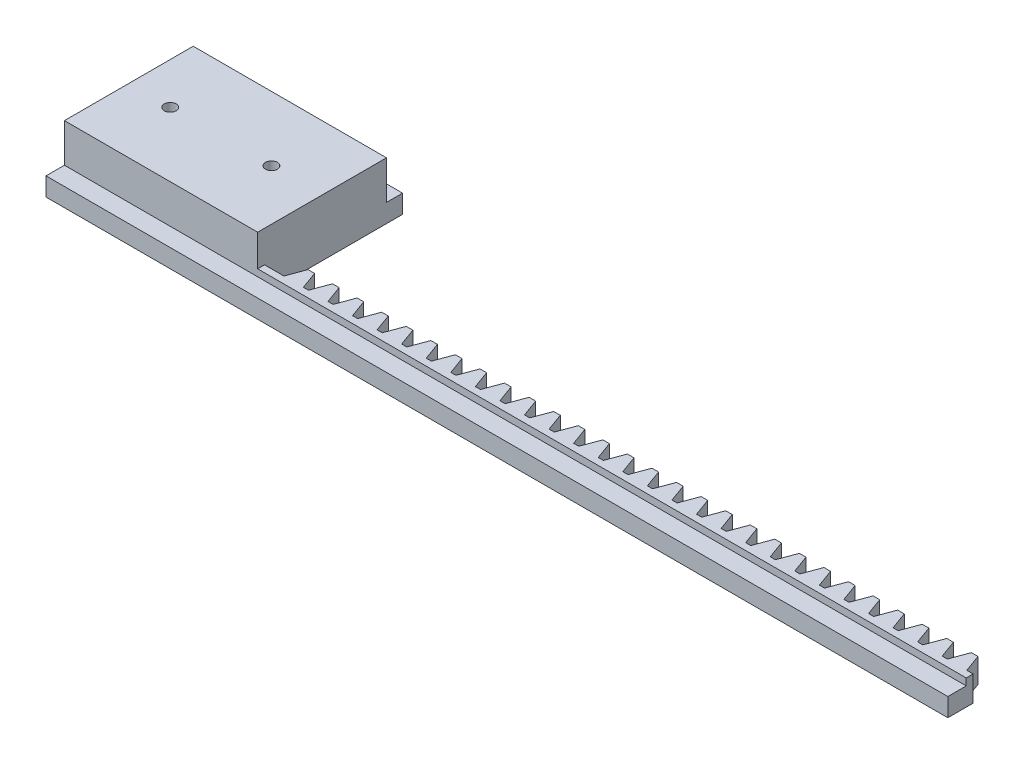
ISO-10303-21;
HEADER;
FILE_DESCRIPTION(('STEP AP214'),'2;1');
FILE_NAME('part.step','',(''),(''),'','','');
FILE_SCHEMA(('AUTOMOTIVE_DESIGN { 1 0 10303 214 1 1 1 1 }'));
ENDSEC;
DATA;
#1=APPLICATION_CONTEXT('core data for automotive mechanical design processes');
#2=APPLICATION_PROTOCOL_DEFINITION('international standard','automotive_design',2000,#1);
#3=PRODUCT_CONTEXT('',#1,'mechanical');
#4=PRODUCT('Part','Part','',(#3));
#5=PRODUCT_RELATED_PRODUCT_CATEGORY('part','',(#4));
#6=PRODUCT_DEFINITION_FORMATION('','',#4);
#7=PRODUCT_DEFINITION_CONTEXT('part definition',#1,'design');
#8=PRODUCT_DEFINITION('design','',#6,#7);
#9=PRODUCT_DEFINITION_SHAPE('','',#8);
#10=(LENGTH_UNIT() NAMED_UNIT(*) SI_UNIT(.MILLI.,.METRE.));
#11=(NAMED_UNIT(*) PLANE_ANGLE_UNIT() SI_UNIT($,.RADIAN.));
#12=(NAMED_UNIT(*) SI_UNIT($,.STERADIAN.) SOLID_ANGLE_UNIT());
#13=UNCERTAINTY_MEASURE_WITH_UNIT(LENGTH_MEASURE(1.E-05),#10,'distance_accuracy_value','');
#14=(GEOMETRIC_REPRESENTATION_CONTEXT(3) GLOBAL_UNCERTAINTY_ASSIGNED_CONTEXT((#13)) GLOBAL_UNIT_ASSIGNED_CONTEXT((#10,
#11,#12)) REPRESENTATION_CONTEXT('',''));
#15=CARTESIAN_POINT('',(0.,0.,0.));
#16=DIRECTION('',(0.,0.,1.));
#17=DIRECTION('',(1.,0.,0.));
#18=AXIS2_PLACEMENT_3D('',#15,#16,#17);
#19=CARTESIAN_POINT('',(17.9487493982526,1.14,3.625));
#20=DIRECTION('',(0.,1.,0.));
#21=DIRECTION('',(0.,0.,1.));
#22=AXIS2_PLACEMENT_3D('',#19,#20,#21);
#23=PLANE('',#22);
#24=DIRECTION('',(0.,0.,-1.));
#25=VECTOR('',#24,1.);
#26=CARTESIAN_POINT('',(-24.0512506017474,1.14,7.625));
#27=LINE('',#26,#25);
#28=CARTESIAN_POINT('',(-24.0512506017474,1.14,-24.375));
#29=VERTEX_POINT('',#28);
#30=CARTESIAN_POINT('',(-24.0512506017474,1.14,-27.875));
#31=VERTEX_POINT('',#30);
#32=EDGE_CURVE('E830',#29,#31,#27,.T.);
#33=ORIENTED_EDGE('',*,*,#32,.F.);
#34=DIRECTION('',(-1.,0.,0.));
#35=VECTOR('',#34,1.);
#36=CARTESIAN_POINT('',(17.9487493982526,1.14,-24.375));
#37=LINE('',#36,#35);
#38=CARTESIAN_POINT('',(17.9487493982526,1.14,-24.375));
#39=VERTEX_POINT('',#38);
#40=EDGE_CURVE('E814',#39,#29,#37,.T.);
#41=ORIENTED_EDGE('',*,*,#40,.F.);
#42=DIRECTION('',(0.,0.,1.));
#43=VECTOR('',#42,1.);
#44=CARTESIAN_POINT('',(17.9487493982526,1.14,7.625));
#45=LINE('',#44,#43);
#46=CARTESIAN_POINT('',(17.9487493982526,1.14,-27.875));
#47=VERTEX_POINT('',#46);
#48=EDGE_CURVE('E819',#47,#39,#45,.T.);
#49=ORIENTED_EDGE('',*,*,#48,.F.);
#50=DIRECTION('',(1.,0.,0.));
#51=VECTOR('',#50,1.);
#52=CARTESIAN_POINT('',(17.9487493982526,1.14,-27.875));
#53=LINE('',#52,#51);
#54=EDGE_CURVE('E835',#31,#47,#53,.T.);
#55=ORIENTED_EDGE('',*,*,#54,.F.);
#56=EDGE_LOOP('',(#33,#41,#49,#55));
#57=FACE_BOUND('',#56,.T.);
#58=ADVANCED_FACE('F44',(#57),#23,.T.);
#59=DIRECTION('',(1.,0.,0.));
#60=VECTOR('',#59,1.);
#61=CARTESIAN_POINT('',(17.9487493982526,1.14,3.625));
#62=LINE('',#61,#60);
#63=CARTESIAN_POINT('',(-24.0512506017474,1.14,3.625));
#64=VERTEX_POINT('',#63);
#65=CARTESIAN_POINT('',(171.948749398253,1.14,3.625));
#66=VERTEX_POINT('',#65);
#67=EDGE_CURVE('E854',#64,#66,#62,.T.);
#68=ORIENTED_EDGE('',*,*,#67,.F.);
#69=CARTESIAN_POINT('',(-24.0512506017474,1.14,7.625));
#70=VERTEX_POINT('',#69);
#71=EDGE_CURVE('E832',#70,#64,#27,.T.);
#72=ORIENTED_EDGE('',*,*,#71,.F.);
#73=DIRECTION('',(1.,0.,0.));
#74=VECTOR('',#73,1.);
#75=CARTESIAN_POINT('',(17.9487493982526,1.14,7.625));
#76=LINE('',#75,#74);
#77=CARTESIAN_POINT('',(171.948749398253,1.14,7.625));
#78=VERTEX_POINT('',#77);
#79=EDGE_CURVE('E853',#70,#78,#76,.T.);
#80=ORIENTED_EDGE('',*,*,#79,.T.);
#81=DIRECTION('',(0.,0.,1.));
#82=VECTOR('',#81,1.);
#83=CARTESIAN_POINT('',(171.948749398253,1.14,3.625));
#84=LINE('',#83,#82);
#85=EDGE_CURVE('E68',#66,#78,#84,.T.);
#86=ORIENTED_EDGE('',*,*,#85,.F.);
#87=EDGE_LOOP('',(#68,#72,#80,#86));
#88=FACE_BOUND('',#87,.T.);
#89=ADVANCED_FACE('F1747',(#88),#23,.T.);
#90=CARTESIAN_POINT('',(0.,-2.64,0.));
#91=DIRECTION('',(0.,1.,0.));
#92=DIRECTION('',(0.,0.,1.));
#93=AXIS2_PLACEMENT_3D('',#90,#91,#92);
#94=PLANE('',#93);
#95=DIRECTION('',(1.,0.,0.));
#96=VECTOR('',#95,1.);
#97=CARTESIAN_POINT('',(0.,-2.64,2.125));
#98=LINE('',#97,#96);
#99=CARTESIAN_POINT('',(22.1615565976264,-2.64,2.125));
#100=VERTEX_POINT('',#99);
#101=CARTESIAN_POINT('',(26.3921861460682,-2.64,2.125));
#102=VERTEX_POINT('',#101);
#103=EDGE_CURVE('E11',#100,#102,#98,.T.);
#104=ORIENTED_EDGE('',*,*,#103,.F.);
#105=DIRECTION('',(-0.344999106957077,0.,0.938603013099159));
#106=VECTOR('',#105,1.);
#107=CARTESIAN_POINT('',(20.2119025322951,-2.64,7.42922004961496));
#108=LINE('',#107,#106);
#109=CARTESIAN_POINT('',(23.5674987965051,-2.64,-1.7));
#110=VERTEX_POINT('',#109);
#111=EDGE_CURVE('E870',#110,#100,#108,.T.);
#112=ORIENTED_EDGE('',*,*,#111,.F.);
#113=DIRECTION('',(1.,0.,0.));
#114=VECTOR('',#113,1.);
#115=CARTESIAN_POINT('',(0.,-2.64,-1.7));
#116=LINE('',#115,#114);
#117=CARTESIAN_POINT('',(25.,-2.64,-1.7));
#118=VERTEX_POINT('',#117);
#119=EDGE_CURVE('E1376',#110,#118,#116,.T.);
#120=ORIENTED_EDGE('',*,*,#119,.T.);
#121=DIRECTION('',(0.34202014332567,0.,0.939692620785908));
#122=VECTOR('',#121,1.);
#123=CARTESIAN_POINT('',(22.6219250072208,-2.64,-8.23370734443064));
#124=LINE('',#123,#122);
#125=EDGE_CURVE('E1373',#118,#102,#124,.T.);
#126=ORIENTED_EDGE('',*,*,#125,.T.);
#127=EDGE_LOOP('',(#104,#112,#120,#126));
#128=FACE_BOUND('',#127,.T.);
#129=ADVANCED_FACE('F1730',(#128),#94,.F.);
#130=CARTESIAN_POINT('',(27.5015565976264,-2.64,2.125));
#131=VERTEX_POINT('',#130);
#132=CARTESIAN_POINT('',(31.7321861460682,-2.64,2.125));
#133=VERTEX_POINT('',#132);
#134=EDGE_CURVE('E53',#131,#133,#98,.T.);
#135=ORIENTED_EDGE('',*,*,#134,.F.);
#136=DIRECTION('',(-0.344999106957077,0.,0.938603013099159));
#137=VECTOR('',#136,1.);
#138=CARTESIAN_POINT('',(24.9163123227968,-2.64,9.1584039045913));
#139=LINE('',#138,#137);
#140=CARTESIAN_POINT('',(28.9074987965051,-2.64,-1.7));
#141=VERTEX_POINT('',#140);
#142=EDGE_CURVE('E1370',#141,#131,#139,.T.);
#143=ORIENTED_EDGE('',*,*,#142,.F.);
#144=DIRECTION('',(1.,0.,0.));
#145=VECTOR('',#144,1.);
#146=CARTESIAN_POINT('',(0.,-2.64,-1.7));
#147=LINE('',#146,#145);
#148=CARTESIAN_POINT('',(30.34,-2.64,-1.7));
#149=VERTEX_POINT('',#148);
#150=EDGE_CURVE('E1367',#141,#149,#147,.T.);
#151=ORIENTED_EDGE('',*,*,#150,.T.);
#152=DIRECTION('',(0.342020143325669,0.,0.939692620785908));
#153=VECTOR('',#152,1.);
#154=CARTESIAN_POINT('',(27.3372636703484,-2.64,-9.94995026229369));
#155=LINE('',#154,#153);
#156=EDGE_CURVE('E1364',#149,#133,#155,.T.);
#157=ORIENTED_EDGE('',*,*,#156,.T.);
#158=EDGE_LOOP('',(#135,#143,#151,#157));
#159=FACE_BOUND('',#158,.T.);
#160=ADVANCED_FACE('F1703',(#159),#94,.F.);
#161=CARTESIAN_POINT('',(32.8415565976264,-2.64,2.125));
#162=VERTEX_POINT('',#161);
#163=CARTESIAN_POINT('',(37.0721861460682,-2.64,2.125));
#164=VERTEX_POINT('',#163);
#165=EDGE_CURVE('E1691',#162,#164,#98,.T.);
#166=ORIENTED_EDGE('',*,*,#165,.F.);
#167=DIRECTION('',(-0.344999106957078,0.,0.938603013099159));
#168=VECTOR('',#167,1.);
#169=CARTESIAN_POINT('',(29.6207221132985,-2.64,10.8875877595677));
#170=LINE('',#169,#168);
#171=CARTESIAN_POINT('',(34.2474987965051,-2.64,-1.7));
#172=VERTEX_POINT('',#171);
#173=EDGE_CURVE('E1361',#172,#162,#170,.T.);
#174=ORIENTED_EDGE('',*,*,#173,.F.);
#175=DIRECTION('',(1.,0.,0.));
#176=VECTOR('',#175,1.);
#177=CARTESIAN_POINT('',(0.,-2.64,-1.7));
#178=LINE('',#177,#176);
#179=CARTESIAN_POINT('',(35.68,-2.64,-1.7));
#180=VERTEX_POINT('',#179);
#181=EDGE_CURVE('E1358',#172,#180,#178,.T.);
#182=ORIENTED_EDGE('',*,*,#181,.T.);
#183=DIRECTION('',(0.34202014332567,0.,0.939692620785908));
#184=VECTOR('',#183,1.);
#185=CARTESIAN_POINT('',(32.0526023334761,-2.64,-11.6661931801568));
#186=LINE('',#185,#184);
#187=EDGE_CURVE('E1355',#180,#164,#186,.T.);
#188=ORIENTED_EDGE('',*,*,#187,.T.);
#189=EDGE_LOOP('',(#166,#174,#182,#188));
#190=FACE_BOUND('',#189,.T.);
#191=ADVANCED_FACE('F1943',(#190),#94,.F.);
#192=CARTESIAN_POINT('',(38.1815565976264,-2.64,2.125));
#193=VERTEX_POINT('',#192);
#194=CARTESIAN_POINT('',(42.4121861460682,-2.64,2.125));
#195=VERTEX_POINT('',#194);
#196=EDGE_CURVE('E1690',#193,#195,#98,.T.);
#197=ORIENTED_EDGE('',*,*,#196,.F.);
#198=DIRECTION('',(-0.344999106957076,0.,0.938603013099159));
#199=VECTOR('',#198,1.);
#200=CARTESIAN_POINT('',(34.3251319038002,-2.64,12.616771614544));
#201=LINE('',#200,#199);
#202=CARTESIAN_POINT('',(39.5874987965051,-2.64,-1.7));
#203=VERTEX_POINT('',#202);
#204=EDGE_CURVE('E1352',#203,#193,#201,.T.);
#205=ORIENTED_EDGE('',*,*,#204,.F.);
#206=DIRECTION('',(1.,0.,0.));
#207=VECTOR('',#206,1.);
#208=CARTESIAN_POINT('',(0.,-2.64,-1.7));
#209=LINE('',#208,#207);
#210=CARTESIAN_POINT('',(41.02,-2.64,-1.7));
#211=VERTEX_POINT('',#210);
#212=EDGE_CURVE('E1349',#203,#211,#209,.T.);
#213=ORIENTED_EDGE('',*,*,#212,.T.);
#214=DIRECTION('',(0.34202014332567,0.,0.939692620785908));
#215=VECTOR('',#214,1.);
#216=CARTESIAN_POINT('',(36.7679409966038,-2.64,-13.3824360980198));
#217=LINE('',#216,#215);
#218=EDGE_CURVE('E1346',#211,#195,#217,.T.);
#219=ORIENTED_EDGE('',*,*,#218,.T.);
#220=EDGE_LOOP('',(#197,#205,#213,#219));
#221=FACE_BOUND('',#220,.T.);
#222=ADVANCED_FACE('F1954',(#221),#94,.F.);
#223=CARTESIAN_POINT('',(43.5215565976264,-2.64,2.125));
#224=VERTEX_POINT('',#223);
#225=CARTESIAN_POINT('',(47.7521861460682,-2.64,2.125));
#226=VERTEX_POINT('',#225);
#227=EDGE_CURVE('E1689',#224,#226,#98,.T.);
#228=ORIENTED_EDGE('',*,*,#227,.F.);
#229=DIRECTION('',(-0.344999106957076,0.,0.938603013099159));
#230=VECTOR('',#229,1.);
#231=CARTESIAN_POINT('',(39.0295416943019,-2.64,14.3459554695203));
#232=LINE('',#231,#230);
#233=CARTESIAN_POINT('',(44.9274987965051,-2.64,-1.7));
#234=VERTEX_POINT('',#233);
#235=EDGE_CURVE('E1343',#234,#224,#232,.T.);
#236=ORIENTED_EDGE('',*,*,#235,.F.);
#237=DIRECTION('',(1.,0.,0.));
#238=VECTOR('',#237,1.);
#239=CARTESIAN_POINT('',(0.,-2.64,-1.7));
#240=LINE('',#239,#238);
#241=CARTESIAN_POINT('',(46.36,-2.64,-1.7));
#242=VERTEX_POINT('',#241);
#243=EDGE_CURVE('E1340',#234,#242,#240,.T.);
#244=ORIENTED_EDGE('',*,*,#243,.T.);
#245=DIRECTION('',(0.34202014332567,0.,0.939692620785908));
#246=VECTOR('',#245,1.);
#247=CARTESIAN_POINT('',(41.4832796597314,-2.64,-15.0986790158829));
#248=LINE('',#247,#246);
#249=EDGE_CURVE('E1337',#242,#226,#248,.T.);
#250=ORIENTED_EDGE('',*,*,#249,.T.);
#251=EDGE_LOOP('',(#228,#236,#244,#250));
#252=FACE_BOUND('',#251,.T.);
#253=ADVANCED_FACE('F1966',(#252),#94,.F.);
#254=CARTESIAN_POINT('',(48.8615565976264,-2.64,2.125));
#255=VERTEX_POINT('',#254);
#256=CARTESIAN_POINT('',(53.0921861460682,-2.64,2.125));
#257=VERTEX_POINT('',#256);
#258=EDGE_CURVE('E1688',#255,#257,#98,.T.);
#259=ORIENTED_EDGE('',*,*,#258,.F.);
#260=DIRECTION('',(-0.344999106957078,0.,0.938603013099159));
#261=VECTOR('',#260,1.);
#262=CARTESIAN_POINT('',(43.7339514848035,-2.64,16.0751393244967));
#263=LINE('',#262,#261);
#264=CARTESIAN_POINT('',(50.2674987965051,-2.64,-1.7));
#265=VERTEX_POINT('',#264);
#266=EDGE_CURVE('E1334',#265,#255,#263,.T.);
#267=ORIENTED_EDGE('',*,*,#266,.F.);
#268=DIRECTION('',(1.,0.,0.));
#269=VECTOR('',#268,1.);
#270=CARTESIAN_POINT('',(0.,-2.64,-1.7));
#271=LINE('',#270,#269);
#272=CARTESIAN_POINT('',(51.7,-2.64,-1.7));
#273=VERTEX_POINT('',#272);
#274=EDGE_CURVE('E1331',#265,#273,#271,.T.);
#275=ORIENTED_EDGE('',*,*,#274,.T.);
#276=DIRECTION('',(0.34202014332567,0.,0.939692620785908));
#277=VECTOR('',#276,1.);
#278=CARTESIAN_POINT('',(46.1986183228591,-2.64,-16.814921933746));
#279=LINE('',#278,#277);
#280=EDGE_CURVE('E1328',#273,#257,#279,.T.);
#281=ORIENTED_EDGE('',*,*,#280,.T.);
#282=EDGE_LOOP('',(#259,#267,#275,#281));
#283=FACE_BOUND('',#282,.T.);
#284=ADVANCED_FACE('F1978',(#283),#94,.F.);
#285=CARTESIAN_POINT('',(54.2015565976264,-2.64,2.125));
#286=VERTEX_POINT('',#285);
#287=CARTESIAN_POINT('',(58.4321861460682,-2.64,2.125));
#288=VERTEX_POINT('',#287);
#289=EDGE_CURVE('E1687',#286,#288,#98,.T.);
#290=ORIENTED_EDGE('',*,*,#289,.F.);
#291=DIRECTION('',(-0.344999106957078,0.,0.938603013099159));
#292=VECTOR('',#291,1.);
#293=CARTESIAN_POINT('',(48.4383612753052,-2.64,17.804323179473));
#294=LINE('',#293,#292);
#295=CARTESIAN_POINT('',(55.6074987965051,-2.64,-1.7));
#296=VERTEX_POINT('',#295);
#297=EDGE_CURVE('E1325',#296,#286,#294,.T.);
#298=ORIENTED_EDGE('',*,*,#297,.F.);
#299=DIRECTION('',(1.,0.,0.));
#300=VECTOR('',#299,1.);
#301=CARTESIAN_POINT('',(0.,-2.64,-1.7));
#302=LINE('',#301,#300);
#303=CARTESIAN_POINT('',(57.04,-2.64,-1.7));
#304=VERTEX_POINT('',#303);
#305=EDGE_CURVE('E1322',#296,#304,#302,.T.);
#306=ORIENTED_EDGE('',*,*,#305,.T.);
#307=DIRECTION('',(0.34202014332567,0.,0.939692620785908));
#308=VECTOR('',#307,1.);
#309=CARTESIAN_POINT('',(50.9139569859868,-2.64,-18.531164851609));
#310=LINE('',#309,#308);
#311=EDGE_CURVE('E1319',#304,#288,#310,.T.);
#312=ORIENTED_EDGE('',*,*,#311,.T.);
#313=EDGE_LOOP('',(#290,#298,#306,#312));
#314=FACE_BOUND('',#313,.T.);
#315=ADVANCED_FACE('F1990',(#314),#94,.F.);
#316=CARTESIAN_POINT('',(59.5415565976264,-2.64,2.125));
#317=VERTEX_POINT('',#316);
#318=CARTESIAN_POINT('',(63.7721861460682,-2.64,2.125));
#319=VERTEX_POINT('',#318);
#320=EDGE_CURVE('E1686',#317,#319,#98,.T.);
#321=ORIENTED_EDGE('',*,*,#320,.F.);
#322=DIRECTION('',(-0.344999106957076,0.,0.938603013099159));
#323=VECTOR('',#322,1.);
#324=CARTESIAN_POINT('',(53.142771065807,-2.64,19.5335070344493));
#325=LINE('',#324,#323);
#326=CARTESIAN_POINT('',(60.9474987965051,-2.64,-1.7));
#327=VERTEX_POINT('',#326);
#328=EDGE_CURVE('E1316',#327,#317,#325,.T.);
#329=ORIENTED_EDGE('',*,*,#328,.F.);
#330=DIRECTION('',(1.,0.,0.));
#331=VECTOR('',#330,1.);
#332=CARTESIAN_POINT('',(0.,-2.64,-1.7));
#333=LINE('',#332,#331);
#334=CARTESIAN_POINT('',(62.38,-2.64,-1.7));
#335=VERTEX_POINT('',#334);
#336=EDGE_CURVE('E1313',#327,#335,#333,.T.);
#337=ORIENTED_EDGE('',*,*,#336,.T.);
#338=DIRECTION('',(0.34202014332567,0.,0.939692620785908));
#339=VECTOR('',#338,1.);
#340=CARTESIAN_POINT('',(55.6292956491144,-2.64,-20.2474077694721));
#341=LINE('',#340,#339);
#342=EDGE_CURVE('E1310',#335,#319,#341,.T.);
#343=ORIENTED_EDGE('',*,*,#342,.T.);
#344=EDGE_LOOP('',(#321,#329,#337,#343));
#345=FACE_BOUND('',#344,.T.);
#346=ADVANCED_FACE('F2002',(#345),#94,.F.);
#347=CARTESIAN_POINT('',(64.8815565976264,-2.64,2.125));
#348=VERTEX_POINT('',#347);
#349=CARTESIAN_POINT('',(69.1121861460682,-2.64,2.125));
#350=VERTEX_POINT('',#349);
#351=EDGE_CURVE('E1685',#348,#350,#98,.T.);
#352=ORIENTED_EDGE('',*,*,#351,.F.);
#353=DIRECTION('',(-0.344999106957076,0.,0.938603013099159));
#354=VECTOR('',#353,1.);
#355=CARTESIAN_POINT('',(57.8471808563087,-2.64,21.2626908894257));
#356=LINE('',#355,#354);
#357=CARTESIAN_POINT('',(66.2874987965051,-2.64,-1.7));
#358=VERTEX_POINT('',#357);
#359=EDGE_CURVE('E1307',#358,#348,#356,.T.);
#360=ORIENTED_EDGE('',*,*,#359,.F.);
#361=DIRECTION('',(1.,0.,0.));
#362=VECTOR('',#361,1.);
#363=CARTESIAN_POINT('',(0.,-2.64,-1.7));
#364=LINE('',#363,#362);
#365=CARTESIAN_POINT('',(67.72,-2.64,-1.7));
#366=VERTEX_POINT('',#365);
#367=EDGE_CURVE('E1304',#358,#366,#364,.T.);
#368=ORIENTED_EDGE('',*,*,#367,.T.);
#369=DIRECTION('',(0.34202014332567,0.,0.939692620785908));
#370=VECTOR('',#369,1.);
#371=CARTESIAN_POINT('',(60.3446343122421,-2.64,-21.9636506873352));
#372=LINE('',#371,#370);
#373=EDGE_CURVE('E1301',#366,#350,#372,.T.);
#374=ORIENTED_EDGE('',*,*,#373,.T.);
#375=EDGE_LOOP('',(#352,#360,#368,#374));
#376=FACE_BOUND('',#375,.T.);
#377=ADVANCED_FACE('F2014',(#376),#94,.F.);
#378=CARTESIAN_POINT('',(70.2215565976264,-2.64,2.125));
#379=VERTEX_POINT('',#378);
#380=CARTESIAN_POINT('',(74.4521861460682,-2.64,2.125));
#381=VERTEX_POINT('',#380);
#382=EDGE_CURVE('E1684',#379,#381,#98,.T.);
#383=ORIENTED_EDGE('',*,*,#382,.F.);
#384=DIRECTION('',(-0.344999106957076,0.,0.938603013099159));
#385=VECTOR('',#384,1.);
#386=CARTESIAN_POINT('',(62.5515906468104,-2.64,22.991874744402));
#387=LINE('',#386,#385);
#388=CARTESIAN_POINT('',(71.6274987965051,-2.64,-1.7));
#389=VERTEX_POINT('',#388);
#390=EDGE_CURVE('E1298',#389,#379,#387,.T.);
#391=ORIENTED_EDGE('',*,*,#390,.F.);
#392=DIRECTION('',(1.,0.,0.));
#393=VECTOR('',#392,1.);
#394=CARTESIAN_POINT('',(0.,-2.64,-1.7));
#395=LINE('',#394,#393);
#396=CARTESIAN_POINT('',(73.06,-2.64,-1.7));
#397=VERTEX_POINT('',#396);
#398=EDGE_CURVE('E1295',#389,#397,#395,.T.);
#399=ORIENTED_EDGE('',*,*,#398,.T.);
#400=DIRECTION('',(0.34202014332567,0.,0.939692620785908));
#401=VECTOR('',#400,1.);
#402=CARTESIAN_POINT('',(65.0599729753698,-2.64,-23.6798936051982));
#403=LINE('',#402,#401);
#404=EDGE_CURVE('E1292',#397,#381,#403,.T.);
#405=ORIENTED_EDGE('',*,*,#404,.T.);
#406=EDGE_LOOP('',(#383,#391,#399,#405));
#407=FACE_BOUND('',#406,.T.);
#408=ADVANCED_FACE('F2026',(#407),#94,.F.);
#409=CARTESIAN_POINT('',(75.5615565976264,-2.64,2.125));
#410=VERTEX_POINT('',#409);
#411=CARTESIAN_POINT('',(79.7921861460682,-2.64,2.125));
#412=VERTEX_POINT('',#411);
#413=EDGE_CURVE('E1683',#410,#412,#98,.T.);
#414=ORIENTED_EDGE('',*,*,#413,.F.);
#415=DIRECTION('',(-0.344999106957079,0.,0.938603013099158));
#416=VECTOR('',#415,1.);
#417=CARTESIAN_POINT('',(67.2560004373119,-2.64,24.7210585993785));
#418=LINE('',#417,#416);
#419=CARTESIAN_POINT('',(76.9674987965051,-2.64,-1.7));
#420=VERTEX_POINT('',#419);
#421=EDGE_CURVE('E1289',#420,#410,#418,.T.);
#422=ORIENTED_EDGE('',*,*,#421,.F.);
#423=DIRECTION('',(1.,0.,0.));
#424=VECTOR('',#423,1.);
#425=CARTESIAN_POINT('',(0.,-2.64,-1.7));
#426=LINE('',#425,#424);
#427=CARTESIAN_POINT('',(78.4,-2.64,-1.7));
#428=VERTEX_POINT('',#427);
#429=EDGE_CURVE('E1286',#420,#428,#426,.T.);
#430=ORIENTED_EDGE('',*,*,#429,.T.);
#431=DIRECTION('',(0.34202014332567,0.,0.939692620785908));
#432=VECTOR('',#431,1.);
#433=CARTESIAN_POINT('',(69.7753116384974,-2.64,-25.3961365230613));
#434=LINE('',#433,#432);
#435=EDGE_CURVE('E1283',#428,#412,#434,.T.);
#436=ORIENTED_EDGE('',*,*,#435,.T.);
#437=EDGE_LOOP('',(#414,#422,#430,#436));
#438=FACE_BOUND('',#437,.T.);
#439=ADVANCED_FACE('F2038',(#438),#94,.F.);
#440=CARTESIAN_POINT('',(80.9015565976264,-2.64,2.125));
#441=VERTEX_POINT('',#440);
#442=CARTESIAN_POINT('',(85.1321861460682,-2.64,2.125));
#443=VERTEX_POINT('',#442);
#444=EDGE_CURVE('E1682',#441,#443,#98,.T.);
#445=ORIENTED_EDGE('',*,*,#444,.F.);
#446=DIRECTION('',(-0.344999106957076,0.,0.938603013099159));
#447=VECTOR('',#446,1.);
#448=CARTESIAN_POINT('',(71.9604102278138,-2.64,26.4502424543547));
#449=LINE('',#448,#447);
#450=CARTESIAN_POINT('',(82.3074987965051,-2.64,-1.7));
#451=VERTEX_POINT('',#450);
#452=EDGE_CURVE('E1280',#451,#441,#449,.T.);
#453=ORIENTED_EDGE('',*,*,#452,.F.);
#454=DIRECTION('',(1.,0.,0.));
#455=VECTOR('',#454,1.);
#456=CARTESIAN_POINT('',(0.,-2.64,-1.7));
#457=LINE('',#456,#455);
#458=CARTESIAN_POINT('',(83.74,-2.64,-1.7));
#459=VERTEX_POINT('',#458);
#460=EDGE_CURVE('E1277',#451,#459,#457,.T.);
#461=ORIENTED_EDGE('',*,*,#460,.T.);
#462=DIRECTION('',(0.34202014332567,0.,0.939692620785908));
#463=VECTOR('',#462,1.);
#464=CARTESIAN_POINT('',(74.4906503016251,-2.64,-27.1123794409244));
#465=LINE('',#464,#463);
#466=EDGE_CURVE('E1274',#459,#443,#465,.T.);
#467=ORIENTED_EDGE('',*,*,#466,.T.);
#468=EDGE_LOOP('',(#445,#453,#461,#467));
#469=FACE_BOUND('',#468,.T.);
#470=ADVANCED_FACE('F2050',(#469),#94,.F.);
#471=CARTESIAN_POINT('',(86.2415565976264,-2.64,2.125));
#472=VERTEX_POINT('',#471);
#473=CARTESIAN_POINT('',(90.4721861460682,-2.64,2.125));
#474=VERTEX_POINT('',#473);
#475=EDGE_CURVE('E1681',#472,#474,#98,.T.);
#476=ORIENTED_EDGE('',*,*,#475,.F.);
#477=DIRECTION('',(-0.344999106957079,0.,0.938603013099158));
#478=VECTOR('',#477,1.);
#479=CARTESIAN_POINT('',(76.6648200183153,-2.64,28.1794263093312));
#480=LINE('',#479,#478);
#481=CARTESIAN_POINT('',(87.6474987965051,-2.64,-1.7));
#482=VERTEX_POINT('',#481);
#483=EDGE_CURVE('E1271',#482,#472,#480,.T.);
#484=ORIENTED_EDGE('',*,*,#483,.F.);
#485=DIRECTION('',(1.,0.,0.));
#486=VECTOR('',#485,1.);
#487=CARTESIAN_POINT('',(0.,-2.64,-1.7));
#488=LINE('',#487,#486);
#489=CARTESIAN_POINT('',(89.08,-2.64,-1.7));
#490=VERTEX_POINT('',#489);
#491=EDGE_CURVE('E1268',#482,#490,#488,.T.);
#492=ORIENTED_EDGE('',*,*,#491,.T.);
#493=DIRECTION('',(0.34202014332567,0.,0.939692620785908));
#494=VECTOR('',#493,1.);
#495=CARTESIAN_POINT('',(79.2059889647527,-2.64,-28.8286223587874));
#496=LINE('',#495,#494);
#497=EDGE_CURVE('E1265',#490,#474,#496,.T.);
#498=ORIENTED_EDGE('',*,*,#497,.T.);
#499=EDGE_LOOP('',(#476,#484,#492,#498));
#500=FACE_BOUND('',#499,.T.);
#501=ADVANCED_FACE('F2062',(#500),#94,.F.);
#502=CARTESIAN_POINT('',(91.5815565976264,-2.64,2.125));
#503=VERTEX_POINT('',#502);
#504=CARTESIAN_POINT('',(95.8121861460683,-2.64,2.125));
#505=VERTEX_POINT('',#504);
#506=EDGE_CURVE('E1680',#503,#505,#98,.T.);
#507=ORIENTED_EDGE('',*,*,#506,.F.);
#508=DIRECTION('',(-0.344999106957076,0.,0.938603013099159));
#509=VECTOR('',#508,1.);
#510=CARTESIAN_POINT('',(81.3692298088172,-2.64,29.9086101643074));
#511=LINE('',#510,#509);
#512=CARTESIAN_POINT('',(92.9874987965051,-2.64,-1.7));
#513=VERTEX_POINT('',#512);
#514=EDGE_CURVE('E1262',#513,#503,#511,.T.);
#515=ORIENTED_EDGE('',*,*,#514,.F.);
#516=DIRECTION('',(1.,0.,0.));
#517=VECTOR('',#516,1.);
#518=CARTESIAN_POINT('',(0.,-2.64,-1.7));
#519=LINE('',#518,#517);
#520=CARTESIAN_POINT('',(94.42,-2.64,-1.7));
#521=VERTEX_POINT('',#520);
#522=EDGE_CURVE('E1259',#513,#521,#519,.T.);
#523=ORIENTED_EDGE('',*,*,#522,.T.);
#524=DIRECTION('',(0.34202014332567,0.,0.939692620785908));
#525=VECTOR('',#524,1.);
#526=CARTESIAN_POINT('',(83.9213276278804,-2.64,-30.5448652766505));
#527=LINE('',#526,#525);
#528=EDGE_CURVE('E1256',#521,#505,#527,.T.);
#529=ORIENTED_EDGE('',*,*,#528,.T.);
#530=EDGE_LOOP('',(#507,#515,#523,#529));
#531=FACE_BOUND('',#530,.T.);
#532=ADVANCED_FACE('F2074',(#531),#94,.F.);
#533=CARTESIAN_POINT('',(96.9215565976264,-2.64,2.125));
#534=VERTEX_POINT('',#533);
#535=CARTESIAN_POINT('',(101.152186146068,-2.64,2.125));
#536=VERTEX_POINT('',#535);
#537=EDGE_CURVE('E1679',#534,#536,#98,.T.);
#538=ORIENTED_EDGE('',*,*,#537,.F.);
#539=DIRECTION('',(-0.344999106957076,0.,0.938603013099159));
#540=VECTOR('',#539,1.);
#541=CARTESIAN_POINT('',(86.0736395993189,-2.64,31.6377940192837));
#542=LINE('',#541,#540);
#543=CARTESIAN_POINT('',(98.3274987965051,-2.64,-1.7));
#544=VERTEX_POINT('',#543);
#545=EDGE_CURVE('E1253',#544,#534,#542,.T.);
#546=ORIENTED_EDGE('',*,*,#545,.F.);
#547=DIRECTION('',(1.,0.,0.));
#548=VECTOR('',#547,1.);
#549=CARTESIAN_POINT('',(0.,-2.64,-1.7));
#550=LINE('',#549,#548);
#551=CARTESIAN_POINT('',(99.76,-2.64,-1.7));
#552=VERTEX_POINT('',#551);
#553=EDGE_CURVE('E1250',#544,#552,#550,.T.);
#554=ORIENTED_EDGE('',*,*,#553,.T.);
#555=DIRECTION('',(0.34202014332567,0.,0.939692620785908));
#556=VECTOR('',#555,1.);
#557=CARTESIAN_POINT('',(88.6366662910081,-2.64,-32.2611081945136));
#558=LINE('',#557,#556);
#559=EDGE_CURVE('E1247',#552,#536,#558,.T.);
#560=ORIENTED_EDGE('',*,*,#559,.T.);
#561=EDGE_LOOP('',(#538,#546,#554,#560));
#562=FACE_BOUND('',#561,.T.);
#563=ADVANCED_FACE('F2086',(#562),#94,.F.);
#564=CARTESIAN_POINT('',(102.261556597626,-2.64,2.125));
#565=VERTEX_POINT('',#564);
#566=CARTESIAN_POINT('',(106.492186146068,-2.64,2.125));
#567=VERTEX_POINT('',#566);
#568=EDGE_CURVE('E1678',#565,#567,#98,.T.);
#569=ORIENTED_EDGE('',*,*,#568,.F.);
#570=DIRECTION('',(-0.344999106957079,0.,0.938603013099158));
#571=VECTOR('',#570,1.);
#572=CARTESIAN_POINT('',(90.7780493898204,-2.64,33.3669778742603));
#573=LINE('',#572,#571);
#574=CARTESIAN_POINT('',(103.667498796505,-2.64,-1.7));
#575=VERTEX_POINT('',#574);
#576=EDGE_CURVE('E1244',#575,#565,#573,.T.);
#577=ORIENTED_EDGE('',*,*,#576,.F.);
#578=DIRECTION('',(1.,0.,0.));
#579=VECTOR('',#578,1.);
#580=CARTESIAN_POINT('',(0.,-2.64,-1.7));
#581=LINE('',#580,#579);
#582=CARTESIAN_POINT('',(105.1,-2.64,-1.7));
#583=VERTEX_POINT('',#582);
#584=EDGE_CURVE('E1241',#575,#583,#581,.T.);
#585=ORIENTED_EDGE('',*,*,#584,.T.);
#586=DIRECTION('',(0.34202014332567,0.,0.939692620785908));
#587=VECTOR('',#586,1.);
#588=CARTESIAN_POINT('',(93.3520049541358,-2.64,-33.9773511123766));
#589=LINE('',#588,#587);
#590=EDGE_CURVE('E1238',#583,#567,#589,.T.);
#591=ORIENTED_EDGE('',*,*,#590,.T.);
#592=EDGE_LOOP('',(#569,#577,#585,#591));
#593=FACE_BOUND('',#592,.T.);
#594=ADVANCED_FACE('F2098',(#593),#94,.F.);
#595=CARTESIAN_POINT('',(107.601556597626,-2.64,2.125));
#596=VERTEX_POINT('',#595);
#597=CARTESIAN_POINT('',(111.832186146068,-2.64,2.125));
#598=VERTEX_POINT('',#597);
#599=EDGE_CURVE('E1677',#596,#598,#98,.T.);
#600=ORIENTED_EDGE('',*,*,#599,.F.);
#601=DIRECTION('',(-0.344999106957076,0.,0.938603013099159));
#602=VECTOR('',#601,1.);
#603=CARTESIAN_POINT('',(95.4824591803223,-2.64,35.0961617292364));
#604=LINE('',#603,#602);
#605=CARTESIAN_POINT('',(109.007498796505,-2.64,-1.7));
#606=VERTEX_POINT('',#605);
#607=EDGE_CURVE('E1235',#606,#596,#604,.T.);
#608=ORIENTED_EDGE('',*,*,#607,.F.);
#609=DIRECTION('',(1.,0.,0.));
#610=VECTOR('',#609,1.);
#611=CARTESIAN_POINT('',(0.,-2.64,-1.7));
#612=LINE('',#611,#610);
#613=CARTESIAN_POINT('',(110.44,-2.64,-1.7));
#614=VERTEX_POINT('',#613);
#615=EDGE_CURVE('E1232',#606,#614,#612,.T.);
#616=ORIENTED_EDGE('',*,*,#615,.T.);
#617=DIRECTION('',(0.34202014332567,0.,0.939692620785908));
#618=VECTOR('',#617,1.);
#619=CARTESIAN_POINT('',(98.0673436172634,-2.64,-35.6935940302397));
#620=LINE('',#619,#618);
#621=EDGE_CURVE('E1229',#614,#598,#620,.T.);
#622=ORIENTED_EDGE('',*,*,#621,.T.);
#623=EDGE_LOOP('',(#600,#608,#616,#622));
#624=FACE_BOUND('',#623,.T.);
#625=ADVANCED_FACE('F2110',(#624),#94,.F.);
#626=CARTESIAN_POINT('',(112.941556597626,-2.64,2.125));
#627=VERTEX_POINT('',#626);
#628=CARTESIAN_POINT('',(117.172186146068,-2.64,2.125));
#629=VERTEX_POINT('',#628);
#630=EDGE_CURVE('E1676',#627,#629,#98,.T.);
#631=ORIENTED_EDGE('',*,*,#630,.F.);
#632=DIRECTION('',(-0.344999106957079,0.,0.938603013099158));
#633=VECTOR('',#632,1.);
#634=CARTESIAN_POINT('',(100.186868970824,-2.64,36.825345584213));
#635=LINE('',#634,#633);
#636=CARTESIAN_POINT('',(114.347498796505,-2.64,-1.7));
#637=VERTEX_POINT('',#636);
#638=EDGE_CURVE('E1226',#637,#627,#635,.T.);
#639=ORIENTED_EDGE('',*,*,#638,.F.);
#640=DIRECTION('',(1.,0.,0.));
#641=VECTOR('',#640,1.);
#642=CARTESIAN_POINT('',(0.,-2.64,-1.7));
#643=LINE('',#642,#641);
#644=CARTESIAN_POINT('',(115.78,-2.64,-1.7));
#645=VERTEX_POINT('',#644);
#646=EDGE_CURVE('E1223',#637,#645,#643,.T.);
#647=ORIENTED_EDGE('',*,*,#646,.T.);
#648=DIRECTION('',(0.34202014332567,0.,0.939692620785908));
#649=VECTOR('',#648,1.);
#650=CARTESIAN_POINT('',(102.782682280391,-2.64,-37.4098369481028));
#651=LINE('',#650,#649);
#652=EDGE_CURVE('E1220',#645,#629,#651,.T.);
#653=ORIENTED_EDGE('',*,*,#652,.T.);
#654=EDGE_LOOP('',(#631,#639,#647,#653));
#655=FACE_BOUND('',#654,.T.);
#656=ADVANCED_FACE('F2122',(#655),#94,.F.);
#657=CARTESIAN_POINT('',(118.281556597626,-2.64,2.125));
#658=VERTEX_POINT('',#657);
#659=CARTESIAN_POINT('',(122.512186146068,-2.64,2.125));
#660=VERTEX_POINT('',#659);
#661=EDGE_CURVE('E1675',#658,#660,#98,.T.);
#662=ORIENTED_EDGE('',*,*,#661,.F.);
#663=DIRECTION('',(-0.344999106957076,0.,0.938603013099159));
#664=VECTOR('',#663,1.);
#665=CARTESIAN_POINT('',(104.891278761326,-2.64,38.5545294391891));
#666=LINE('',#665,#664);
#667=CARTESIAN_POINT('',(119.687498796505,-2.64,-1.7));
#668=VERTEX_POINT('',#667);
#669=EDGE_CURVE('E1217',#668,#658,#666,.T.);
#670=ORIENTED_EDGE('',*,*,#669,.F.);
#671=DIRECTION('',(1.,0.,0.));
#672=VECTOR('',#671,1.);
#673=CARTESIAN_POINT('',(0.,-2.64,-1.7));
#674=LINE('',#673,#672);
#675=CARTESIAN_POINT('',(121.12,-2.64,-1.7));
#676=VERTEX_POINT('',#675);
#677=EDGE_CURVE('E1214',#668,#676,#674,.T.);
#678=ORIENTED_EDGE('',*,*,#677,.T.);
#679=DIRECTION('',(0.34202014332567,0.,0.939692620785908));
#680=VECTOR('',#679,1.);
#681=CARTESIAN_POINT('',(107.498020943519,-2.64,-39.1260798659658));
#682=LINE('',#681,#680);
#683=EDGE_CURVE('E1211',#676,#660,#682,.T.);
#684=ORIENTED_EDGE('',*,*,#683,.T.);
#685=EDGE_LOOP('',(#662,#670,#678,#684));
#686=FACE_BOUND('',#685,.T.);
#687=ADVANCED_FACE('F2134',(#686),#94,.F.);
#688=CARTESIAN_POINT('',(123.621556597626,-2.64,2.125));
#689=VERTEX_POINT('',#688);
#690=CARTESIAN_POINT('',(127.852186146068,-2.64,2.125));
#691=VERTEX_POINT('',#690);
#692=EDGE_CURVE('E1674',#689,#691,#98,.T.);
#693=ORIENTED_EDGE('',*,*,#692,.F.);
#694=DIRECTION('',(-0.344999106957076,0.,0.938603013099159));
#695=VECTOR('',#694,1.);
#696=CARTESIAN_POINT('',(109.595688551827,-2.64,40.2837132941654));
#697=LINE('',#696,#695);
#698=CARTESIAN_POINT('',(125.027498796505,-2.64,-1.7));
#699=VERTEX_POINT('',#698);
#700=EDGE_CURVE('E1208',#699,#689,#697,.T.);
#701=ORIENTED_EDGE('',*,*,#700,.F.);
#702=DIRECTION('',(1.,0.,0.));
#703=VECTOR('',#702,1.);
#704=CARTESIAN_POINT('',(0.,-2.64,-1.7));
#705=LINE('',#704,#703);
#706=CARTESIAN_POINT('',(126.46,-2.64,-1.7));
#707=VERTEX_POINT('',#706);
#708=EDGE_CURVE('E1205',#699,#707,#705,.T.);
#709=ORIENTED_EDGE('',*,*,#708,.T.);
#710=DIRECTION('',(0.34202014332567,0.,0.939692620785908));
#711=VECTOR('',#710,1.);
#712=CARTESIAN_POINT('',(112.213359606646,-2.64,-40.8423227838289));
#713=LINE('',#712,#711);
#714=EDGE_CURVE('E1202',#707,#691,#713,.T.);
#715=ORIENTED_EDGE('',*,*,#714,.T.);
#716=EDGE_LOOP('',(#693,#701,#709,#715));
#717=FACE_BOUND('',#716,.T.);
#718=ADVANCED_FACE('F2146',(#717),#94,.F.);
#719=CARTESIAN_POINT('',(128.961556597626,-2.64,2.125));
#720=VERTEX_POINT('',#719);
#721=CARTESIAN_POINT('',(133.192186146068,-2.64,2.125));
#722=VERTEX_POINT('',#721);
#723=EDGE_CURVE('E1673',#720,#722,#98,.T.);
#724=ORIENTED_EDGE('',*,*,#723,.F.);
#725=DIRECTION('',(-0.344999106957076,0.,0.938603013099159));
#726=VECTOR('',#725,1.);
#727=CARTESIAN_POINT('',(114.300098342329,-2.64,42.0128971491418));
#728=LINE('',#727,#726);
#729=CARTESIAN_POINT('',(130.367498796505,-2.64,-1.7));
#730=VERTEX_POINT('',#729);
#731=EDGE_CURVE('E1199',#730,#720,#728,.T.);
#732=ORIENTED_EDGE('',*,*,#731,.F.);
#733=DIRECTION('',(1.,0.,0.));
#734=VECTOR('',#733,1.);
#735=CARTESIAN_POINT('',(0.,-2.64,-1.7));
#736=LINE('',#735,#734);
#737=CARTESIAN_POINT('',(131.8,-2.64,-1.7));
#738=VERTEX_POINT('',#737);
#739=EDGE_CURVE('E1196',#730,#738,#736,.T.);
#740=ORIENTED_EDGE('',*,*,#739,.T.);
#741=DIRECTION('',(0.34202014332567,0.,0.939692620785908));
#742=VECTOR('',#741,1.);
#743=CARTESIAN_POINT('',(116.928698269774,-2.64,-42.558565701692));
#744=LINE('',#743,#742);
#745=EDGE_CURVE('E1193',#738,#722,#744,.T.);
#746=ORIENTED_EDGE('',*,*,#745,.T.);
#747=EDGE_LOOP('',(#724,#732,#740,#746));
#748=FACE_BOUND('',#747,.T.);
#749=ADVANCED_FACE('F2158',(#748),#94,.F.);
#750=CARTESIAN_POINT('',(134.301556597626,-2.64,2.125));
#751=VERTEX_POINT('',#750);
#752=CARTESIAN_POINT('',(138.532186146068,-2.64,2.125));
#753=VERTEX_POINT('',#752);
#754=EDGE_CURVE('E1672',#751,#753,#98,.T.);
#755=ORIENTED_EDGE('',*,*,#754,.F.);
#756=DIRECTION('',(-0.344999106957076,0.,0.938603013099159));
#757=VECTOR('',#756,1.);
#758=CARTESIAN_POINT('',(119.004508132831,-2.64,43.7420810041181));
#759=LINE('',#758,#757);
#760=CARTESIAN_POINT('',(135.707498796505,-2.64,-1.7));
#761=VERTEX_POINT('',#760);
#762=EDGE_CURVE('E1190',#761,#751,#759,.T.);
#763=ORIENTED_EDGE('',*,*,#762,.F.);
#764=DIRECTION('',(1.,0.,0.));
#765=VECTOR('',#764,1.);
#766=CARTESIAN_POINT('',(0.,-2.64,-1.7));
#767=LINE('',#766,#765);
#768=CARTESIAN_POINT('',(137.14,-2.64,-1.7));
#769=VERTEX_POINT('',#768);
#770=EDGE_CURVE('E1187',#761,#769,#767,.T.);
#771=ORIENTED_EDGE('',*,*,#770,.T.);
#772=DIRECTION('',(0.34202014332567,0.,0.939692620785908));
#773=VECTOR('',#772,1.);
#774=CARTESIAN_POINT('',(121.644036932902,-2.64,-44.274808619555));
#775=LINE('',#774,#773);
#776=EDGE_CURVE('E1184',#769,#753,#775,.T.);
#777=ORIENTED_EDGE('',*,*,#776,.T.);
#778=EDGE_LOOP('',(#755,#763,#771,#777));
#779=FACE_BOUND('',#778,.T.);
#780=ADVANCED_FACE('F2170',(#779),#94,.F.);
#781=CARTESIAN_POINT('',(139.641556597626,-2.64,2.125));
#782=VERTEX_POINT('',#781);
#783=CARTESIAN_POINT('',(143.872186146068,-2.64,2.125));
#784=VERTEX_POINT('',#783);
#785=EDGE_CURVE('E1671',#782,#784,#98,.T.);
#786=ORIENTED_EDGE('',*,*,#785,.F.);
#787=DIRECTION('',(-0.344999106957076,0.,0.938603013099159));
#788=VECTOR('',#787,1.);
#789=CARTESIAN_POINT('',(123.708917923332,-2.64,45.4712648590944));
#790=LINE('',#789,#788);
#791=CARTESIAN_POINT('',(141.047498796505,-2.64,-1.7));
#792=VERTEX_POINT('',#791);
#793=EDGE_CURVE('E1181',#792,#782,#790,.T.);
#794=ORIENTED_EDGE('',*,*,#793,.F.);
#795=DIRECTION('',(1.,0.,0.));
#796=VECTOR('',#795,1.);
#797=CARTESIAN_POINT('',(0.,-2.64,-1.7));
#798=LINE('',#797,#796);
#799=CARTESIAN_POINT('',(142.48,-2.64,-1.7));
#800=VERTEX_POINT('',#799);
#801=EDGE_CURVE('E1178',#792,#800,#798,.T.);
#802=ORIENTED_EDGE('',*,*,#801,.T.);
#803=DIRECTION('',(0.34202014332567,0.,0.939692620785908));
#804=VECTOR('',#803,1.);
#805=CARTESIAN_POINT('',(126.359375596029,-2.64,-45.9910515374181));
#806=LINE('',#805,#804);
#807=EDGE_CURVE('E1175',#800,#784,#806,.T.);
#808=ORIENTED_EDGE('',*,*,#807,.T.);
#809=EDGE_LOOP('',(#786,#794,#802,#808));
#810=FACE_BOUND('',#809,.T.);
#811=ADVANCED_FACE('F2182',(#810),#94,.F.);
#812=CARTESIAN_POINT('',(144.981556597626,-2.64,2.125));
#813=VERTEX_POINT('',#812);
#814=CARTESIAN_POINT('',(149.212186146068,-2.64,2.125));
#815=VERTEX_POINT('',#814);
#816=EDGE_CURVE('E1670',#813,#815,#98,.T.);
#817=ORIENTED_EDGE('',*,*,#816,.F.);
#818=DIRECTION('',(-0.344999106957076,0.,0.938603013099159));
#819=VECTOR('',#818,1.);
#820=CARTESIAN_POINT('',(128.413327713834,-2.64,47.2004487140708));
#821=LINE('',#820,#819);
#822=CARTESIAN_POINT('',(146.387498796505,-2.64,-1.7));
#823=VERTEX_POINT('',#822);
#824=EDGE_CURVE('E1172',#823,#813,#821,.T.);
#825=ORIENTED_EDGE('',*,*,#824,.F.);
#826=DIRECTION('',(1.,0.,0.));
#827=VECTOR('',#826,1.);
#828=CARTESIAN_POINT('',(0.,-2.64,-1.7));
#829=LINE('',#828,#827);
#830=CARTESIAN_POINT('',(147.82,-2.64,-1.7));
#831=VERTEX_POINT('',#830);
#832=EDGE_CURVE('E1169',#823,#831,#829,.T.);
#833=ORIENTED_EDGE('',*,*,#832,.T.);
#834=DIRECTION('',(0.34202014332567,0.,0.939692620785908));
#835=VECTOR('',#834,1.);
#836=CARTESIAN_POINT('',(131.074714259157,-2.64,-47.7072944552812));
#837=LINE('',#836,#835);
#838=EDGE_CURVE('E1166',#831,#815,#837,.T.);
#839=ORIENTED_EDGE('',*,*,#838,.T.);
#840=EDGE_LOOP('',(#817,#825,#833,#839));
#841=FACE_BOUND('',#840,.T.);
#842=ADVANCED_FACE('F2194',(#841),#94,.F.);
#843=CARTESIAN_POINT('',(150.321556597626,-2.64,2.125));
#844=VERTEX_POINT('',#843);
#845=CARTESIAN_POINT('',(154.552186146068,-2.64,2.125));
#846=VERTEX_POINT('',#845);
#847=EDGE_CURVE('E1669',#844,#846,#98,.T.);
#848=ORIENTED_EDGE('',*,*,#847,.F.);
#849=DIRECTION('',(-0.344999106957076,0.,0.938603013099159));
#850=VECTOR('',#849,1.);
#851=CARTESIAN_POINT('',(133.117737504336,-2.64,48.9296325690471));
#852=LINE('',#851,#850);
#853=CARTESIAN_POINT('',(151.727498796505,-2.64,-1.7));
#854=VERTEX_POINT('',#853);
#855=EDGE_CURVE('E1163',#854,#844,#852,.T.);
#856=ORIENTED_EDGE('',*,*,#855,.F.);
#857=DIRECTION('',(1.,0.,0.));
#858=VECTOR('',#857,1.);
#859=CARTESIAN_POINT('',(0.,-2.64,-1.7));
#860=LINE('',#859,#858);
#861=CARTESIAN_POINT('',(153.16,-2.64,-1.7));
#862=VERTEX_POINT('',#861);
#863=EDGE_CURVE('E1160',#854,#862,#860,.T.);
#864=ORIENTED_EDGE('',*,*,#863,.T.);
#865=DIRECTION('',(0.34202014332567,0.,0.939692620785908));
#866=VECTOR('',#865,1.);
#867=CARTESIAN_POINT('',(135.790052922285,-2.64,-49.4235373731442));
#868=LINE('',#867,#866);
#869=EDGE_CURVE('E1157',#862,#846,#868,.T.);
#870=ORIENTED_EDGE('',*,*,#869,.T.);
#871=EDGE_LOOP('',(#848,#856,#864,#870));
#872=FACE_BOUND('',#871,.T.);
#873=ADVANCED_FACE('F2206',(#872),#94,.F.);
#874=CARTESIAN_POINT('',(155.661556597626,-2.64,2.125));
#875=VERTEX_POINT('',#874);
#876=CARTESIAN_POINT('',(159.892186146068,-2.64,2.125));
#877=VERTEX_POINT('',#876);
#878=EDGE_CURVE('E1668',#875,#877,#98,.T.);
#879=ORIENTED_EDGE('',*,*,#878,.F.);
#880=DIRECTION('',(-0.344999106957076,0.,0.938603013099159));
#881=VECTOR('',#880,1.);
#882=CARTESIAN_POINT('',(137.822147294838,-2.64,50.6588164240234));
#883=LINE('',#882,#881);
#884=CARTESIAN_POINT('',(157.067498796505,-2.64,-1.7));
#885=VERTEX_POINT('',#884);
#886=EDGE_CURVE('E1154',#885,#875,#883,.T.);
#887=ORIENTED_EDGE('',*,*,#886,.F.);
#888=DIRECTION('',(1.,0.,0.));
#889=VECTOR('',#888,1.);
#890=CARTESIAN_POINT('',(0.,-2.64,-1.7));
#891=LINE('',#890,#889);
#892=CARTESIAN_POINT('',(158.5,-2.64,-1.7));
#893=VERTEX_POINT('',#892);
#894=EDGE_CURVE('E1151',#885,#893,#891,.T.);
#895=ORIENTED_EDGE('',*,*,#894,.T.);
#896=DIRECTION('',(0.34202014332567,0.,0.939692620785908));
#897=VECTOR('',#896,1.);
#898=CARTESIAN_POINT('',(140.505391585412,-2.64,-51.1397802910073));
#899=LINE('',#898,#897);
#900=EDGE_CURVE('E1148',#893,#877,#899,.T.);
#901=ORIENTED_EDGE('',*,*,#900,.T.);
#902=EDGE_LOOP('',(#879,#887,#895,#901));
#903=FACE_BOUND('',#902,.T.);
#904=ADVANCED_FACE('F2218',(#903),#94,.F.);
#905=CARTESIAN_POINT('',(161.001556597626,-2.64,2.125));
#906=VERTEX_POINT('',#905);
#907=CARTESIAN_POINT('',(165.232186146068,-2.64,2.125));
#908=VERTEX_POINT('',#907);
#909=EDGE_CURVE('E1667',#906,#908,#98,.T.);
#910=ORIENTED_EDGE('',*,*,#909,.F.);
#911=DIRECTION('',(-0.344999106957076,0.,0.938603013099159));
#912=VECTOR('',#911,1.);
#913=CARTESIAN_POINT('',(142.526557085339,-2.64,52.3880002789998));
#914=LINE('',#913,#912);
#915=CARTESIAN_POINT('',(162.407498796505,-2.64,-1.7));
#916=VERTEX_POINT('',#915);
#917=EDGE_CURVE('E1145',#916,#906,#914,.T.);
#918=ORIENTED_EDGE('',*,*,#917,.F.);
#919=DIRECTION('',(1.,0.,0.));
#920=VECTOR('',#919,1.);
#921=CARTESIAN_POINT('',(0.,-2.64,-1.7));
#922=LINE('',#921,#920);
#923=CARTESIAN_POINT('',(163.84,-2.64,-1.7));
#924=VERTEX_POINT('',#923);
#925=EDGE_CURVE('E1142',#916,#924,#922,.T.);
#926=ORIENTED_EDGE('',*,*,#925,.T.);
#927=DIRECTION('',(0.34202014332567,0.,0.939692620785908));
#928=VECTOR('',#927,1.);
#929=CARTESIAN_POINT('',(145.22073024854,-2.64,-52.8560232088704));
#930=LINE('',#929,#928);
#931=EDGE_CURVE('E1139',#924,#908,#930,.T.);
#932=ORIENTED_EDGE('',*,*,#931,.T.);
#933=EDGE_LOOP('',(#910,#918,#926,#932));
#934=FACE_BOUND('',#933,.T.);
#935=ADVANCED_FACE('F2230',(#934),#94,.F.);
#936=CARTESIAN_POINT('',(166.341556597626,-2.64,2.125));
#937=VERTEX_POINT('',#936);
#938=CARTESIAN_POINT('',(170.572186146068,-2.64,2.125));
#939=VERTEX_POINT('',#938);
#940=EDGE_CURVE('E48',#937,#939,#98,.T.);
#941=ORIENTED_EDGE('',*,*,#940,.F.);
#942=DIRECTION('',(-0.344999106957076,0.,0.938603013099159));
#943=VECTOR('',#942,1.);
#944=CARTESIAN_POINT('',(147.230966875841,-2.64,54.1171841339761));
#945=LINE('',#944,#943);
#946=CARTESIAN_POINT('',(167.747498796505,-2.64,-1.7));
#947=VERTEX_POINT('',#946);
#948=EDGE_CURVE('E1136',#947,#937,#945,.T.);
#949=ORIENTED_EDGE('',*,*,#948,.F.);
#950=DIRECTION('',(1.,0.,0.));
#951=VECTOR('',#950,1.);
#952=CARTESIAN_POINT('',(0.,-2.64,-1.7));
#953=LINE('',#952,#951);
#954=CARTESIAN_POINT('',(169.18,-2.64,-1.7));
#955=VERTEX_POINT('',#954);
#956=EDGE_CURVE('E1133',#947,#955,#953,.T.);
#957=ORIENTED_EDGE('',*,*,#956,.T.);
#958=DIRECTION('',(0.34202014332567,0.,0.939692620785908));
#959=VECTOR('',#958,1.);
#960=CARTESIAN_POINT('',(149.936068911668,-2.64,-54.5722661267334));
#961=LINE('',#960,#959);
#962=EDGE_CURVE('E865',#955,#939,#961,.T.);
#963=ORIENTED_EDGE('',*,*,#962,.T.);
#964=EDGE_LOOP('',(#941,#949,#957,#963));
#965=FACE_BOUND('',#964,.T.);
#966=ADVANCED_FACE('F1767',(#965),#94,.F.);
#967=CARTESIAN_POINT('',(171.948749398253,2.64,0.));
#968=DIRECTION('',(1.,0.,0.));
#969=DIRECTION('',(0.,0.,-1.));
#970=AXIS2_PLACEMENT_3D('',#967,#968,#969);
#971=PLANE('',#970);
#972=DIRECTION('',(0.,-1.,0.));
#973=VECTOR('',#972,1.);
#974=CARTESIAN_POINT('',(171.948749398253,2.64,3.625));
#975=LINE('',#974,#973);
#976=CARTESIAN_POINT('',(171.948749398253,2.64,3.625));
#977=VERTEX_POINT('',#976);
#978=EDGE_CURVE('E1130',#977,#66,#975,.T.);
#979=ORIENTED_EDGE('',*,*,#978,.T.);
#980=ORIENTED_EDGE('',*,*,#85,.T.);
#981=DIRECTION('',(0.,1.,0.));
#982=VECTOR('',#981,1.);
#983=CARTESIAN_POINT('',(171.948749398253,-2.86,7.625));
#984=LINE('',#983,#982);
#985=CARTESIAN_POINT('',(171.948749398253,-2.86,7.625));
#986=VERTEX_POINT('',#985);
#987=EDGE_CURVE('E850',#986,#78,#984,.T.);
#988=ORIENTED_EDGE('',*,*,#987,.F.);
#989=DIRECTION('',(0.,0.,1.));
#990=VECTOR('',#989,1.);
#991=CARTESIAN_POINT('',(171.948749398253,-2.86,3.625));
#992=LINE('',#991,#990);
#993=CARTESIAN_POINT('',(171.948749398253,-2.86,2.125));
#994=VERTEX_POINT('',#993);
#995=EDGE_CURVE('E863',#994,#986,#992,.T.);
#996=ORIENTED_EDGE('',*,*,#995,.F.);
#997=DIRECTION('',(0.,-1.,0.));
#998=VECTOR('',#997,1.);
#999=CARTESIAN_POINT('',(171.948749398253,2.64,2.125));
#1000=LINE('',#999,#998);
#1001=CARTESIAN_POINT('',(171.948749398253,2.64,2.125));
#1002=VERTEX_POINT('',#1001);
#1003=EDGE_CURVE('E1664',#1002,#994,#1000,.T.);
#1004=ORIENTED_EDGE('',*,*,#1003,.F.);
#1005=DIRECTION('',(0.,0.,1.));
#1006=VECTOR('',#1005,1.);
#1007=CARTESIAN_POINT('',(171.948749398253,2.64,0.));
#1008=LINE('',#1007,#1006);
#1009=EDGE_CURVE('E866',#1002,#977,#1008,.T.);
#1010=ORIENTED_EDGE('',*,*,#1009,.T.);
#1011=EDGE_LOOP('',(#979,#980,#988,#996,#1004,#1010));
#1012=FACE_BOUND('',#1011,.T.);
#1013=ADVANCED_FACE('F46',(#1012),#971,.T.);
#1014=CARTESIAN_POINT('',(149.936068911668,2.64,-54.5722661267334));
#1015=DIRECTION('',(0.939692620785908,0.,-0.34202014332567));
#1016=DIRECTION('',(-0.34202014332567,0.,-0.939692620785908));
#1017=AXIS2_PLACEMENT_3D('',#1014,#1015,#1016);
#1018=PLANE('',#1017);
#1019=ORIENTED_EDGE('',*,*,#962,.F.);
#1020=DIRECTION('',(0.,-1.,0.));
#1021=VECTOR('',#1020,1.);
#1022=CARTESIAN_POINT('',(169.18,2.64,-1.7));
#1023=LINE('',#1022,#1021);
#1024=CARTESIAN_POINT('',(169.18,2.64,-1.7));
#1025=VERTEX_POINT('',#1024);
#1026=EDGE_CURVE('E1660',#1025,#955,#1023,.T.);
#1027=ORIENTED_EDGE('',*,*,#1026,.F.);
#1028=DIRECTION('',(0.34202014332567,0.,0.939692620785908));
#1029=VECTOR('',#1028,1.);
#1030=CARTESIAN_POINT('',(149.936068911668,2.64,-54.5722661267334));
#1031=LINE('',#1030,#1029);
#1032=CARTESIAN_POINT('',(170.572186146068,2.64,2.125));
#1033=VERTEX_POINT('',#1032);
#1034=EDGE_CURVE('E873',#1025,#1033,#1031,.T.);
#1035=ORIENTED_EDGE('',*,*,#1034,.T.);
#1036=DIRECTION('',(0.,-1.,0.));
#1037=VECTOR('',#1036,1.);
#1038=CARTESIAN_POINT('',(170.572186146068,2.64,2.125));
#1039=LINE('',#1038,#1037);
#1040=EDGE_CURVE('E1662',#1033,#939,#1039,.T.);
#1041=ORIENTED_EDGE('',*,*,#1040,.T.);
#1042=EDGE_LOOP('',(#1019,#1027,#1035,#1041));
#1043=FACE_BOUND('',#1042,.T.);
#1044=ADVANCED_FACE('F3071',(#1043),#1018,.T.);
#1045=CARTESIAN_POINT('',(0.,2.64,-1.7));
#1046=DIRECTION('',(0.,0.,-1.));
#1047=DIRECTION('',(-1.,0.,0.));
#1048=AXIS2_PLACEMENT_3D('',#1045,#1046,#1047);
#1049=PLANE('',#1048);
#1050=ORIENTED_EDGE('',*,*,#956,.F.);
#1051=DIRECTION('',(0.,-1.,0.));
#1052=VECTOR('',#1051,1.);
#1053=CARTESIAN_POINT('',(167.747498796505,2.64,-1.7));
#1054=LINE('',#1053,#1052);
#1055=CARTESIAN_POINT('',(167.747498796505,2.64,-1.7));
#1056=VERTEX_POINT('',#1055);
#1057=EDGE_CURVE('E1658',#1056,#947,#1054,.T.);
#1058=ORIENTED_EDGE('',*,*,#1057,.F.);
#1059=DIRECTION('',(1.,0.,0.));
#1060=VECTOR('',#1059,1.);
#1061=CARTESIAN_POINT('',(0.,2.64,-1.7));
#1062=LINE('',#1061,#1060);
#1063=EDGE_CURVE('E878',#1056,#1025,#1062,.T.);
#1064=ORIENTED_EDGE('',*,*,#1063,.T.);
#1065=ORIENTED_EDGE('',*,*,#1026,.T.);
#1066=EDGE_LOOP('',(#1050,#1058,#1064,#1065));
#1067=FACE_BOUND('',#1066,.T.);
#1068=ADVANCED_FACE('F3061',(#1067),#1049,.T.);
#1069=CARTESIAN_POINT('',(147.230966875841,2.64,54.1171841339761));
#1070=DIRECTION('',(0.938603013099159,0.,0.344999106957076));
#1071=DIRECTION('',(0.344999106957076,0.,-0.938603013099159));
#1072=AXIS2_PLACEMENT_3D('',#1069,#1070,#1071);
#1073=PLANE('',#1072);
#1074=ORIENTED_EDGE('',*,*,#948,.T.);
#1075=DIRECTION('',(0.,-1.,0.));
#1076=VECTOR('',#1075,1.);
#1077=CARTESIAN_POINT('',(166.341556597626,2.64,2.125));
#1078=LINE('',#1077,#1076);
#1079=CARTESIAN_POINT('',(166.341556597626,2.64,2.125));
#1080=VERTEX_POINT('',#1079);
#1081=EDGE_CURVE('E1655',#1080,#937,#1078,.T.);
#1082=ORIENTED_EDGE('',*,*,#1081,.F.);
#1083=DIRECTION('',(-0.344999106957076,0.,0.938603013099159));
#1084=VECTOR('',#1083,1.);
#1085=CARTESIAN_POINT('',(147.230966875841,2.64,54.1171841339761));
#1086=LINE('',#1085,#1084);
#1087=EDGE_CURVE('E881',#1056,#1080,#1086,.T.);
#1088=ORIENTED_EDGE('',*,*,#1087,.F.);
#1089=ORIENTED_EDGE('',*,*,#1057,.T.);
#1090=EDGE_LOOP('',(#1074,#1082,#1088,#1089));
#1091=FACE_BOUND('',#1090,.T.);
#1092=ADVANCED_FACE('F3051',(#1091),#1073,.F.);
#1093=CARTESIAN_POINT('',(145.22073024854,2.64,-52.8560232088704));
#1094=DIRECTION('',(0.939692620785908,0.,-0.34202014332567));
#1095=DIRECTION('',(-0.34202014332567,0.,-0.939692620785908));
#1096=AXIS2_PLACEMENT_3D('',#1093,#1094,#1095);
#1097=PLANE('',#1096);
#1098=ORIENTED_EDGE('',*,*,#931,.F.);
#1099=DIRECTION('',(0.,-1.,0.));
#1100=VECTOR('',#1099,1.);
#1101=CARTESIAN_POINT('',(163.84,2.64,-1.7));
#1102=LINE('',#1101,#1100);
#1103=CARTESIAN_POINT('',(163.84,2.64,-1.7));
#1104=VERTEX_POINT('',#1103);
#1105=EDGE_CURVE('E1650',#1104,#924,#1102,.T.);
#1106=ORIENTED_EDGE('',*,*,#1105,.F.);
#1107=DIRECTION('',(0.34202014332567,0.,0.939692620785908));
#1108=VECTOR('',#1107,1.);
#1109=CARTESIAN_POINT('',(145.22073024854,2.64,-52.8560232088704));
#1110=LINE('',#1109,#1108);
#1111=CARTESIAN_POINT('',(165.232186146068,2.64,2.125));
#1112=VERTEX_POINT('',#1111);
#1113=EDGE_CURVE('E883',#1104,#1112,#1110,.T.);
#1114=ORIENTED_EDGE('',*,*,#1113,.T.);
#1115=DIRECTION('',(0.,-1.,0.));
#1116=VECTOR('',#1115,1.);
#1117=CARTESIAN_POINT('',(165.232186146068,2.64,2.125));
#1118=LINE('',#1117,#1116);
#1119=EDGE_CURVE('E1652',#1112,#908,#1118,.T.);
#1120=ORIENTED_EDGE('',*,*,#1119,.T.);
#1121=EDGE_LOOP('',(#1098,#1106,#1114,#1120));
#1122=FACE_BOUND('',#1121,.T.);
#1123=ADVANCED_FACE('F3041',(#1122),#1097,.T.);
#1124=CARTESIAN_POINT('',(0.,2.64,-1.7));
#1125=DIRECTION('',(0.,0.,-1.));
#1126=DIRECTION('',(-1.,0.,0.));
#1127=AXIS2_PLACEMENT_3D('',#1124,#1125,#1126);
#1128=PLANE('',#1127);
#1129=ORIENTED_EDGE('',*,*,#925,.F.);
#1130=DIRECTION('',(0.,-1.,0.));
#1131=VECTOR('',#1130,1.);
#1132=CARTESIAN_POINT('',(162.407498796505,2.64,-1.7));
#1133=LINE('',#1132,#1131);
#1134=CARTESIAN_POINT('',(162.407498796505,2.64,-1.7));
#1135=VERTEX_POINT('',#1134);
#1136=EDGE_CURVE('E1648',#1135,#916,#1133,.T.);
#1137=ORIENTED_EDGE('',*,*,#1136,.F.);
#1138=DIRECTION('',(1.,0.,0.));
#1139=VECTOR('',#1138,1.);
#1140=CARTESIAN_POINT('',(0.,2.64,-1.7));
#1141=LINE('',#1140,#1139);
#1142=EDGE_CURVE('E886',#1135,#1104,#1141,.T.);
#1143=ORIENTED_EDGE('',*,*,#1142,.T.);
#1144=ORIENTED_EDGE('',*,*,#1105,.T.);
#1145=EDGE_LOOP('',(#1129,#1137,#1143,#1144));
#1146=FACE_BOUND('',#1145,.T.);
#1147=ADVANCED_FACE('F3031',(#1146),#1128,.T.);
#1148=CARTESIAN_POINT('',(142.526557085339,2.64,52.3880002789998));
#1149=DIRECTION('',(0.938603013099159,0.,0.344999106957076));
#1150=DIRECTION('',(0.344999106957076,0.,-0.938603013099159));
#1151=AXIS2_PLACEMENT_3D('',#1148,#1149,#1150);
#1152=PLANE('',#1151);
#1153=ORIENTED_EDGE('',*,*,#917,.T.);
#1154=DIRECTION('',(0.,-1.,0.));
#1155=VECTOR('',#1154,1.);
#1156=CARTESIAN_POINT('',(161.001556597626,2.64,2.125));
#1157=LINE('',#1156,#1155);
#1158=CARTESIAN_POINT('',(161.001556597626,2.64,2.125));
#1159=VERTEX_POINT('',#1158);
#1160=EDGE_CURVE('E1645',#1159,#906,#1157,.T.);
#1161=ORIENTED_EDGE('',*,*,#1160,.F.);
#1162=DIRECTION('',(-0.344999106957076,0.,0.938603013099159));
#1163=VECTOR('',#1162,1.);
#1164=CARTESIAN_POINT('',(142.526557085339,2.64,52.3880002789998));
#1165=LINE('',#1164,#1163);
#1166=EDGE_CURVE('E889',#1135,#1159,#1165,.T.);
#1167=ORIENTED_EDGE('',*,*,#1166,.F.);
#1168=ORIENTED_EDGE('',*,*,#1136,.T.);
#1169=EDGE_LOOP('',(#1153,#1161,#1167,#1168));
#1170=FACE_BOUND('',#1169,.T.);
#1171=ADVANCED_FACE('F3021',(#1170),#1152,.F.);
#1172=CARTESIAN_POINT('',(140.505391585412,2.64,-51.1397802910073));
#1173=DIRECTION('',(0.939692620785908,0.,-0.34202014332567));
#1174=DIRECTION('',(-0.34202014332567,0.,-0.939692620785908));
#1175=AXIS2_PLACEMENT_3D('',#1172,#1173,#1174);
#1176=PLANE('',#1175);
#1177=ORIENTED_EDGE('',*,*,#900,.F.);
#1178=DIRECTION('',(0.,-1.,0.));
#1179=VECTOR('',#1178,1.);
#1180=CARTESIAN_POINT('',(158.5,2.64,-1.7));
#1181=LINE('',#1180,#1179);
#1182=CARTESIAN_POINT('',(158.5,2.64,-1.7));
#1183=VERTEX_POINT('',#1182);
#1184=EDGE_CURVE('E1640',#1183,#893,#1181,.T.);
#1185=ORIENTED_EDGE('',*,*,#1184,.F.);
#1186=DIRECTION('',(0.34202014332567,0.,0.939692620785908));
#1187=VECTOR('',#1186,1.);
#1188=CARTESIAN_POINT('',(140.505391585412,2.64,-51.1397802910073));
#1189=LINE('',#1188,#1187);
#1190=CARTESIAN_POINT('',(159.892186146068,2.64,2.125));
#1191=VERTEX_POINT('',#1190);
#1192=EDGE_CURVE('E892',#1183,#1191,#1189,.T.);
#1193=ORIENTED_EDGE('',*,*,#1192,.T.);
#1194=DIRECTION('',(0.,-1.,0.));
#1195=VECTOR('',#1194,1.);
#1196=CARTESIAN_POINT('',(159.892186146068,2.64,2.125));
#1197=LINE('',#1196,#1195);
#1198=EDGE_CURVE('E1642',#1191,#877,#1197,.T.);
#1199=ORIENTED_EDGE('',*,*,#1198,.T.);
#1200=EDGE_LOOP('',(#1177,#1185,#1193,#1199));
#1201=FACE_BOUND('',#1200,.T.);
#1202=ADVANCED_FACE('F3011',(#1201),#1176,.T.);
#1203=CARTESIAN_POINT('',(0.,2.64,-1.7));
#1204=DIRECTION('',(0.,0.,-1.));
#1205=DIRECTION('',(-1.,0.,0.));
#1206=AXIS2_PLACEMENT_3D('',#1203,#1204,#1205);
#1207=PLANE('',#1206);
#1208=ORIENTED_EDGE('',*,*,#894,.F.);
#1209=DIRECTION('',(0.,-1.,0.));
#1210=VECTOR('',#1209,1.);
#1211=CARTESIAN_POINT('',(157.067498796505,2.64,-1.7));
#1212=LINE('',#1211,#1210);
#1213=CARTESIAN_POINT('',(157.067498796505,2.64,-1.7));
#1214=VERTEX_POINT('',#1213);
#1215=EDGE_CURVE('E1638',#1214,#885,#1212,.T.);
#1216=ORIENTED_EDGE('',*,*,#1215,.F.);
#1217=DIRECTION('',(1.,0.,0.));
#1218=VECTOR('',#1217,1.);
#1219=CARTESIAN_POINT('',(0.,2.64,-1.7));
#1220=LINE('',#1219,#1218);
#1221=EDGE_CURVE('E895',#1214,#1183,#1220,.T.);
#1222=ORIENTED_EDGE('',*,*,#1221,.T.);
#1223=ORIENTED_EDGE('',*,*,#1184,.T.);
#1224=EDGE_LOOP('',(#1208,#1216,#1222,#1223));
#1225=FACE_BOUND('',#1224,.T.);
#1226=ADVANCED_FACE('F3001',(#1225),#1207,.T.);
#1227=CARTESIAN_POINT('',(137.822147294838,2.64,50.6588164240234));
#1228=DIRECTION('',(0.938603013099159,0.,0.344999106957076));
#1229=DIRECTION('',(0.344999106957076,0.,-0.938603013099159));
#1230=AXIS2_PLACEMENT_3D('',#1227,#1228,#1229);
#1231=PLANE('',#1230);
#1232=ORIENTED_EDGE('',*,*,#886,.T.);
#1233=DIRECTION('',(0.,-1.,0.));
#1234=VECTOR('',#1233,1.);
#1235=CARTESIAN_POINT('',(155.661556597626,2.64,2.125));
#1236=LINE('',#1235,#1234);
#1237=CARTESIAN_POINT('',(155.661556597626,2.64,2.125));
#1238=VERTEX_POINT('',#1237);
#1239=EDGE_CURVE('E1635',#1238,#875,#1236,.T.);
#1240=ORIENTED_EDGE('',*,*,#1239,.F.);
#1241=DIRECTION('',(-0.344999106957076,0.,0.938603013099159));
#1242=VECTOR('',#1241,1.);
#1243=CARTESIAN_POINT('',(137.822147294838,2.64,50.6588164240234));
#1244=LINE('',#1243,#1242);
#1245=EDGE_CURVE('E898',#1214,#1238,#1244,.T.);
#1246=ORIENTED_EDGE('',*,*,#1245,.F.);
#1247=ORIENTED_EDGE('',*,*,#1215,.T.);
#1248=EDGE_LOOP('',(#1232,#1240,#1246,#1247));
#1249=FACE_BOUND('',#1248,.T.);
#1250=ADVANCED_FACE('F2991',(#1249),#1231,.F.);
#1251=CARTESIAN_POINT('',(135.790052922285,2.64,-49.4235373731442));
#1252=DIRECTION('',(0.939692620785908,0.,-0.34202014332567));
#1253=DIRECTION('',(-0.34202014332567,0.,-0.939692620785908));
#1254=AXIS2_PLACEMENT_3D('',#1251,#1252,#1253);
#1255=PLANE('',#1254);
#1256=ORIENTED_EDGE('',*,*,#869,.F.);
#1257=DIRECTION('',(0.,-1.,0.));
#1258=VECTOR('',#1257,1.);
#1259=CARTESIAN_POINT('',(153.16,2.64,-1.7));
#1260=LINE('',#1259,#1258);
#1261=CARTESIAN_POINT('',(153.16,2.64,-1.7));
#1262=VERTEX_POINT('',#1261);
#1263=EDGE_CURVE('E1630',#1262,#862,#1260,.T.);
#1264=ORIENTED_EDGE('',*,*,#1263,.F.);
#1265=DIRECTION('',(0.34202014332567,0.,0.939692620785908));
#1266=VECTOR('',#1265,1.);
#1267=CARTESIAN_POINT('',(135.790052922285,2.64,-49.4235373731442));
#1268=LINE('',#1267,#1266);
#1269=CARTESIAN_POINT('',(154.552186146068,2.64,2.125));
#1270=VERTEX_POINT('',#1269);
#1271=EDGE_CURVE('E901',#1262,#1270,#1268,.T.);
#1272=ORIENTED_EDGE('',*,*,#1271,.T.);
#1273=DIRECTION('',(0.,-1.,0.));
#1274=VECTOR('',#1273,1.);
#1275=CARTESIAN_POINT('',(154.552186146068,2.64,2.125));
#1276=LINE('',#1275,#1274);
#1277=EDGE_CURVE('E1632',#1270,#846,#1276,.T.);
#1278=ORIENTED_EDGE('',*,*,#1277,.T.);
#1279=EDGE_LOOP('',(#1256,#1264,#1272,#1278));
#1280=FACE_BOUND('',#1279,.T.);
#1281=ADVANCED_FACE('F2981',(#1280),#1255,.T.);
#1282=CARTESIAN_POINT('',(0.,2.64,-1.7));
#1283=DIRECTION('',(0.,0.,-1.));
#1284=DIRECTION('',(-1.,0.,0.));
#1285=AXIS2_PLACEMENT_3D('',#1282,#1283,#1284);
#1286=PLANE('',#1285);
#1287=ORIENTED_EDGE('',*,*,#863,.F.);
#1288=DIRECTION('',(0.,-1.,0.));
#1289=VECTOR('',#1288,1.);
#1290=CARTESIAN_POINT('',(151.727498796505,2.64,-1.7));
#1291=LINE('',#1290,#1289);
#1292=CARTESIAN_POINT('',(151.727498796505,2.64,-1.7));
#1293=VERTEX_POINT('',#1292);
#1294=EDGE_CURVE('E1628',#1293,#854,#1291,.T.);
#1295=ORIENTED_EDGE('',*,*,#1294,.F.);
#1296=DIRECTION('',(1.,0.,0.));
#1297=VECTOR('',#1296,1.);
#1298=CARTESIAN_POINT('',(0.,2.64,-1.7));
#1299=LINE('',#1298,#1297);
#1300=EDGE_CURVE('E904',#1293,#1262,#1299,.T.);
#1301=ORIENTED_EDGE('',*,*,#1300,.T.);
#1302=ORIENTED_EDGE('',*,*,#1263,.T.);
#1303=EDGE_LOOP('',(#1287,#1295,#1301,#1302));
#1304=FACE_BOUND('',#1303,.T.);
#1305=ADVANCED_FACE('F2971',(#1304),#1286,.T.);
#1306=CARTESIAN_POINT('',(133.117737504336,2.64,48.9296325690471));
#1307=DIRECTION('',(0.938603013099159,0.,0.344999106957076));
#1308=DIRECTION('',(0.344999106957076,0.,-0.938603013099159));
#1309=AXIS2_PLACEMENT_3D('',#1306,#1307,#1308);
#1310=PLANE('',#1309);
#1311=ORIENTED_EDGE('',*,*,#855,.T.);
#1312=DIRECTION('',(0.,-1.,0.));
#1313=VECTOR('',#1312,1.);
#1314=CARTESIAN_POINT('',(150.321556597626,2.64,2.125));
#1315=LINE('',#1314,#1313);
#1316=CARTESIAN_POINT('',(150.321556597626,2.64,2.125));
#1317=VERTEX_POINT('',#1316);
#1318=EDGE_CURVE('E1625',#1317,#844,#1315,.T.);
#1319=ORIENTED_EDGE('',*,*,#1318,.F.);
#1320=DIRECTION('',(-0.344999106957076,0.,0.938603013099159));
#1321=VECTOR('',#1320,1.);
#1322=CARTESIAN_POINT('',(133.117737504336,2.64,48.9296325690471));
#1323=LINE('',#1322,#1321);
#1324=EDGE_CURVE('E907',#1293,#1317,#1323,.T.);
#1325=ORIENTED_EDGE('',*,*,#1324,.F.);
#1326=ORIENTED_EDGE('',*,*,#1294,.T.);
#1327=EDGE_LOOP('',(#1311,#1319,#1325,#1326));
#1328=FACE_BOUND('',#1327,.T.);
#1329=ADVANCED_FACE('F2961',(#1328),#1310,.F.);
#1330=CARTESIAN_POINT('',(131.074714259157,2.64,-47.7072944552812));
#1331=DIRECTION('',(0.939692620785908,0.,-0.34202014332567));
#1332=DIRECTION('',(-0.34202014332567,0.,-0.939692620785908));
#1333=AXIS2_PLACEMENT_3D('',#1330,#1331,#1332);
#1334=PLANE('',#1333);
#1335=ORIENTED_EDGE('',*,*,#838,.F.);
#1336=DIRECTION('',(0.,-1.,0.));
#1337=VECTOR('',#1336,1.);
#1338=CARTESIAN_POINT('',(147.82,2.64,-1.7));
#1339=LINE('',#1338,#1337);
#1340=CARTESIAN_POINT('',(147.82,2.64,-1.7));
#1341=VERTEX_POINT('',#1340);
#1342=EDGE_CURVE('E1620',#1341,#831,#1339,.T.);
#1343=ORIENTED_EDGE('',*,*,#1342,.F.);
#1344=DIRECTION('',(0.34202014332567,0.,0.939692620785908));
#1345=VECTOR('',#1344,1.);
#1346=CARTESIAN_POINT('',(131.074714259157,2.64,-47.7072944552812));
#1347=LINE('',#1346,#1345);
#1348=CARTESIAN_POINT('',(149.212186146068,2.64,2.125));
#1349=VERTEX_POINT('',#1348);
#1350=EDGE_CURVE('E910',#1341,#1349,#1347,.T.);
#1351=ORIENTED_EDGE('',*,*,#1350,.T.);
#1352=DIRECTION('',(0.,-1.,0.));
#1353=VECTOR('',#1352,1.);
#1354=CARTESIAN_POINT('',(149.212186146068,2.64,2.125));
#1355=LINE('',#1354,#1353);
#1356=EDGE_CURVE('E1622',#1349,#815,#1355,.T.);
#1357=ORIENTED_EDGE('',*,*,#1356,.T.);
#1358=EDGE_LOOP('',(#1335,#1343,#1351,#1357));
#1359=FACE_BOUND('',#1358,.T.);
#1360=ADVANCED_FACE('F2951',(#1359),#1334,.T.);
#1361=CARTESIAN_POINT('',(0.,2.64,-1.7));
#1362=DIRECTION('',(0.,0.,-1.));
#1363=DIRECTION('',(-1.,0.,0.));
#1364=AXIS2_PLACEMENT_3D('',#1361,#1362,#1363);
#1365=PLANE('',#1364);
#1366=ORIENTED_EDGE('',*,*,#832,.F.);
#1367=DIRECTION('',(0.,-1.,0.));
#1368=VECTOR('',#1367,1.);
#1369=CARTESIAN_POINT('',(146.387498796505,2.64,-1.7));
#1370=LINE('',#1369,#1368);
#1371=CARTESIAN_POINT('',(146.387498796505,2.64,-1.7));
#1372=VERTEX_POINT('',#1371);
#1373=EDGE_CURVE('E1618',#1372,#823,#1370,.T.);
#1374=ORIENTED_EDGE('',*,*,#1373,.F.);
#1375=DIRECTION('',(1.,0.,0.));
#1376=VECTOR('',#1375,1.);
#1377=CARTESIAN_POINT('',(0.,2.64,-1.7));
#1378=LINE('',#1377,#1376);
#1379=EDGE_CURVE('E913',#1372,#1341,#1378,.T.);
#1380=ORIENTED_EDGE('',*,*,#1379,.T.);
#1381=ORIENTED_EDGE('',*,*,#1342,.T.);
#1382=EDGE_LOOP('',(#1366,#1374,#1380,#1381));
#1383=FACE_BOUND('',#1382,.T.);
#1384=ADVANCED_FACE('F2941',(#1383),#1365,.T.);
#1385=CARTESIAN_POINT('',(128.413327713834,2.64,47.2004487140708));
#1386=DIRECTION('',(0.938603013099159,0.,0.344999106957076));
#1387=DIRECTION('',(0.344999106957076,0.,-0.938603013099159));
#1388=AXIS2_PLACEMENT_3D('',#1385,#1386,#1387);
#1389=PLANE('',#1388);
#1390=ORIENTED_EDGE('',*,*,#824,.T.);
#1391=DIRECTION('',(0.,-1.,0.));
#1392=VECTOR('',#1391,1.);
#1393=CARTESIAN_POINT('',(144.981556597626,2.64,2.125));
#1394=LINE('',#1393,#1392);
#1395=CARTESIAN_POINT('',(144.981556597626,2.64,2.125));
#1396=VERTEX_POINT('',#1395);
#1397=EDGE_CURVE('E1615',#1396,#813,#1394,.T.);
#1398=ORIENTED_EDGE('',*,*,#1397,.F.);
#1399=DIRECTION('',(-0.344999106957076,0.,0.938603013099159));
#1400=VECTOR('',#1399,1.);
#1401=CARTESIAN_POINT('',(128.413327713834,2.64,47.2004487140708));
#1402=LINE('',#1401,#1400);
#1403=EDGE_CURVE('E916',#1372,#1396,#1402,.T.);
#1404=ORIENTED_EDGE('',*,*,#1403,.F.);
#1405=ORIENTED_EDGE('',*,*,#1373,.T.);
#1406=EDGE_LOOP('',(#1390,#1398,#1404,#1405));
#1407=FACE_BOUND('',#1406,.T.);
#1408=ADVANCED_FACE('F2931',(#1407),#1389,.F.);
#1409=CARTESIAN_POINT('',(126.359375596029,2.64,-45.9910515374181));
#1410=DIRECTION('',(0.939692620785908,0.,-0.34202014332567));
#1411=DIRECTION('',(-0.34202014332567,0.,-0.939692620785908));
#1412=AXIS2_PLACEMENT_3D('',#1409,#1410,#1411);
#1413=PLANE('',#1412);
#1414=ORIENTED_EDGE('',*,*,#807,.F.);
#1415=DIRECTION('',(0.,-1.,0.));
#1416=VECTOR('',#1415,1.);
#1417=CARTESIAN_POINT('',(142.48,2.64,-1.7));
#1418=LINE('',#1417,#1416);
#1419=CARTESIAN_POINT('',(142.48,2.64,-1.7));
#1420=VERTEX_POINT('',#1419);
#1421=EDGE_CURVE('E1610',#1420,#800,#1418,.T.);
#1422=ORIENTED_EDGE('',*,*,#1421,.F.);
#1423=DIRECTION('',(0.34202014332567,0.,0.939692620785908));
#1424=VECTOR('',#1423,1.);
#1425=CARTESIAN_POINT('',(126.359375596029,2.64,-45.9910515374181));
#1426=LINE('',#1425,#1424);
#1427=CARTESIAN_POINT('',(143.872186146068,2.64,2.125));
#1428=VERTEX_POINT('',#1427);
#1429=EDGE_CURVE('E919',#1420,#1428,#1426,.T.);
#1430=ORIENTED_EDGE('',*,*,#1429,.T.);
#1431=DIRECTION('',(0.,-1.,0.));
#1432=VECTOR('',#1431,1.);
#1433=CARTESIAN_POINT('',(143.872186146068,2.64,2.125));
#1434=LINE('',#1433,#1432);
#1435=EDGE_CURVE('E1612',#1428,#784,#1434,.T.);
#1436=ORIENTED_EDGE('',*,*,#1435,.T.);
#1437=EDGE_LOOP('',(#1414,#1422,#1430,#1436));
#1438=FACE_BOUND('',#1437,.T.);
#1439=ADVANCED_FACE('F2921',(#1438),#1413,.T.);
#1440=CARTESIAN_POINT('',(0.,2.64,-1.7));
#1441=DIRECTION('',(0.,0.,-1.));
#1442=DIRECTION('',(-1.,0.,0.));
#1443=AXIS2_PLACEMENT_3D('',#1440,#1441,#1442);
#1444=PLANE('',#1443);
#1445=ORIENTED_EDGE('',*,*,#801,.F.);
#1446=DIRECTION('',(0.,-1.,0.));
#1447=VECTOR('',#1446,1.);
#1448=CARTESIAN_POINT('',(141.047498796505,2.64,-1.7));
#1449=LINE('',#1448,#1447);
#1450=CARTESIAN_POINT('',(141.047498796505,2.64,-1.7));
#1451=VERTEX_POINT('',#1450);
#1452=EDGE_CURVE('E1608',#1451,#792,#1449,.T.);
#1453=ORIENTED_EDGE('',*,*,#1452,.F.);
#1454=DIRECTION('',(1.,0.,0.));
#1455=VECTOR('',#1454,1.);
#1456=CARTESIAN_POINT('',(0.,2.64,-1.7));
#1457=LINE('',#1456,#1455);
#1458=EDGE_CURVE('E922',#1451,#1420,#1457,.T.);
#1459=ORIENTED_EDGE('',*,*,#1458,.T.);
#1460=ORIENTED_EDGE('',*,*,#1421,.T.);
#1461=EDGE_LOOP('',(#1445,#1453,#1459,#1460));
#1462=FACE_BOUND('',#1461,.T.);
#1463=ADVANCED_FACE('F2911',(#1462),#1444,.T.);
#1464=CARTESIAN_POINT('',(123.708917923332,2.64,45.4712648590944));
#1465=DIRECTION('',(0.938603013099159,0.,0.344999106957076));
#1466=DIRECTION('',(0.344999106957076,0.,-0.938603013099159));
#1467=AXIS2_PLACEMENT_3D('',#1464,#1465,#1466);
#1468=PLANE('',#1467);
#1469=ORIENTED_EDGE('',*,*,#793,.T.);
#1470=DIRECTION('',(0.,-1.,0.));
#1471=VECTOR('',#1470,1.);
#1472=CARTESIAN_POINT('',(139.641556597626,2.64,2.125));
#1473=LINE('',#1472,#1471);
#1474=CARTESIAN_POINT('',(139.641556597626,2.64,2.125));
#1475=VERTEX_POINT('',#1474);
#1476=EDGE_CURVE('E1605',#1475,#782,#1473,.T.);
#1477=ORIENTED_EDGE('',*,*,#1476,.F.);
#1478=DIRECTION('',(-0.344999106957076,0.,0.938603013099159));
#1479=VECTOR('',#1478,1.);
#1480=CARTESIAN_POINT('',(123.708917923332,2.64,45.4712648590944));
#1481=LINE('',#1480,#1479);
#1482=EDGE_CURVE('E925',#1451,#1475,#1481,.T.);
#1483=ORIENTED_EDGE('',*,*,#1482,.F.);
#1484=ORIENTED_EDGE('',*,*,#1452,.T.);
#1485=EDGE_LOOP('',(#1469,#1477,#1483,#1484));
#1486=FACE_BOUND('',#1485,.T.);
#1487=ADVANCED_FACE('F2901',(#1486),#1468,.F.);
#1488=CARTESIAN_POINT('',(121.644036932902,2.64,-44.274808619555));
#1489=DIRECTION('',(0.939692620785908,0.,-0.34202014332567));
#1490=DIRECTION('',(-0.34202014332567,0.,-0.939692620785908));
#1491=AXIS2_PLACEMENT_3D('',#1488,#1489,#1490);
#1492=PLANE('',#1491);
#1493=ORIENTED_EDGE('',*,*,#776,.F.);
#1494=DIRECTION('',(0.,-1.,0.));
#1495=VECTOR('',#1494,1.);
#1496=CARTESIAN_POINT('',(137.14,2.64,-1.7));
#1497=LINE('',#1496,#1495);
#1498=CARTESIAN_POINT('',(137.14,2.64,-1.7));
#1499=VERTEX_POINT('',#1498);
#1500=EDGE_CURVE('E1600',#1499,#769,#1497,.T.);
#1501=ORIENTED_EDGE('',*,*,#1500,.F.);
#1502=DIRECTION('',(0.34202014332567,0.,0.939692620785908));
#1503=VECTOR('',#1502,1.);
#1504=CARTESIAN_POINT('',(121.644036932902,2.64,-44.274808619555));
#1505=LINE('',#1504,#1503);
#1506=CARTESIAN_POINT('',(138.532186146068,2.64,2.125));
#1507=VERTEX_POINT('',#1506);
#1508=EDGE_CURVE('E928',#1499,#1507,#1505,.T.);
#1509=ORIENTED_EDGE('',*,*,#1508,.T.);
#1510=DIRECTION('',(0.,-1.,0.));
#1511=VECTOR('',#1510,1.);
#1512=CARTESIAN_POINT('',(138.532186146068,2.64,2.125));
#1513=LINE('',#1512,#1511);
#1514=EDGE_CURVE('E1602',#1507,#753,#1513,.T.);
#1515=ORIENTED_EDGE('',*,*,#1514,.T.);
#1516=EDGE_LOOP('',(#1493,#1501,#1509,#1515));
#1517=FACE_BOUND('',#1516,.T.);
#1518=ADVANCED_FACE('F2891',(#1517),#1492,.T.);
#1519=CARTESIAN_POINT('',(0.,2.64,-1.7));
#1520=DIRECTION('',(0.,0.,-1.));
#1521=DIRECTION('',(-1.,0.,0.));
#1522=AXIS2_PLACEMENT_3D('',#1519,#1520,#1521);
#1523=PLANE('',#1522);
#1524=ORIENTED_EDGE('',*,*,#770,.F.);
#1525=DIRECTION('',(0.,-1.,0.));
#1526=VECTOR('',#1525,1.);
#1527=CARTESIAN_POINT('',(135.707498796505,2.64,-1.7));
#1528=LINE('',#1527,#1526);
#1529=CARTESIAN_POINT('',(135.707498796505,2.64,-1.7));
#1530=VERTEX_POINT('',#1529);
#1531=EDGE_CURVE('E1598',#1530,#761,#1528,.T.);
#1532=ORIENTED_EDGE('',*,*,#1531,.F.);
#1533=DIRECTION('',(1.,0.,0.));
#1534=VECTOR('',#1533,1.);
#1535=CARTESIAN_POINT('',(0.,2.64,-1.7));
#1536=LINE('',#1535,#1534);
#1537=EDGE_CURVE('E931',#1530,#1499,#1536,.T.);
#1538=ORIENTED_EDGE('',*,*,#1537,.T.);
#1539=ORIENTED_EDGE('',*,*,#1500,.T.);
#1540=EDGE_LOOP('',(#1524,#1532,#1538,#1539));
#1541=FACE_BOUND('',#1540,.T.);
#1542=ADVANCED_FACE('F2881',(#1541),#1523,.T.);
#1543=CARTESIAN_POINT('',(119.004508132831,2.64,43.7420810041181));
#1544=DIRECTION('',(0.938603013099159,0.,0.344999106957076));
#1545=DIRECTION('',(0.344999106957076,0.,-0.938603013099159));
#1546=AXIS2_PLACEMENT_3D('',#1543,#1544,#1545);
#1547=PLANE('',#1546);
#1548=ORIENTED_EDGE('',*,*,#762,.T.);
#1549=DIRECTION('',(0.,-1.,0.));
#1550=VECTOR('',#1549,1.);
#1551=CARTESIAN_POINT('',(134.301556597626,2.64,2.125));
#1552=LINE('',#1551,#1550);
#1553=CARTESIAN_POINT('',(134.301556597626,2.64,2.125));
#1554=VERTEX_POINT('',#1553);
#1555=EDGE_CURVE('E1595',#1554,#751,#1552,.T.);
#1556=ORIENTED_EDGE('',*,*,#1555,.F.);
#1557=DIRECTION('',(-0.344999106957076,0.,0.938603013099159));
#1558=VECTOR('',#1557,1.);
#1559=CARTESIAN_POINT('',(119.004508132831,2.64,43.7420810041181));
#1560=LINE('',#1559,#1558);
#1561=EDGE_CURVE('E934',#1530,#1554,#1560,.T.);
#1562=ORIENTED_EDGE('',*,*,#1561,.F.);
#1563=ORIENTED_EDGE('',*,*,#1531,.T.);
#1564=EDGE_LOOP('',(#1548,#1556,#1562,#1563));
#1565=FACE_BOUND('',#1564,.T.);
#1566=ADVANCED_FACE('F2871',(#1565),#1547,.F.);
#1567=CARTESIAN_POINT('',(116.928698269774,2.64,-42.558565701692));
#1568=DIRECTION('',(0.939692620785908,0.,-0.34202014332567));
#1569=DIRECTION('',(-0.34202014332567,0.,-0.939692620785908));
#1570=AXIS2_PLACEMENT_3D('',#1567,#1568,#1569);
#1571=PLANE('',#1570);
#1572=ORIENTED_EDGE('',*,*,#745,.F.);
#1573=DIRECTION('',(0.,-1.,0.));
#1574=VECTOR('',#1573,1.);
#1575=CARTESIAN_POINT('',(131.8,2.64,-1.7));
#1576=LINE('',#1575,#1574);
#1577=CARTESIAN_POINT('',(131.8,2.64,-1.7));
#1578=VERTEX_POINT('',#1577);
#1579=EDGE_CURVE('E1590',#1578,#738,#1576,.T.);
#1580=ORIENTED_EDGE('',*,*,#1579,.F.);
#1581=DIRECTION('',(0.34202014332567,0.,0.939692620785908));
#1582=VECTOR('',#1581,1.);
#1583=CARTESIAN_POINT('',(116.928698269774,2.64,-42.558565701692));
#1584=LINE('',#1583,#1582);
#1585=CARTESIAN_POINT('',(133.192186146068,2.64,2.125));
#1586=VERTEX_POINT('',#1585);
#1587=EDGE_CURVE('E937',#1578,#1586,#1584,.T.);
#1588=ORIENTED_EDGE('',*,*,#1587,.T.);
#1589=DIRECTION('',(0.,-1.,0.));
#1590=VECTOR('',#1589,1.);
#1591=CARTESIAN_POINT('',(133.192186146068,2.64,2.125));
#1592=LINE('',#1591,#1590);
#1593=EDGE_CURVE('E1592',#1586,#722,#1592,.T.);
#1594=ORIENTED_EDGE('',*,*,#1593,.T.);
#1595=EDGE_LOOP('',(#1572,#1580,#1588,#1594));
#1596=FACE_BOUND('',#1595,.T.);
#1597=ADVANCED_FACE('F2861',(#1596),#1571,.T.);
#1598=CARTESIAN_POINT('',(0.,2.64,-1.7));
#1599=DIRECTION('',(0.,0.,-1.));
#1600=DIRECTION('',(-1.,0.,0.));
#1601=AXIS2_PLACEMENT_3D('',#1598,#1599,#1600);
#1602=PLANE('',#1601);
#1603=ORIENTED_EDGE('',*,*,#739,.F.);
#1604=DIRECTION('',(0.,-1.,0.));
#1605=VECTOR('',#1604,1.);
#1606=CARTESIAN_POINT('',(130.367498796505,2.64,-1.7));
#1607=LINE('',#1606,#1605);
#1608=CARTESIAN_POINT('',(130.367498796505,2.64,-1.7));
#1609=VERTEX_POINT('',#1608);
#1610=EDGE_CURVE('E1588',#1609,#730,#1607,.T.);
#1611=ORIENTED_EDGE('',*,*,#1610,.F.);
#1612=DIRECTION('',(1.,0.,0.));
#1613=VECTOR('',#1612,1.);
#1614=CARTESIAN_POINT('',(0.,2.64,-1.7));
#1615=LINE('',#1614,#1613);
#1616=EDGE_CURVE('E940',#1609,#1578,#1615,.T.);
#1617=ORIENTED_EDGE('',*,*,#1616,.T.);
#1618=ORIENTED_EDGE('',*,*,#1579,.T.);
#1619=EDGE_LOOP('',(#1603,#1611,#1617,#1618));
#1620=FACE_BOUND('',#1619,.T.);
#1621=ADVANCED_FACE('F2851',(#1620),#1602,.T.);
#1622=CARTESIAN_POINT('',(114.300098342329,2.64,42.0128971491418));
#1623=DIRECTION('',(0.938603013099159,0.,0.344999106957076));
#1624=DIRECTION('',(0.344999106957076,0.,-0.938603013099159));
#1625=AXIS2_PLACEMENT_3D('',#1622,#1623,#1624);
#1626=PLANE('',#1625);
#1627=ORIENTED_EDGE('',*,*,#731,.T.);
#1628=DIRECTION('',(0.,-1.,0.));
#1629=VECTOR('',#1628,1.);
#1630=CARTESIAN_POINT('',(128.961556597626,2.64,2.125));
#1631=LINE('',#1630,#1629);
#1632=CARTESIAN_POINT('',(128.961556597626,2.64,2.125));
#1633=VERTEX_POINT('',#1632);
#1634=EDGE_CURVE('E1585',#1633,#720,#1631,.T.);
#1635=ORIENTED_EDGE('',*,*,#1634,.F.);
#1636=DIRECTION('',(-0.344999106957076,0.,0.938603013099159));
#1637=VECTOR('',#1636,1.);
#1638=CARTESIAN_POINT('',(114.300098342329,2.64,42.0128971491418));
#1639=LINE('',#1638,#1637);
#1640=EDGE_CURVE('E943',#1609,#1633,#1639,.T.);
#1641=ORIENTED_EDGE('',*,*,#1640,.F.);
#1642=ORIENTED_EDGE('',*,*,#1610,.T.);
#1643=EDGE_LOOP('',(#1627,#1635,#1641,#1642));
#1644=FACE_BOUND('',#1643,.T.);
#1645=ADVANCED_FACE('F2841',(#1644),#1626,.F.);
#1646=CARTESIAN_POINT('',(112.213359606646,2.64,-40.8423227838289));
#1647=DIRECTION('',(0.939692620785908,0.,-0.34202014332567));
#1648=DIRECTION('',(-0.34202014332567,0.,-0.939692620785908));
#1649=AXIS2_PLACEMENT_3D('',#1646,#1647,#1648);
#1650=PLANE('',#1649);
#1651=ORIENTED_EDGE('',*,*,#714,.F.);
#1652=DIRECTION('',(0.,-1.,0.));
#1653=VECTOR('',#1652,1.);
#1654=CARTESIAN_POINT('',(126.46,2.64,-1.7));
#1655=LINE('',#1654,#1653);
#1656=CARTESIAN_POINT('',(126.46,2.64,-1.7));
#1657=VERTEX_POINT('',#1656);
#1658=EDGE_CURVE('E1580',#1657,#707,#1655,.T.);
#1659=ORIENTED_EDGE('',*,*,#1658,.F.);
#1660=DIRECTION('',(0.34202014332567,0.,0.939692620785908));
#1661=VECTOR('',#1660,1.);
#1662=CARTESIAN_POINT('',(112.213359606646,2.64,-40.8423227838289));
#1663=LINE('',#1662,#1661);
#1664=CARTESIAN_POINT('',(127.852186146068,2.64,2.125));
#1665=VERTEX_POINT('',#1664);
#1666=EDGE_CURVE('E946',#1657,#1665,#1663,.T.);
#1667=ORIENTED_EDGE('',*,*,#1666,.T.);
#1668=DIRECTION('',(0.,-1.,0.));
#1669=VECTOR('',#1668,1.);
#1670=CARTESIAN_POINT('',(127.852186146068,2.64,2.125));
#1671=LINE('',#1670,#1669);
#1672=EDGE_CURVE('E1582',#1665,#691,#1671,.T.);
#1673=ORIENTED_EDGE('',*,*,#1672,.T.);
#1674=EDGE_LOOP('',(#1651,#1659,#1667,#1673));
#1675=FACE_BOUND('',#1674,.T.);
#1676=ADVANCED_FACE('F2831',(#1675),#1650,.T.);
#1677=CARTESIAN_POINT('',(0.,2.64,-1.7));
#1678=DIRECTION('',(0.,0.,-1.));
#1679=DIRECTION('',(-1.,0.,0.));
#1680=AXIS2_PLACEMENT_3D('',#1677,#1678,#1679);
#1681=PLANE('',#1680);
#1682=ORIENTED_EDGE('',*,*,#708,.F.);
#1683=DIRECTION('',(0.,-1.,0.));
#1684=VECTOR('',#1683,1.);
#1685=CARTESIAN_POINT('',(125.027498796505,2.64,-1.7));
#1686=LINE('',#1685,#1684);
#1687=CARTESIAN_POINT('',(125.027498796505,2.64,-1.7));
#1688=VERTEX_POINT('',#1687);
#1689=EDGE_CURVE('E1578',#1688,#699,#1686,.T.);
#1690=ORIENTED_EDGE('',*,*,#1689,.F.);
#1691=DIRECTION('',(1.,0.,0.));
#1692=VECTOR('',#1691,1.);
#1693=CARTESIAN_POINT('',(0.,2.64,-1.7));
#1694=LINE('',#1693,#1692);
#1695=EDGE_CURVE('E949',#1688,#1657,#1694,.T.);
#1696=ORIENTED_EDGE('',*,*,#1695,.T.);
#1697=ORIENTED_EDGE('',*,*,#1658,.T.);
#1698=EDGE_LOOP('',(#1682,#1690,#1696,#1697));
#1699=FACE_BOUND('',#1698,.T.);
#1700=ADVANCED_FACE('F2821',(#1699),#1681,.T.);
#1701=CARTESIAN_POINT('',(109.595688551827,2.64,40.2837132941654));
#1702=DIRECTION('',(0.938603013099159,0.,0.344999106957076));
#1703=DIRECTION('',(0.344999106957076,0.,-0.938603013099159));
#1704=AXIS2_PLACEMENT_3D('',#1701,#1702,#1703);
#1705=PLANE('',#1704);
#1706=ORIENTED_EDGE('',*,*,#700,.T.);
#1707=DIRECTION('',(0.,-1.,0.));
#1708=VECTOR('',#1707,1.);
#1709=CARTESIAN_POINT('',(123.621556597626,2.64,2.125));
#1710=LINE('',#1709,#1708);
#1711=CARTESIAN_POINT('',(123.621556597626,2.64,2.125));
#1712=VERTEX_POINT('',#1711);
#1713=EDGE_CURVE('E1575',#1712,#689,#1710,.T.);
#1714=ORIENTED_EDGE('',*,*,#1713,.F.);
#1715=DIRECTION('',(-0.344999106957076,0.,0.938603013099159));
#1716=VECTOR('',#1715,1.);
#1717=CARTESIAN_POINT('',(109.595688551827,2.64,40.2837132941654));
#1718=LINE('',#1717,#1716);
#1719=EDGE_CURVE('E952',#1688,#1712,#1718,.T.);
#1720=ORIENTED_EDGE('',*,*,#1719,.F.);
#1721=ORIENTED_EDGE('',*,*,#1689,.T.);
#1722=EDGE_LOOP('',(#1706,#1714,#1720,#1721));
#1723=FACE_BOUND('',#1722,.T.);
#1724=ADVANCED_FACE('F2811',(#1723),#1705,.F.);
#1725=CARTESIAN_POINT('',(107.498020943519,2.64,-39.1260798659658));
#1726=DIRECTION('',(0.939692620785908,0.,-0.34202014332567));
#1727=DIRECTION('',(-0.34202014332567,0.,-0.939692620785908));
#1728=AXIS2_PLACEMENT_3D('',#1725,#1726,#1727);
#1729=PLANE('',#1728);
#1730=ORIENTED_EDGE('',*,*,#683,.F.);
#1731=DIRECTION('',(0.,-1.,0.));
#1732=VECTOR('',#1731,1.);
#1733=CARTESIAN_POINT('',(121.12,2.64,-1.7));
#1734=LINE('',#1733,#1732);
#1735=CARTESIAN_POINT('',(121.12,2.64,-1.7));
#1736=VERTEX_POINT('',#1735);
#1737=EDGE_CURVE('E1570',#1736,#676,#1734,.T.);
#1738=ORIENTED_EDGE('',*,*,#1737,.F.);
#1739=DIRECTION('',(0.34202014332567,0.,0.939692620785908));
#1740=VECTOR('',#1739,1.);
#1741=CARTESIAN_POINT('',(107.498020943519,2.64,-39.1260798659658));
#1742=LINE('',#1741,#1740);
#1743=CARTESIAN_POINT('',(122.512186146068,2.64,2.125));
#1744=VERTEX_POINT('',#1743);
#1745=EDGE_CURVE('E955',#1736,#1744,#1742,.T.);
#1746=ORIENTED_EDGE('',*,*,#1745,.T.);
#1747=DIRECTION('',(0.,-1.,0.));
#1748=VECTOR('',#1747,1.);
#1749=CARTESIAN_POINT('',(122.512186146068,2.64,2.125));
#1750=LINE('',#1749,#1748);
#1751=EDGE_CURVE('E1572',#1744,#660,#1750,.T.);
#1752=ORIENTED_EDGE('',*,*,#1751,.T.);
#1753=EDGE_LOOP('',(#1730,#1738,#1746,#1752));
#1754=FACE_BOUND('',#1753,.T.);
#1755=ADVANCED_FACE('F2801',(#1754),#1729,.T.);
#1756=CARTESIAN_POINT('',(0.,2.64,-1.7));
#1757=DIRECTION('',(0.,0.,-1.));
#1758=DIRECTION('',(-1.,0.,0.));
#1759=AXIS2_PLACEMENT_3D('',#1756,#1757,#1758);
#1760=PLANE('',#1759);
#1761=ORIENTED_EDGE('',*,*,#677,.F.);
#1762=DIRECTION('',(0.,-1.,0.));
#1763=VECTOR('',#1762,1.);
#1764=CARTESIAN_POINT('',(119.687498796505,2.64,-1.7));
#1765=LINE('',#1764,#1763);
#1766=CARTESIAN_POINT('',(119.687498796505,2.64,-1.7));
#1767=VERTEX_POINT('',#1766);
#1768=EDGE_CURVE('E1568',#1767,#668,#1765,.T.);
#1769=ORIENTED_EDGE('',*,*,#1768,.F.);
#1770=DIRECTION('',(1.,0.,0.));
#1771=VECTOR('',#1770,1.);
#1772=CARTESIAN_POINT('',(0.,2.64,-1.7));
#1773=LINE('',#1772,#1771);
#1774=EDGE_CURVE('E958',#1767,#1736,#1773,.T.);
#1775=ORIENTED_EDGE('',*,*,#1774,.T.);
#1776=ORIENTED_EDGE('',*,*,#1737,.T.);
#1777=EDGE_LOOP('',(#1761,#1769,#1775,#1776));
#1778=FACE_BOUND('',#1777,.T.);
#1779=ADVANCED_FACE('F2791',(#1778),#1760,.T.);
#1780=CARTESIAN_POINT('',(104.891278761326,2.64,38.5545294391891));
#1781=DIRECTION('',(0.938603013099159,0.,0.344999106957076));
#1782=DIRECTION('',(0.344999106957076,0.,-0.938603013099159));
#1783=AXIS2_PLACEMENT_3D('',#1780,#1781,#1782);
#1784=PLANE('',#1783);
#1785=ORIENTED_EDGE('',*,*,#669,.T.);
#1786=DIRECTION('',(0.,-1.,0.));
#1787=VECTOR('',#1786,1.);
#1788=CARTESIAN_POINT('',(118.281556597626,2.64,2.125));
#1789=LINE('',#1788,#1787);
#1790=CARTESIAN_POINT('',(118.281556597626,2.64,2.125));
#1791=VERTEX_POINT('',#1790);
#1792=EDGE_CURVE('E1565',#1791,#658,#1789,.T.);
#1793=ORIENTED_EDGE('',*,*,#1792,.F.);
#1794=DIRECTION('',(-0.344999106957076,0.,0.938603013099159));
#1795=VECTOR('',#1794,1.);
#1796=CARTESIAN_POINT('',(104.891278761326,2.64,38.5545294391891));
#1797=LINE('',#1796,#1795);
#1798=EDGE_CURVE('E961',#1767,#1791,#1797,.T.);
#1799=ORIENTED_EDGE('',*,*,#1798,.F.);
#1800=ORIENTED_EDGE('',*,*,#1768,.T.);
#1801=EDGE_LOOP('',(#1785,#1793,#1799,#1800));
#1802=FACE_BOUND('',#1801,.T.);
#1803=ADVANCED_FACE('F2781',(#1802),#1784,.F.);
#1804=CARTESIAN_POINT('',(102.782682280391,2.64,-37.4098369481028));
#1805=DIRECTION('',(0.939692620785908,0.,-0.34202014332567));
#1806=DIRECTION('',(-0.34202014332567,0.,-0.939692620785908));
#1807=AXIS2_PLACEMENT_3D('',#1804,#1805,#1806);
#1808=PLANE('',#1807);
#1809=ORIENTED_EDGE('',*,*,#652,.F.);
#1810=DIRECTION('',(0.,-1.,0.));
#1811=VECTOR('',#1810,1.);
#1812=CARTESIAN_POINT('',(115.78,2.64,-1.7));
#1813=LINE('',#1812,#1811);
#1814=CARTESIAN_POINT('',(115.78,2.64,-1.7));
#1815=VERTEX_POINT('',#1814);
#1816=EDGE_CURVE('E1560',#1815,#645,#1813,.T.);
#1817=ORIENTED_EDGE('',*,*,#1816,.F.);
#1818=DIRECTION('',(0.34202014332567,0.,0.939692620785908));
#1819=VECTOR('',#1818,1.);
#1820=CARTESIAN_POINT('',(102.782682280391,2.64,-37.4098369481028));
#1821=LINE('',#1820,#1819);
#1822=CARTESIAN_POINT('',(117.172186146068,2.64,2.125));
#1823=VERTEX_POINT('',#1822);
#1824=EDGE_CURVE('E964',#1815,#1823,#1821,.T.);
#1825=ORIENTED_EDGE('',*,*,#1824,.T.);
#1826=DIRECTION('',(0.,-1.,0.));
#1827=VECTOR('',#1826,1.);
#1828=CARTESIAN_POINT('',(117.172186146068,2.64,2.125));
#1829=LINE('',#1828,#1827);
#1830=EDGE_CURVE('E1562',#1823,#629,#1829,.T.);
#1831=ORIENTED_EDGE('',*,*,#1830,.T.);
#1832=EDGE_LOOP('',(#1809,#1817,#1825,#1831));
#1833=FACE_BOUND('',#1832,.T.);
#1834=ADVANCED_FACE('F2771',(#1833),#1808,.T.);
#1835=CARTESIAN_POINT('',(0.,2.64,-1.7));
#1836=DIRECTION('',(0.,0.,-1.));
#1837=DIRECTION('',(-1.,0.,0.));
#1838=AXIS2_PLACEMENT_3D('',#1835,#1836,#1837);
#1839=PLANE('',#1838);
#1840=ORIENTED_EDGE('',*,*,#646,.F.);
#1841=DIRECTION('',(0.,-1.,0.));
#1842=VECTOR('',#1841,1.);
#1843=CARTESIAN_POINT('',(114.347498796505,2.64,-1.7));
#1844=LINE('',#1843,#1842);
#1845=CARTESIAN_POINT('',(114.347498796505,2.64,-1.7));
#1846=VERTEX_POINT('',#1845);
#1847=EDGE_CURVE('E1558',#1846,#637,#1844,.T.);
#1848=ORIENTED_EDGE('',*,*,#1847,.F.);
#1849=DIRECTION('',(1.,0.,0.));
#1850=VECTOR('',#1849,1.);
#1851=CARTESIAN_POINT('',(0.,2.64,-1.7));
#1852=LINE('',#1851,#1850);
#1853=EDGE_CURVE('E967',#1846,#1815,#1852,.T.);
#1854=ORIENTED_EDGE('',*,*,#1853,.T.);
#1855=ORIENTED_EDGE('',*,*,#1816,.T.);
#1856=EDGE_LOOP('',(#1840,#1848,#1854,#1855));
#1857=FACE_BOUND('',#1856,.T.);
#1858=ADVANCED_FACE('F2761',(#1857),#1839,.T.);
#1859=CARTESIAN_POINT('',(100.186868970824,2.64,36.825345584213));
#1860=DIRECTION('',(0.938603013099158,0.,0.344999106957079));
#1861=DIRECTION('',(0.344999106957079,0.,-0.938603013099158));
#1862=AXIS2_PLACEMENT_3D('',#1859,#1860,#1861);
#1863=PLANE('',#1862);
#1864=ORIENTED_EDGE('',*,*,#638,.T.);
#1865=DIRECTION('',(0.,-1.,0.));
#1866=VECTOR('',#1865,1.);
#1867=CARTESIAN_POINT('',(112.941556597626,2.64,2.125));
#1868=LINE('',#1867,#1866);
#1869=CARTESIAN_POINT('',(112.941556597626,2.64,2.125));
#1870=VERTEX_POINT('',#1869);
#1871=EDGE_CURVE('E1555',#1870,#627,#1868,.T.);
#1872=ORIENTED_EDGE('',*,*,#1871,.F.);
#1873=DIRECTION('',(-0.344999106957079,0.,0.938603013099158));
#1874=VECTOR('',#1873,1.);
#1875=CARTESIAN_POINT('',(100.186868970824,2.64,36.825345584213));
#1876=LINE('',#1875,#1874);
#1877=EDGE_CURVE('E970',#1846,#1870,#1876,.T.);
#1878=ORIENTED_EDGE('',*,*,#1877,.F.);
#1879=ORIENTED_EDGE('',*,*,#1847,.T.);
#1880=EDGE_LOOP('',(#1864,#1872,#1878,#1879));
#1881=FACE_BOUND('',#1880,.T.);
#1882=ADVANCED_FACE('F2751',(#1881),#1863,.F.);
#1883=CARTESIAN_POINT('',(98.0673436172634,2.64,-35.6935940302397));
#1884=DIRECTION('',(0.939692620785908,0.,-0.34202014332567));
#1885=DIRECTION('',(-0.34202014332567,0.,-0.939692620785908));
#1886=AXIS2_PLACEMENT_3D('',#1883,#1884,#1885);
#1887=PLANE('',#1886);
#1888=ORIENTED_EDGE('',*,*,#621,.F.);
#1889=DIRECTION('',(0.,-1.,0.));
#1890=VECTOR('',#1889,1.);
#1891=CARTESIAN_POINT('',(110.44,2.64,-1.7));
#1892=LINE('',#1891,#1890);
#1893=CARTESIAN_POINT('',(110.44,2.64,-1.7));
#1894=VERTEX_POINT('',#1893);
#1895=EDGE_CURVE('E1550',#1894,#614,#1892,.T.);
#1896=ORIENTED_EDGE('',*,*,#1895,.F.);
#1897=DIRECTION('',(0.34202014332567,0.,0.939692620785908));
#1898=VECTOR('',#1897,1.);
#1899=CARTESIAN_POINT('',(98.0673436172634,2.64,-35.6935940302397));
#1900=LINE('',#1899,#1898);
#1901=CARTESIAN_POINT('',(111.832186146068,2.64,2.125));
#1902=VERTEX_POINT('',#1901);
#1903=EDGE_CURVE('E973',#1894,#1902,#1900,.T.);
#1904=ORIENTED_EDGE('',*,*,#1903,.T.);
#1905=DIRECTION('',(0.,-1.,0.));
#1906=VECTOR('',#1905,1.);
#1907=CARTESIAN_POINT('',(111.832186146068,2.64,2.125));
#1908=LINE('',#1907,#1906);
#1909=EDGE_CURVE('E1552',#1902,#598,#1908,.T.);
#1910=ORIENTED_EDGE('',*,*,#1909,.T.);
#1911=EDGE_LOOP('',(#1888,#1896,#1904,#1910));
#1912=FACE_BOUND('',#1911,.T.);
#1913=ADVANCED_FACE('F2741',(#1912),#1887,.T.);
#1914=CARTESIAN_POINT('',(0.,2.64,-1.7));
#1915=DIRECTION('',(0.,0.,-1.));
#1916=DIRECTION('',(-1.,0.,0.));
#1917=AXIS2_PLACEMENT_3D('',#1914,#1915,#1916);
#1918=PLANE('',#1917);
#1919=ORIENTED_EDGE('',*,*,#615,.F.);
#1920=DIRECTION('',(0.,-1.,0.));
#1921=VECTOR('',#1920,1.);
#1922=CARTESIAN_POINT('',(109.007498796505,2.64,-1.7));
#1923=LINE('',#1922,#1921);
#1924=CARTESIAN_POINT('',(109.007498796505,2.64,-1.7));
#1925=VERTEX_POINT('',#1924);
#1926=EDGE_CURVE('E1548',#1925,#606,#1923,.T.);
#1927=ORIENTED_EDGE('',*,*,#1926,.F.);
#1928=DIRECTION('',(1.,0.,0.));
#1929=VECTOR('',#1928,1.);
#1930=CARTESIAN_POINT('',(0.,2.64,-1.7));
#1931=LINE('',#1930,#1929);
#1932=EDGE_CURVE('E976',#1925,#1894,#1931,.T.);
#1933=ORIENTED_EDGE('',*,*,#1932,.T.);
#1934=ORIENTED_EDGE('',*,*,#1895,.T.);
#1935=EDGE_LOOP('',(#1919,#1927,#1933,#1934));
#1936=FACE_BOUND('',#1935,.T.);
#1937=ADVANCED_FACE('F2731',(#1936),#1918,.T.);
#1938=CARTESIAN_POINT('',(95.4824591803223,2.64,35.0961617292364));
#1939=DIRECTION('',(0.938603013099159,0.,0.344999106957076));
#1940=DIRECTION('',(0.344999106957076,0.,-0.938603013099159));
#1941=AXIS2_PLACEMENT_3D('',#1938,#1939,#1940);
#1942=PLANE('',#1941);
#1943=ORIENTED_EDGE('',*,*,#607,.T.);
#1944=DIRECTION('',(0.,-1.,0.));
#1945=VECTOR('',#1944,1.);
#1946=CARTESIAN_POINT('',(107.601556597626,2.64,2.125));
#1947=LINE('',#1946,#1945);
#1948=CARTESIAN_POINT('',(107.601556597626,2.64,2.125));
#1949=VERTEX_POINT('',#1948);
#1950=EDGE_CURVE('E1545',#1949,#596,#1947,.T.);
#1951=ORIENTED_EDGE('',*,*,#1950,.F.);
#1952=DIRECTION('',(-0.344999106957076,0.,0.938603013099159));
#1953=VECTOR('',#1952,1.);
#1954=CARTESIAN_POINT('',(95.4824591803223,2.64,35.0961617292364));
#1955=LINE('',#1954,#1953);
#1956=EDGE_CURVE('E979',#1925,#1949,#1955,.T.);
#1957=ORIENTED_EDGE('',*,*,#1956,.F.);
#1958=ORIENTED_EDGE('',*,*,#1926,.T.);
#1959=EDGE_LOOP('',(#1943,#1951,#1957,#1958));
#1960=FACE_BOUND('',#1959,.T.);
#1961=ADVANCED_FACE('F2721',(#1960),#1942,.F.);
#1962=CARTESIAN_POINT('',(93.3520049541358,2.64,-33.9773511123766));
#1963=DIRECTION('',(0.939692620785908,0.,-0.34202014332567));
#1964=DIRECTION('',(-0.34202014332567,0.,-0.939692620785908));
#1965=AXIS2_PLACEMENT_3D('',#1962,#1963,#1964);
#1966=PLANE('',#1965);
#1967=ORIENTED_EDGE('',*,*,#590,.F.);
#1968=DIRECTION('',(0.,-1.,0.));
#1969=VECTOR('',#1968,1.);
#1970=CARTESIAN_POINT('',(105.1,2.64,-1.7));
#1971=LINE('',#1970,#1969);
#1972=CARTESIAN_POINT('',(105.1,2.64,-1.7));
#1973=VERTEX_POINT('',#1972);
#1974=EDGE_CURVE('E1540',#1973,#583,#1971,.T.);
#1975=ORIENTED_EDGE('',*,*,#1974,.F.);
#1976=DIRECTION('',(0.34202014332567,0.,0.939692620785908));
#1977=VECTOR('',#1976,1.);
#1978=CARTESIAN_POINT('',(93.3520049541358,2.64,-33.9773511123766));
#1979=LINE('',#1978,#1977);
#1980=CARTESIAN_POINT('',(106.492186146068,2.64,2.125));
#1981=VERTEX_POINT('',#1980);
#1982=EDGE_CURVE('E982',#1973,#1981,#1979,.T.);
#1983=ORIENTED_EDGE('',*,*,#1982,.T.);
#1984=DIRECTION('',(0.,-1.,0.));
#1985=VECTOR('',#1984,1.);
#1986=CARTESIAN_POINT('',(106.492186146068,2.64,2.125));
#1987=LINE('',#1986,#1985);
#1988=EDGE_CURVE('E1542',#1981,#567,#1987,.T.);
#1989=ORIENTED_EDGE('',*,*,#1988,.T.);
#1990=EDGE_LOOP('',(#1967,#1975,#1983,#1989));
#1991=FACE_BOUND('',#1990,.T.);
#1992=ADVANCED_FACE('F2711',(#1991),#1966,.T.);
#1993=CARTESIAN_POINT('',(0.,2.64,-1.7));
#1994=DIRECTION('',(0.,0.,-1.));
#1995=DIRECTION('',(-1.,0.,0.));
#1996=AXIS2_PLACEMENT_3D('',#1993,#1994,#1995);
#1997=PLANE('',#1996);
#1998=ORIENTED_EDGE('',*,*,#584,.F.);
#1999=DIRECTION('',(0.,-1.,0.));
#2000=VECTOR('',#1999,1.);
#2001=CARTESIAN_POINT('',(103.667498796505,2.64,-1.7));
#2002=LINE('',#2001,#2000);
#2003=CARTESIAN_POINT('',(103.667498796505,2.64,-1.7));
#2004=VERTEX_POINT('',#2003);
#2005=EDGE_CURVE('E1538',#2004,#575,#2002,.T.);
#2006=ORIENTED_EDGE('',*,*,#2005,.F.);
#2007=DIRECTION('',(1.,0.,0.));
#2008=VECTOR('',#2007,1.);
#2009=CARTESIAN_POINT('',(0.,2.64,-1.7));
#2010=LINE('',#2009,#2008);
#2011=EDGE_CURVE('E985',#2004,#1973,#2010,.T.);
#2012=ORIENTED_EDGE('',*,*,#2011,.T.);
#2013=ORIENTED_EDGE('',*,*,#1974,.T.);
#2014=EDGE_LOOP('',(#1998,#2006,#2012,#2013));
#2015=FACE_BOUND('',#2014,.T.);
#2016=ADVANCED_FACE('F2701',(#2015),#1997,.T.);
#2017=CARTESIAN_POINT('',(90.7780493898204,2.64,33.3669778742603));
#2018=DIRECTION('',(0.938603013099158,0.,0.344999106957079));
#2019=DIRECTION('',(0.344999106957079,0.,-0.938603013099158));
#2020=AXIS2_PLACEMENT_3D('',#2017,#2018,#2019);
#2021=PLANE('',#2020);
#2022=ORIENTED_EDGE('',*,*,#576,.T.);
#2023=DIRECTION('',(0.,-1.,0.));
#2024=VECTOR('',#2023,1.);
#2025=CARTESIAN_POINT('',(102.261556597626,2.64,2.125));
#2026=LINE('',#2025,#2024);
#2027=CARTESIAN_POINT('',(102.261556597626,2.64,2.125));
#2028=VERTEX_POINT('',#2027);
#2029=EDGE_CURVE('E1535',#2028,#565,#2026,.T.);
#2030=ORIENTED_EDGE('',*,*,#2029,.F.);
#2031=DIRECTION('',(-0.344999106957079,0.,0.938603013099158));
#2032=VECTOR('',#2031,1.);
#2033=CARTESIAN_POINT('',(90.7780493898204,2.64,33.3669778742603));
#2034=LINE('',#2033,#2032);
#2035=EDGE_CURVE('E988',#2004,#2028,#2034,.T.);
#2036=ORIENTED_EDGE('',*,*,#2035,.F.);
#2037=ORIENTED_EDGE('',*,*,#2005,.T.);
#2038=EDGE_LOOP('',(#2022,#2030,#2036,#2037));
#2039=FACE_BOUND('',#2038,.T.);
#2040=ADVANCED_FACE('F2691',(#2039),#2021,.F.);
#2041=CARTESIAN_POINT('',(88.6366662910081,2.64,-32.2611081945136));
#2042=DIRECTION('',(0.939692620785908,0.,-0.34202014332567));
#2043=DIRECTION('',(-0.34202014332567,0.,-0.939692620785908));
#2044=AXIS2_PLACEMENT_3D('',#2041,#2042,#2043);
#2045=PLANE('',#2044);
#2046=ORIENTED_EDGE('',*,*,#559,.F.);
#2047=DIRECTION('',(0.,-1.,0.));
#2048=VECTOR('',#2047,1.);
#2049=CARTESIAN_POINT('',(99.76,2.64,-1.7));
#2050=LINE('',#2049,#2048);
#2051=CARTESIAN_POINT('',(99.76,2.64,-1.7));
#2052=VERTEX_POINT('',#2051);
#2053=EDGE_CURVE('E1530',#2052,#552,#2050,.T.);
#2054=ORIENTED_EDGE('',*,*,#2053,.F.);
#2055=DIRECTION('',(0.34202014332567,0.,0.939692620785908));
#2056=VECTOR('',#2055,1.);
#2057=CARTESIAN_POINT('',(88.6366662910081,2.64,-32.2611081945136));
#2058=LINE('',#2057,#2056);
#2059=CARTESIAN_POINT('',(101.152186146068,2.64,2.125));
#2060=VERTEX_POINT('',#2059);
#2061=EDGE_CURVE('E991',#2052,#2060,#2058,.T.);
#2062=ORIENTED_EDGE('',*,*,#2061,.T.);
#2063=DIRECTION('',(0.,-1.,0.));
#2064=VECTOR('',#2063,1.);
#2065=CARTESIAN_POINT('',(101.152186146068,2.64,2.125));
#2066=LINE('',#2065,#2064);
#2067=EDGE_CURVE('E1532',#2060,#536,#2066,.T.);
#2068=ORIENTED_EDGE('',*,*,#2067,.T.);
#2069=EDGE_LOOP('',(#2046,#2054,#2062,#2068));
#2070=FACE_BOUND('',#2069,.T.);
#2071=ADVANCED_FACE('F2681',(#2070),#2045,.T.);
#2072=CARTESIAN_POINT('',(0.,2.64,-1.7));
#2073=DIRECTION('',(0.,0.,-1.));
#2074=DIRECTION('',(-1.,0.,0.));
#2075=AXIS2_PLACEMENT_3D('',#2072,#2073,#2074);
#2076=PLANE('',#2075);
#2077=ORIENTED_EDGE('',*,*,#553,.F.);
#2078=DIRECTION('',(0.,-1.,0.));
#2079=VECTOR('',#2078,1.);
#2080=CARTESIAN_POINT('',(98.3274987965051,2.64,-1.7));
#2081=LINE('',#2080,#2079);
#2082=CARTESIAN_POINT('',(98.3274987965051,2.64,-1.7));
#2083=VERTEX_POINT('',#2082);
#2084=EDGE_CURVE('E1528',#2083,#544,#2081,.T.);
#2085=ORIENTED_EDGE('',*,*,#2084,.F.);
#2086=DIRECTION('',(1.,0.,0.));
#2087=VECTOR('',#2086,1.);
#2088=CARTESIAN_POINT('',(0.,2.64,-1.7));
#2089=LINE('',#2088,#2087);
#2090=EDGE_CURVE('E994',#2083,#2052,#2089,.T.);
#2091=ORIENTED_EDGE('',*,*,#2090,.T.);
#2092=ORIENTED_EDGE('',*,*,#2053,.T.);
#2093=EDGE_LOOP('',(#2077,#2085,#2091,#2092));
#2094=FACE_BOUND('',#2093,.T.);
#2095=ADVANCED_FACE('F2671',(#2094),#2076,.T.);
#2096=CARTESIAN_POINT('',(86.0736395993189,2.64,31.6377940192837));
#2097=DIRECTION('',(0.938603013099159,0.,0.344999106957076));
#2098=DIRECTION('',(0.344999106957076,0.,-0.938603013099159));
#2099=AXIS2_PLACEMENT_3D('',#2096,#2097,#2098);
#2100=PLANE('',#2099);
#2101=ORIENTED_EDGE('',*,*,#545,.T.);
#2102=DIRECTION('',(0.,-1.,0.));
#2103=VECTOR('',#2102,1.);
#2104=CARTESIAN_POINT('',(96.9215565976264,2.64,2.125));
#2105=LINE('',#2104,#2103);
#2106=CARTESIAN_POINT('',(96.9215565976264,2.64,2.125));
#2107=VERTEX_POINT('',#2106);
#2108=EDGE_CURVE('E1525',#2107,#534,#2105,.T.);
#2109=ORIENTED_EDGE('',*,*,#2108,.F.);
#2110=DIRECTION('',(-0.344999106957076,0.,0.938603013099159));
#2111=VECTOR('',#2110,1.);
#2112=CARTESIAN_POINT('',(86.0736395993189,2.64,31.6377940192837));
#2113=LINE('',#2112,#2111);
#2114=EDGE_CURVE('E997',#2083,#2107,#2113,.T.);
#2115=ORIENTED_EDGE('',*,*,#2114,.F.);
#2116=ORIENTED_EDGE('',*,*,#2084,.T.);
#2117=EDGE_LOOP('',(#2101,#2109,#2115,#2116));
#2118=FACE_BOUND('',#2117,.T.);
#2119=ADVANCED_FACE('F2661',(#2118),#2100,.F.);
#2120=CARTESIAN_POINT('',(83.9213276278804,2.64,-30.5448652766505));
#2121=DIRECTION('',(0.939692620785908,0.,-0.34202014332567));
#2122=DIRECTION('',(-0.34202014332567,0.,-0.939692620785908));
#2123=AXIS2_PLACEMENT_3D('',#2120,#2121,#2122);
#2124=PLANE('',#2123);
#2125=ORIENTED_EDGE('',*,*,#528,.F.);
#2126=DIRECTION('',(0.,-1.,0.));
#2127=VECTOR('',#2126,1.);
#2128=CARTESIAN_POINT('',(94.42,2.64,-1.7));
#2129=LINE('',#2128,#2127);
#2130=CARTESIAN_POINT('',(94.42,2.64,-1.7));
#2131=VERTEX_POINT('',#2130);
#2132=EDGE_CURVE('E1520',#2131,#521,#2129,.T.);
#2133=ORIENTED_EDGE('',*,*,#2132,.F.);
#2134=DIRECTION('',(0.34202014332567,0.,0.939692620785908));
#2135=VECTOR('',#2134,1.);
#2136=CARTESIAN_POINT('',(83.9213276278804,2.64,-30.5448652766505));
#2137=LINE('',#2136,#2135);
#2138=CARTESIAN_POINT('',(95.8121861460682,2.64,2.125));
#2139=VERTEX_POINT('',#2138);
#2140=EDGE_CURVE('E1000',#2131,#2139,#2137,.T.);
#2141=ORIENTED_EDGE('',*,*,#2140,.T.);
#2142=DIRECTION('',(0.,-1.,0.));
#2143=VECTOR('',#2142,1.);
#2144=CARTESIAN_POINT('',(95.8121861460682,2.64,2.125));
#2145=LINE('',#2144,#2143);
#2146=EDGE_CURVE('E1522',#2139,#505,#2145,.T.);
#2147=ORIENTED_EDGE('',*,*,#2146,.T.);
#2148=EDGE_LOOP('',(#2125,#2133,#2141,#2147));
#2149=FACE_BOUND('',#2148,.T.);
#2150=ADVANCED_FACE('F2651',(#2149),#2124,.T.);
#2151=CARTESIAN_POINT('',(0.,2.64,-1.7));
#2152=DIRECTION('',(0.,0.,-1.));
#2153=DIRECTION('',(-1.,0.,0.));
#2154=AXIS2_PLACEMENT_3D('',#2151,#2152,#2153);
#2155=PLANE('',#2154);
#2156=ORIENTED_EDGE('',*,*,#522,.F.);
#2157=DIRECTION('',(0.,-1.,0.));
#2158=VECTOR('',#2157,1.);
#2159=CARTESIAN_POINT('',(92.9874987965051,2.64,-1.7));
#2160=LINE('',#2159,#2158);
#2161=CARTESIAN_POINT('',(92.9874987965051,2.64,-1.7));
#2162=VERTEX_POINT('',#2161);
#2163=EDGE_CURVE('E1518',#2162,#513,#2160,.T.);
#2164=ORIENTED_EDGE('',*,*,#2163,.F.);
#2165=DIRECTION('',(1.,0.,0.));
#2166=VECTOR('',#2165,1.);
#2167=CARTESIAN_POINT('',(0.,2.64,-1.7));
#2168=LINE('',#2167,#2166);
#2169=EDGE_CURVE('E1003',#2162,#2131,#2168,.T.);
#2170=ORIENTED_EDGE('',*,*,#2169,.T.);
#2171=ORIENTED_EDGE('',*,*,#2132,.T.);
#2172=EDGE_LOOP('',(#2156,#2164,#2170,#2171));
#2173=FACE_BOUND('',#2172,.T.);
#2174=ADVANCED_FACE('F2641',(#2173),#2155,.T.);
#2175=CARTESIAN_POINT('',(81.3692298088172,2.64,29.9086101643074));
#2176=DIRECTION('',(0.938603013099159,0.,0.344999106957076));
#2177=DIRECTION('',(0.344999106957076,0.,-0.938603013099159));
#2178=AXIS2_PLACEMENT_3D('',#2175,#2176,#2177);
#2179=PLANE('',#2178);
#2180=ORIENTED_EDGE('',*,*,#514,.T.);
#2181=DIRECTION('',(0.,-1.,0.));
#2182=VECTOR('',#2181,1.);
#2183=CARTESIAN_POINT('',(91.5815565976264,2.64,2.125));
#2184=LINE('',#2183,#2182);
#2185=CARTESIAN_POINT('',(91.5815565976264,2.64,2.125));
#2186=VERTEX_POINT('',#2185);
#2187=EDGE_CURVE('E1515',#2186,#503,#2184,.T.);
#2188=ORIENTED_EDGE('',*,*,#2187,.F.);
#2189=DIRECTION('',(-0.344999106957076,0.,0.938603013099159));
#2190=VECTOR('',#2189,1.);
#2191=CARTESIAN_POINT('',(81.3692298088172,2.64,29.9086101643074));
#2192=LINE('',#2191,#2190);
#2193=EDGE_CURVE('E1006',#2162,#2186,#2192,.T.);
#2194=ORIENTED_EDGE('',*,*,#2193,.F.);
#2195=ORIENTED_EDGE('',*,*,#2163,.T.);
#2196=EDGE_LOOP('',(#2180,#2188,#2194,#2195));
#2197=FACE_BOUND('',#2196,.T.);
#2198=ADVANCED_FACE('F2631',(#2197),#2179,.F.);
#2199=CARTESIAN_POINT('',(79.2059889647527,2.64,-28.8286223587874));
#2200=DIRECTION('',(0.939692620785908,0.,-0.34202014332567));
#2201=DIRECTION('',(-0.34202014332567,0.,-0.939692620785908));
#2202=AXIS2_PLACEMENT_3D('',#2199,#2200,#2201);
#2203=PLANE('',#2202);
#2204=ORIENTED_EDGE('',*,*,#497,.F.);
#2205=DIRECTION('',(0.,-1.,0.));
#2206=VECTOR('',#2205,1.);
#2207=CARTESIAN_POINT('',(89.08,2.64,-1.7));
#2208=LINE('',#2207,#2206);
#2209=CARTESIAN_POINT('',(89.08,2.64,-1.7));
#2210=VERTEX_POINT('',#2209);
#2211=EDGE_CURVE('E1510',#2210,#490,#2208,.T.);
#2212=ORIENTED_EDGE('',*,*,#2211,.F.);
#2213=DIRECTION('',(0.34202014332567,0.,0.939692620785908));
#2214=VECTOR('',#2213,1.);
#2215=CARTESIAN_POINT('',(79.2059889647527,2.64,-28.8286223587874));
#2216=LINE('',#2215,#2214);
#2217=CARTESIAN_POINT('',(90.4721861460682,2.64,2.125));
#2218=VERTEX_POINT('',#2217);
#2219=EDGE_CURVE('E1009',#2210,#2218,#2216,.T.);
#2220=ORIENTED_EDGE('',*,*,#2219,.T.);
#2221=DIRECTION('',(0.,-1.,0.));
#2222=VECTOR('',#2221,1.);
#2223=CARTESIAN_POINT('',(90.4721861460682,2.64,2.125));
#2224=LINE('',#2223,#2222);
#2225=EDGE_CURVE('E1512',#2218,#474,#2224,.T.);
#2226=ORIENTED_EDGE('',*,*,#2225,.T.);
#2227=EDGE_LOOP('',(#2204,#2212,#2220,#2226));
#2228=FACE_BOUND('',#2227,.T.);
#2229=ADVANCED_FACE('F2621',(#2228),#2203,.T.);
#2230=CARTESIAN_POINT('',(0.,2.64,-1.7));
#2231=DIRECTION('',(0.,0.,-1.));
#2232=DIRECTION('',(-1.,0.,0.));
#2233=AXIS2_PLACEMENT_3D('',#2230,#2231,#2232);
#2234=PLANE('',#2233);
#2235=ORIENTED_EDGE('',*,*,#491,.F.);
#2236=DIRECTION('',(0.,-1.,0.));
#2237=VECTOR('',#2236,1.);
#2238=CARTESIAN_POINT('',(87.6474987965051,2.64,-1.7));
#2239=LINE('',#2238,#2237);
#2240=CARTESIAN_POINT('',(87.6474987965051,2.64,-1.7));
#2241=VERTEX_POINT('',#2240);
#2242=EDGE_CURVE('E1508',#2241,#482,#2239,.T.);
#2243=ORIENTED_EDGE('',*,*,#2242,.F.);
#2244=DIRECTION('',(1.,0.,0.));
#2245=VECTOR('',#2244,1.);
#2246=CARTESIAN_POINT('',(0.,2.64,-1.7));
#2247=LINE('',#2246,#2245);
#2248=EDGE_CURVE('E1012',#2241,#2210,#2247,.T.);
#2249=ORIENTED_EDGE('',*,*,#2248,.T.);
#2250=ORIENTED_EDGE('',*,*,#2211,.T.);
#2251=EDGE_LOOP('',(#2235,#2243,#2249,#2250));
#2252=FACE_BOUND('',#2251,.T.);
#2253=ADVANCED_FACE('F2611',(#2252),#2234,.T.);
#2254=CARTESIAN_POINT('',(76.6648200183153,2.64,28.1794263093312));
#2255=DIRECTION('',(0.938603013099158,0.,0.344999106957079));
#2256=DIRECTION('',(0.344999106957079,0.,-0.938603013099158));
#2257=AXIS2_PLACEMENT_3D('',#2254,#2255,#2256);
#2258=PLANE('',#2257);
#2259=ORIENTED_EDGE('',*,*,#483,.T.);
#2260=DIRECTION('',(0.,-1.,0.));
#2261=VECTOR('',#2260,1.);
#2262=CARTESIAN_POINT('',(86.2415565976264,2.64,2.125));
#2263=LINE('',#2262,#2261);
#2264=CARTESIAN_POINT('',(86.2415565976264,2.64,2.125));
#2265=VERTEX_POINT('',#2264);
#2266=EDGE_CURVE('E1505',#2265,#472,#2263,.T.);
#2267=ORIENTED_EDGE('',*,*,#2266,.F.);
#2268=DIRECTION('',(-0.344999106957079,0.,0.938603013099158));
#2269=VECTOR('',#2268,1.);
#2270=CARTESIAN_POINT('',(76.6648200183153,2.64,28.1794263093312));
#2271=LINE('',#2270,#2269);
#2272=EDGE_CURVE('E1015',#2241,#2265,#2271,.T.);
#2273=ORIENTED_EDGE('',*,*,#2272,.F.);
#2274=ORIENTED_EDGE('',*,*,#2242,.T.);
#2275=EDGE_LOOP('',(#2259,#2267,#2273,#2274));
#2276=FACE_BOUND('',#2275,.T.);
#2277=ADVANCED_FACE('F2601',(#2276),#2258,.F.);
#2278=CARTESIAN_POINT('',(74.4906503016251,2.64,-27.1123794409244));
#2279=DIRECTION('',(0.939692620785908,0.,-0.34202014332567));
#2280=DIRECTION('',(-0.34202014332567,0.,-0.939692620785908));
#2281=AXIS2_PLACEMENT_3D('',#2278,#2279,#2280);
#2282=PLANE('',#2281);
#2283=ORIENTED_EDGE('',*,*,#466,.F.);
#2284=DIRECTION('',(0.,-1.,0.));
#2285=VECTOR('',#2284,1.);
#2286=CARTESIAN_POINT('',(83.74,2.64,-1.7));
#2287=LINE('',#2286,#2285);
#2288=CARTESIAN_POINT('',(83.74,2.64,-1.7));
#2289=VERTEX_POINT('',#2288);
#2290=EDGE_CURVE('E1500',#2289,#459,#2287,.T.);
#2291=ORIENTED_EDGE('',*,*,#2290,.F.);
#2292=DIRECTION('',(0.34202014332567,0.,0.939692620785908));
#2293=VECTOR('',#2292,1.);
#2294=CARTESIAN_POINT('',(74.4906503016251,2.64,-27.1123794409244));
#2295=LINE('',#2294,#2293);
#2296=CARTESIAN_POINT('',(85.1321861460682,2.64,2.125));
#2297=VERTEX_POINT('',#2296);
#2298=EDGE_CURVE('E1018',#2289,#2297,#2295,.T.);
#2299=ORIENTED_EDGE('',*,*,#2298,.T.);
#2300=DIRECTION('',(0.,-1.,0.));
#2301=VECTOR('',#2300,1.);
#2302=CARTESIAN_POINT('',(85.1321861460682,2.64,2.125));
#2303=LINE('',#2302,#2301);
#2304=EDGE_CURVE('E1502',#2297,#443,#2303,.T.);
#2305=ORIENTED_EDGE('',*,*,#2304,.T.);
#2306=EDGE_LOOP('',(#2283,#2291,#2299,#2305));
#2307=FACE_BOUND('',#2306,.T.);
#2308=ADVANCED_FACE('F2591',(#2307),#2282,.T.);
#2309=CARTESIAN_POINT('',(0.,2.64,-1.7));
#2310=DIRECTION('',(0.,0.,-1.));
#2311=DIRECTION('',(-1.,0.,0.));
#2312=AXIS2_PLACEMENT_3D('',#2309,#2310,#2311);
#2313=PLANE('',#2312);
#2314=ORIENTED_EDGE('',*,*,#460,.F.);
#2315=DIRECTION('',(0.,-1.,0.));
#2316=VECTOR('',#2315,1.);
#2317=CARTESIAN_POINT('',(82.3074987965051,2.64,-1.7));
#2318=LINE('',#2317,#2316);
#2319=CARTESIAN_POINT('',(82.3074987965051,2.64,-1.7));
#2320=VERTEX_POINT('',#2319);
#2321=EDGE_CURVE('E1498',#2320,#451,#2318,.T.);
#2322=ORIENTED_EDGE('',*,*,#2321,.F.);
#2323=DIRECTION('',(1.,0.,0.));
#2324=VECTOR('',#2323,1.);
#2325=CARTESIAN_POINT('',(0.,2.64,-1.7));
#2326=LINE('',#2325,#2324);
#2327=EDGE_CURVE('E1021',#2320,#2289,#2326,.T.);
#2328=ORIENTED_EDGE('',*,*,#2327,.T.);
#2329=ORIENTED_EDGE('',*,*,#2290,.T.);
#2330=EDGE_LOOP('',(#2314,#2322,#2328,#2329));
#2331=FACE_BOUND('',#2330,.T.);
#2332=ADVANCED_FACE('F2581',(#2331),#2313,.T.);
#2333=CARTESIAN_POINT('',(71.9604102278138,2.64,26.4502424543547));
#2334=DIRECTION('',(0.938603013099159,0.,0.344999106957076));
#2335=DIRECTION('',(0.344999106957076,0.,-0.938603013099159));
#2336=AXIS2_PLACEMENT_3D('',#2333,#2334,#2335);
#2337=PLANE('',#2336);
#2338=ORIENTED_EDGE('',*,*,#452,.T.);
#2339=DIRECTION('',(0.,-1.,0.));
#2340=VECTOR('',#2339,1.);
#2341=CARTESIAN_POINT('',(80.9015565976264,2.64,2.125));
#2342=LINE('',#2341,#2340);
#2343=CARTESIAN_POINT('',(80.9015565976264,2.64,2.125));
#2344=VERTEX_POINT('',#2343);
#2345=EDGE_CURVE('E1495',#2344,#441,#2342,.T.);
#2346=ORIENTED_EDGE('',*,*,#2345,.F.);
#2347=DIRECTION('',(-0.344999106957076,0.,0.938603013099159));
#2348=VECTOR('',#2347,1.);
#2349=CARTESIAN_POINT('',(71.9604102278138,2.64,26.4502424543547));
#2350=LINE('',#2349,#2348);
#2351=EDGE_CURVE('E1024',#2320,#2344,#2350,.T.);
#2352=ORIENTED_EDGE('',*,*,#2351,.F.);
#2353=ORIENTED_EDGE('',*,*,#2321,.T.);
#2354=EDGE_LOOP('',(#2338,#2346,#2352,#2353));
#2355=FACE_BOUND('',#2354,.T.);
#2356=ADVANCED_FACE('F2571',(#2355),#2337,.F.);
#2357=CARTESIAN_POINT('',(69.7753116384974,2.64,-25.3961365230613));
#2358=DIRECTION('',(0.939692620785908,0.,-0.34202014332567));
#2359=DIRECTION('',(-0.34202014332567,0.,-0.939692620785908));
#2360=AXIS2_PLACEMENT_3D('',#2357,#2358,#2359);
#2361=PLANE('',#2360);
#2362=ORIENTED_EDGE('',*,*,#435,.F.);
#2363=DIRECTION('',(0.,-1.,0.));
#2364=VECTOR('',#2363,1.);
#2365=CARTESIAN_POINT('',(78.4,2.64,-1.7));
#2366=LINE('',#2365,#2364);
#2367=CARTESIAN_POINT('',(78.4,2.64,-1.7));
#2368=VERTEX_POINT('',#2367);
#2369=EDGE_CURVE('E1490',#2368,#428,#2366,.T.);
#2370=ORIENTED_EDGE('',*,*,#2369,.F.);
#2371=DIRECTION('',(0.34202014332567,0.,0.939692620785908));
#2372=VECTOR('',#2371,1.);
#2373=CARTESIAN_POINT('',(69.7753116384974,2.64,-25.3961365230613));
#2374=LINE('',#2373,#2372);
#2375=CARTESIAN_POINT('',(79.7921861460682,2.64,2.125));
#2376=VERTEX_POINT('',#2375);
#2377=EDGE_CURVE('E1027',#2368,#2376,#2374,.T.);
#2378=ORIENTED_EDGE('',*,*,#2377,.T.);
#2379=DIRECTION('',(0.,-1.,0.));
#2380=VECTOR('',#2379,1.);
#2381=CARTESIAN_POINT('',(79.7921861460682,2.64,2.125));
#2382=LINE('',#2381,#2380);
#2383=EDGE_CURVE('E1492',#2376,#412,#2382,.T.);
#2384=ORIENTED_EDGE('',*,*,#2383,.T.);
#2385=EDGE_LOOP('',(#2362,#2370,#2378,#2384));
#2386=FACE_BOUND('',#2385,.T.);
#2387=ADVANCED_FACE('F2561',(#2386),#2361,.T.);
#2388=CARTESIAN_POINT('',(0.,2.64,-1.7));
#2389=DIRECTION('',(0.,0.,-1.));
#2390=DIRECTION('',(-1.,0.,0.));
#2391=AXIS2_PLACEMENT_3D('',#2388,#2389,#2390);
#2392=PLANE('',#2391);
#2393=ORIENTED_EDGE('',*,*,#429,.F.);
#2394=DIRECTION('',(0.,-1.,0.));
#2395=VECTOR('',#2394,1.);
#2396=CARTESIAN_POINT('',(76.9674987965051,2.64,-1.7));
#2397=LINE('',#2396,#2395);
#2398=CARTESIAN_POINT('',(76.9674987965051,2.64,-1.7));
#2399=VERTEX_POINT('',#2398);
#2400=EDGE_CURVE('E1488',#2399,#420,#2397,.T.);
#2401=ORIENTED_EDGE('',*,*,#2400,.F.);
#2402=DIRECTION('',(1.,0.,0.));
#2403=VECTOR('',#2402,1.);
#2404=CARTESIAN_POINT('',(0.,2.64,-1.7));
#2405=LINE('',#2404,#2403);
#2406=EDGE_CURVE('E1030',#2399,#2368,#2405,.T.);
#2407=ORIENTED_EDGE('',*,*,#2406,.T.);
#2408=ORIENTED_EDGE('',*,*,#2369,.T.);
#2409=EDGE_LOOP('',(#2393,#2401,#2407,#2408));
#2410=FACE_BOUND('',#2409,.T.);
#2411=ADVANCED_FACE('F2551',(#2410),#2392,.T.);
#2412=CARTESIAN_POINT('',(67.2560004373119,2.64,24.7210585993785));
#2413=DIRECTION('',(0.938603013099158,0.,0.344999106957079));
#2414=DIRECTION('',(0.344999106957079,0.,-0.938603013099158));
#2415=AXIS2_PLACEMENT_3D('',#2412,#2413,#2414);
#2416=PLANE('',#2415);
#2417=ORIENTED_EDGE('',*,*,#421,.T.);
#2418=DIRECTION('',(0.,-1.,0.));
#2419=VECTOR('',#2418,1.);
#2420=CARTESIAN_POINT('',(75.5615565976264,2.64,2.125));
#2421=LINE('',#2420,#2419);
#2422=CARTESIAN_POINT('',(75.5615565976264,2.64,2.125));
#2423=VERTEX_POINT('',#2422);
#2424=EDGE_CURVE('E1485',#2423,#410,#2421,.T.);
#2425=ORIENTED_EDGE('',*,*,#2424,.F.);
#2426=DIRECTION('',(-0.344999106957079,0.,0.938603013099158));
#2427=VECTOR('',#2426,1.);
#2428=CARTESIAN_POINT('',(67.2560004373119,2.64,24.7210585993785));
#2429=LINE('',#2428,#2427);
#2430=EDGE_CURVE('E1033',#2399,#2423,#2429,.T.);
#2431=ORIENTED_EDGE('',*,*,#2430,.F.);
#2432=ORIENTED_EDGE('',*,*,#2400,.T.);
#2433=EDGE_LOOP('',(#2417,#2425,#2431,#2432));
#2434=FACE_BOUND('',#2433,.T.);
#2435=ADVANCED_FACE('F2541',(#2434),#2416,.F.);
#2436=CARTESIAN_POINT('',(65.0599729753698,2.64,-23.6798936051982));
#2437=DIRECTION('',(0.939692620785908,0.,-0.34202014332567));
#2438=DIRECTION('',(-0.34202014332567,0.,-0.939692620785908));
#2439=AXIS2_PLACEMENT_3D('',#2436,#2437,#2438);
#2440=PLANE('',#2439);
#2441=ORIENTED_EDGE('',*,*,#404,.F.);
#2442=DIRECTION('',(0.,-1.,0.));
#2443=VECTOR('',#2442,1.);
#2444=CARTESIAN_POINT('',(73.06,2.64,-1.7));
#2445=LINE('',#2444,#2443);
#2446=CARTESIAN_POINT('',(73.06,2.64,-1.7));
#2447=VERTEX_POINT('',#2446);
#2448=EDGE_CURVE('E1480',#2447,#397,#2445,.T.);
#2449=ORIENTED_EDGE('',*,*,#2448,.F.);
#2450=DIRECTION('',(0.34202014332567,0.,0.939692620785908));
#2451=VECTOR('',#2450,1.);
#2452=CARTESIAN_POINT('',(65.0599729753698,2.64,-23.6798936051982));
#2453=LINE('',#2452,#2451);
#2454=CARTESIAN_POINT('',(74.4521861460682,2.64,2.125));
#2455=VERTEX_POINT('',#2454);
#2456=EDGE_CURVE('E1036',#2447,#2455,#2453,.T.);
#2457=ORIENTED_EDGE('',*,*,#2456,.T.);
#2458=DIRECTION('',(0.,-1.,0.));
#2459=VECTOR('',#2458,1.);
#2460=CARTESIAN_POINT('',(74.4521861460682,2.64,2.125));
#2461=LINE('',#2460,#2459);
#2462=EDGE_CURVE('E1482',#2455,#381,#2461,.T.);
#2463=ORIENTED_EDGE('',*,*,#2462,.T.);
#2464=EDGE_LOOP('',(#2441,#2449,#2457,#2463));
#2465=FACE_BOUND('',#2464,.T.);
#2466=ADVANCED_FACE('F2531',(#2465),#2440,.T.);
#2467=CARTESIAN_POINT('',(0.,2.64,-1.7));
#2468=DIRECTION('',(0.,0.,-1.));
#2469=DIRECTION('',(-1.,0.,0.));
#2470=AXIS2_PLACEMENT_3D('',#2467,#2468,#2469);
#2471=PLANE('',#2470);
#2472=ORIENTED_EDGE('',*,*,#398,.F.);
#2473=DIRECTION('',(0.,-1.,0.));
#2474=VECTOR('',#2473,1.);
#2475=CARTESIAN_POINT('',(71.6274987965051,2.64,-1.7));
#2476=LINE('',#2475,#2474);
#2477=CARTESIAN_POINT('',(71.6274987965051,2.64,-1.7));
#2478=VERTEX_POINT('',#2477);
#2479=EDGE_CURVE('E1478',#2478,#389,#2476,.T.);
#2480=ORIENTED_EDGE('',*,*,#2479,.F.);
#2481=DIRECTION('',(1.,0.,0.));
#2482=VECTOR('',#2481,1.);
#2483=CARTESIAN_POINT('',(0.,2.64,-1.7));
#2484=LINE('',#2483,#2482);
#2485=EDGE_CURVE('E1039',#2478,#2447,#2484,.T.);
#2486=ORIENTED_EDGE('',*,*,#2485,.T.);
#2487=ORIENTED_EDGE('',*,*,#2448,.T.);
#2488=EDGE_LOOP('',(#2472,#2480,#2486,#2487));
#2489=FACE_BOUND('',#2488,.T.);
#2490=ADVANCED_FACE('F2521',(#2489),#2471,.T.);
#2491=CARTESIAN_POINT('',(62.5515906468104,2.64,22.991874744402));
#2492=DIRECTION('',(0.938603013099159,0.,0.344999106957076));
#2493=DIRECTION('',(0.344999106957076,0.,-0.938603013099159));
#2494=AXIS2_PLACEMENT_3D('',#2491,#2492,#2493);
#2495=PLANE('',#2494);
#2496=ORIENTED_EDGE('',*,*,#390,.T.);
#2497=DIRECTION('',(0.,-1.,0.));
#2498=VECTOR('',#2497,1.);
#2499=CARTESIAN_POINT('',(70.2215565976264,2.64,2.125));
#2500=LINE('',#2499,#2498);
#2501=CARTESIAN_POINT('',(70.2215565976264,2.64,2.125));
#2502=VERTEX_POINT('',#2501);
#2503=EDGE_CURVE('E1475',#2502,#379,#2500,.T.);
#2504=ORIENTED_EDGE('',*,*,#2503,.F.);
#2505=DIRECTION('',(-0.344999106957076,0.,0.938603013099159));
#2506=VECTOR('',#2505,1.);
#2507=CARTESIAN_POINT('',(62.5515906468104,2.64,22.991874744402));
#2508=LINE('',#2507,#2506);
#2509=EDGE_CURVE('E1042',#2478,#2502,#2508,.T.);
#2510=ORIENTED_EDGE('',*,*,#2509,.F.);
#2511=ORIENTED_EDGE('',*,*,#2479,.T.);
#2512=EDGE_LOOP('',(#2496,#2504,#2510,#2511));
#2513=FACE_BOUND('',#2512,.T.);
#2514=ADVANCED_FACE('F2511',(#2513),#2495,.F.);
#2515=CARTESIAN_POINT('',(60.3446343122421,2.64,-21.9636506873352));
#2516=DIRECTION('',(0.939692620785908,0.,-0.34202014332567));
#2517=DIRECTION('',(-0.34202014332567,0.,-0.939692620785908));
#2518=AXIS2_PLACEMENT_3D('',#2515,#2516,#2517);
#2519=PLANE('',#2518);
#2520=ORIENTED_EDGE('',*,*,#373,.F.);
#2521=DIRECTION('',(0.,-1.,0.));
#2522=VECTOR('',#2521,1.);
#2523=CARTESIAN_POINT('',(67.72,2.64,-1.7));
#2524=LINE('',#2523,#2522);
#2525=CARTESIAN_POINT('',(67.72,2.64,-1.7));
#2526=VERTEX_POINT('',#2525);
#2527=EDGE_CURVE('E1470',#2526,#366,#2524,.T.);
#2528=ORIENTED_EDGE('',*,*,#2527,.F.);
#2529=DIRECTION('',(0.34202014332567,0.,0.939692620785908));
#2530=VECTOR('',#2529,1.);
#2531=CARTESIAN_POINT('',(60.3446343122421,2.64,-21.9636506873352));
#2532=LINE('',#2531,#2530);
#2533=CARTESIAN_POINT('',(69.1121861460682,2.64,2.125));
#2534=VERTEX_POINT('',#2533);
#2535=EDGE_CURVE('E1045',#2526,#2534,#2532,.T.);
#2536=ORIENTED_EDGE('',*,*,#2535,.T.);
#2537=DIRECTION('',(0.,-1.,0.));
#2538=VECTOR('',#2537,1.);
#2539=CARTESIAN_POINT('',(69.1121861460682,2.64,2.125));
#2540=LINE('',#2539,#2538);
#2541=EDGE_CURVE('E1472',#2534,#350,#2540,.T.);
#2542=ORIENTED_EDGE('',*,*,#2541,.T.);
#2543=EDGE_LOOP('',(#2520,#2528,#2536,#2542));
#2544=FACE_BOUND('',#2543,.T.);
#2545=ADVANCED_FACE('F2501',(#2544),#2519,.T.);
#2546=CARTESIAN_POINT('',(0.,2.64,-1.7));
#2547=DIRECTION('',(0.,0.,-1.));
#2548=DIRECTION('',(-1.,0.,0.));
#2549=AXIS2_PLACEMENT_3D('',#2546,#2547,#2548);
#2550=PLANE('',#2549);
#2551=ORIENTED_EDGE('',*,*,#367,.F.);
#2552=DIRECTION('',(0.,-1.,0.));
#2553=VECTOR('',#2552,1.);
#2554=CARTESIAN_POINT('',(66.2874987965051,2.64,-1.7));
#2555=LINE('',#2554,#2553);
#2556=CARTESIAN_POINT('',(66.2874987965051,2.64,-1.7));
#2557=VERTEX_POINT('',#2556);
#2558=EDGE_CURVE('E1468',#2557,#358,#2555,.T.);
#2559=ORIENTED_EDGE('',*,*,#2558,.F.);
#2560=DIRECTION('',(1.,0.,0.));
#2561=VECTOR('',#2560,1.);
#2562=CARTESIAN_POINT('',(0.,2.64,-1.7));
#2563=LINE('',#2562,#2561);
#2564=EDGE_CURVE('E1048',#2557,#2526,#2563,.T.);
#2565=ORIENTED_EDGE('',*,*,#2564,.T.);
#2566=ORIENTED_EDGE('',*,*,#2527,.T.);
#2567=EDGE_LOOP('',(#2551,#2559,#2565,#2566));
#2568=FACE_BOUND('',#2567,.T.);
#2569=ADVANCED_FACE('F2491',(#2568),#2550,.T.);
#2570=CARTESIAN_POINT('',(57.8471808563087,2.64,21.2626908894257));
#2571=DIRECTION('',(0.938603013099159,0.,0.344999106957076));
#2572=DIRECTION('',(0.344999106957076,0.,-0.938603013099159));
#2573=AXIS2_PLACEMENT_3D('',#2570,#2571,#2572);
#2574=PLANE('',#2573);
#2575=ORIENTED_EDGE('',*,*,#359,.T.);
#2576=DIRECTION('',(0.,-1.,0.));
#2577=VECTOR('',#2576,1.);
#2578=CARTESIAN_POINT('',(64.8815565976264,2.64,2.125));
#2579=LINE('',#2578,#2577);
#2580=CARTESIAN_POINT('',(64.8815565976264,2.64,2.125));
#2581=VERTEX_POINT('',#2580);
#2582=EDGE_CURVE('E1465',#2581,#348,#2579,.T.);
#2583=ORIENTED_EDGE('',*,*,#2582,.F.);
#2584=DIRECTION('',(-0.344999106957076,0.,0.938603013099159));
#2585=VECTOR('',#2584,1.);
#2586=CARTESIAN_POINT('',(57.8471808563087,2.64,21.2626908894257));
#2587=LINE('',#2586,#2585);
#2588=EDGE_CURVE('E1051',#2557,#2581,#2587,.T.);
#2589=ORIENTED_EDGE('',*,*,#2588,.F.);
#2590=ORIENTED_EDGE('',*,*,#2558,.T.);
#2591=EDGE_LOOP('',(#2575,#2583,#2589,#2590));
#2592=FACE_BOUND('',#2591,.T.);
#2593=ADVANCED_FACE('F2481',(#2592),#2574,.F.);
#2594=CARTESIAN_POINT('',(55.6292956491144,2.64,-20.2474077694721));
#2595=DIRECTION('',(0.939692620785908,0.,-0.34202014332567));
#2596=DIRECTION('',(-0.34202014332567,0.,-0.939692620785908));
#2597=AXIS2_PLACEMENT_3D('',#2594,#2595,#2596);
#2598=PLANE('',#2597);
#2599=ORIENTED_EDGE('',*,*,#342,.F.);
#2600=DIRECTION('',(0.,-1.,0.));
#2601=VECTOR('',#2600,1.);
#2602=CARTESIAN_POINT('',(62.38,2.64,-1.7));
#2603=LINE('',#2602,#2601);
#2604=CARTESIAN_POINT('',(62.38,2.64,-1.7));
#2605=VERTEX_POINT('',#2604);
#2606=EDGE_CURVE('E1460',#2605,#335,#2603,.T.);
#2607=ORIENTED_EDGE('',*,*,#2606,.F.);
#2608=DIRECTION('',(0.34202014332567,0.,0.939692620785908));
#2609=VECTOR('',#2608,1.);
#2610=CARTESIAN_POINT('',(55.6292956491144,2.64,-20.2474077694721));
#2611=LINE('',#2610,#2609);
#2612=CARTESIAN_POINT('',(63.7721861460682,2.64,2.125));
#2613=VERTEX_POINT('',#2612);
#2614=EDGE_CURVE('E1054',#2605,#2613,#2611,.T.);
#2615=ORIENTED_EDGE('',*,*,#2614,.T.);
#2616=DIRECTION('',(0.,-1.,0.));
#2617=VECTOR('',#2616,1.);
#2618=CARTESIAN_POINT('',(63.7721861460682,2.64,2.125));
#2619=LINE('',#2618,#2617);
#2620=EDGE_CURVE('E1462',#2613,#319,#2619,.T.);
#2621=ORIENTED_EDGE('',*,*,#2620,.T.);
#2622=EDGE_LOOP('',(#2599,#2607,#2615,#2621));
#2623=FACE_BOUND('',#2622,.T.);
#2624=ADVANCED_FACE('F2471',(#2623),#2598,.T.);
#2625=CARTESIAN_POINT('',(0.,2.64,-1.7));
#2626=DIRECTION('',(0.,0.,-1.));
#2627=DIRECTION('',(-1.,0.,0.));
#2628=AXIS2_PLACEMENT_3D('',#2625,#2626,#2627);
#2629=PLANE('',#2628);
#2630=ORIENTED_EDGE('',*,*,#336,.F.);
#2631=DIRECTION('',(0.,-1.,0.));
#2632=VECTOR('',#2631,1.);
#2633=CARTESIAN_POINT('',(60.9474987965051,2.64,-1.7));
#2634=LINE('',#2633,#2632);
#2635=CARTESIAN_POINT('',(60.9474987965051,2.64,-1.7));
#2636=VERTEX_POINT('',#2635);
#2637=EDGE_CURVE('E1458',#2636,#327,#2634,.T.);
#2638=ORIENTED_EDGE('',*,*,#2637,.F.);
#2639=DIRECTION('',(1.,0.,0.));
#2640=VECTOR('',#2639,1.);
#2641=CARTESIAN_POINT('',(0.,2.64,-1.7));
#2642=LINE('',#2641,#2640);
#2643=EDGE_CURVE('E1057',#2636,#2605,#2642,.T.);
#2644=ORIENTED_EDGE('',*,*,#2643,.T.);
#2645=ORIENTED_EDGE('',*,*,#2606,.T.);
#2646=EDGE_LOOP('',(#2630,#2638,#2644,#2645));
#2647=FACE_BOUND('',#2646,.T.);
#2648=ADVANCED_FACE('F2461',(#2647),#2629,.T.);
#2649=CARTESIAN_POINT('',(53.142771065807,2.64,19.5335070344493));
#2650=DIRECTION('',(0.938603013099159,0.,0.344999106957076));
#2651=DIRECTION('',(0.344999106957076,0.,-0.938603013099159));
#2652=AXIS2_PLACEMENT_3D('',#2649,#2650,#2651);
#2653=PLANE('',#2652);
#2654=ORIENTED_EDGE('',*,*,#328,.T.);
#2655=DIRECTION('',(0.,-1.,0.));
#2656=VECTOR('',#2655,1.);
#2657=CARTESIAN_POINT('',(59.5415565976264,2.64,2.125));
#2658=LINE('',#2657,#2656);
#2659=CARTESIAN_POINT('',(59.5415565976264,2.64,2.125));
#2660=VERTEX_POINT('',#2659);
#2661=EDGE_CURVE('E1455',#2660,#317,#2658,.T.);
#2662=ORIENTED_EDGE('',*,*,#2661,.F.);
#2663=DIRECTION('',(-0.344999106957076,0.,0.938603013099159));
#2664=VECTOR('',#2663,1.);
#2665=CARTESIAN_POINT('',(53.142771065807,2.64,19.5335070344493));
#2666=LINE('',#2665,#2664);
#2667=EDGE_CURVE('E1060',#2636,#2660,#2666,.T.);
#2668=ORIENTED_EDGE('',*,*,#2667,.F.);
#2669=ORIENTED_EDGE('',*,*,#2637,.T.);
#2670=EDGE_LOOP('',(#2654,#2662,#2668,#2669));
#2671=FACE_BOUND('',#2670,.T.);
#2672=ADVANCED_FACE('F2451',(#2671),#2653,.F.);
#2673=CARTESIAN_POINT('',(50.9139569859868,2.64,-18.531164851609));
#2674=DIRECTION('',(0.939692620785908,0.,-0.34202014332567));
#2675=DIRECTION('',(-0.34202014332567,0.,-0.939692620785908));
#2676=AXIS2_PLACEMENT_3D('',#2673,#2674,#2675);
#2677=PLANE('',#2676);
#2678=ORIENTED_EDGE('',*,*,#311,.F.);
#2679=DIRECTION('',(0.,-1.,0.));
#2680=VECTOR('',#2679,1.);
#2681=CARTESIAN_POINT('',(57.04,2.64,-1.7));
#2682=LINE('',#2681,#2680);
#2683=CARTESIAN_POINT('',(57.04,2.64,-1.7));
#2684=VERTEX_POINT('',#2683);
#2685=EDGE_CURVE('E1450',#2684,#304,#2682,.T.);
#2686=ORIENTED_EDGE('',*,*,#2685,.F.);
#2687=DIRECTION('',(0.34202014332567,0.,0.939692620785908));
#2688=VECTOR('',#2687,1.);
#2689=CARTESIAN_POINT('',(50.9139569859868,2.64,-18.531164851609));
#2690=LINE('',#2689,#2688);
#2691=CARTESIAN_POINT('',(58.4321861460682,2.64,2.125));
#2692=VERTEX_POINT('',#2691);
#2693=EDGE_CURVE('E1063',#2684,#2692,#2690,.T.);
#2694=ORIENTED_EDGE('',*,*,#2693,.T.);
#2695=DIRECTION('',(0.,-1.,0.));
#2696=VECTOR('',#2695,1.);
#2697=CARTESIAN_POINT('',(58.4321861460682,2.64,2.125));
#2698=LINE('',#2697,#2696);
#2699=EDGE_CURVE('E1452',#2692,#288,#2698,.T.);
#2700=ORIENTED_EDGE('',*,*,#2699,.T.);
#2701=EDGE_LOOP('',(#2678,#2686,#2694,#2700));
#2702=FACE_BOUND('',#2701,.T.);
#2703=ADVANCED_FACE('F2441',(#2702),#2677,.T.);
#2704=CARTESIAN_POINT('',(0.,2.64,-1.7));
#2705=DIRECTION('',(0.,0.,-1.));
#2706=DIRECTION('',(-1.,0.,0.));
#2707=AXIS2_PLACEMENT_3D('',#2704,#2705,#2706);
#2708=PLANE('',#2707);
#2709=ORIENTED_EDGE('',*,*,#305,.F.);
#2710=DIRECTION('',(0.,-1.,0.));
#2711=VECTOR('',#2710,1.);
#2712=CARTESIAN_POINT('',(55.6074987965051,2.64,-1.7));
#2713=LINE('',#2712,#2711);
#2714=CARTESIAN_POINT('',(55.6074987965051,2.64,-1.7));
#2715=VERTEX_POINT('',#2714);
#2716=EDGE_CURVE('E1448',#2715,#296,#2713,.T.);
#2717=ORIENTED_EDGE('',*,*,#2716,.F.);
#2718=DIRECTION('',(1.,0.,0.));
#2719=VECTOR('',#2718,1.);
#2720=CARTESIAN_POINT('',(0.,2.64,-1.7));
#2721=LINE('',#2720,#2719);
#2722=EDGE_CURVE('E1066',#2715,#2684,#2721,.T.);
#2723=ORIENTED_EDGE('',*,*,#2722,.T.);
#2724=ORIENTED_EDGE('',*,*,#2685,.T.);
#2725=EDGE_LOOP('',(#2709,#2717,#2723,#2724));
#2726=FACE_BOUND('',#2725,.T.);
#2727=ADVANCED_FACE('F2431',(#2726),#2708,.T.);
#2728=CARTESIAN_POINT('',(48.4383612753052,2.64,17.804323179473));
#2729=DIRECTION('',(0.938603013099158,0.,0.344999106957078));
#2730=DIRECTION('',(0.344999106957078,0.,-0.938603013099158));
#2731=AXIS2_PLACEMENT_3D('',#2728,#2729,#2730);
#2732=PLANE('',#2731);
#2733=ORIENTED_EDGE('',*,*,#297,.T.);
#2734=DIRECTION('',(0.,-1.,0.));
#2735=VECTOR('',#2734,1.);
#2736=CARTESIAN_POINT('',(54.2015565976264,2.64,2.125));
#2737=LINE('',#2736,#2735);
#2738=CARTESIAN_POINT('',(54.2015565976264,2.64,2.125));
#2739=VERTEX_POINT('',#2738);
#2740=EDGE_CURVE('E1445',#2739,#286,#2737,.T.);
#2741=ORIENTED_EDGE('',*,*,#2740,.F.);
#2742=DIRECTION('',(-0.344999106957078,0.,0.938603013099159));
#2743=VECTOR('',#2742,1.);
#2744=CARTESIAN_POINT('',(48.4383612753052,2.64,17.804323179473));
#2745=LINE('',#2744,#2743);
#2746=EDGE_CURVE('E1069',#2715,#2739,#2745,.T.);
#2747=ORIENTED_EDGE('',*,*,#2746,.F.);
#2748=ORIENTED_EDGE('',*,*,#2716,.T.);
#2749=EDGE_LOOP('',(#2733,#2741,#2747,#2748));
#2750=FACE_BOUND('',#2749,.T.);
#2751=ADVANCED_FACE('F2421',(#2750),#2732,.F.);
#2752=CARTESIAN_POINT('',(46.1986183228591,2.64,-16.814921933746));
#2753=DIRECTION('',(0.939692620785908,0.,-0.34202014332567));
#2754=DIRECTION('',(-0.34202014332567,0.,-0.939692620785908));
#2755=AXIS2_PLACEMENT_3D('',#2752,#2753,#2754);
#2756=PLANE('',#2755);
#2757=ORIENTED_EDGE('',*,*,#280,.F.);
#2758=DIRECTION('',(0.,-1.,0.));
#2759=VECTOR('',#2758,1.);
#2760=CARTESIAN_POINT('',(51.7,2.64,-1.7));
#2761=LINE('',#2760,#2759);
#2762=CARTESIAN_POINT('',(51.7,2.64,-1.7));
#2763=VERTEX_POINT('',#2762);
#2764=EDGE_CURVE('E1440',#2763,#273,#2761,.T.);
#2765=ORIENTED_EDGE('',*,*,#2764,.F.);
#2766=DIRECTION('',(0.34202014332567,0.,0.939692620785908));
#2767=VECTOR('',#2766,1.);
#2768=CARTESIAN_POINT('',(46.1986183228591,2.64,-16.814921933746));
#2769=LINE('',#2768,#2767);
#2770=CARTESIAN_POINT('',(53.0921861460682,2.64,2.125));
#2771=VERTEX_POINT('',#2770);
#2772=EDGE_CURVE('E1072',#2763,#2771,#2769,.T.);
#2773=ORIENTED_EDGE('',*,*,#2772,.T.);
#2774=DIRECTION('',(0.,-1.,0.));
#2775=VECTOR('',#2774,1.);
#2776=CARTESIAN_POINT('',(53.0921861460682,2.64,2.125));
#2777=LINE('',#2776,#2775);
#2778=EDGE_CURVE('E1442',#2771,#257,#2777,.T.);
#2779=ORIENTED_EDGE('',*,*,#2778,.T.);
#2780=EDGE_LOOP('',(#2757,#2765,#2773,#2779));
#2781=FACE_BOUND('',#2780,.T.);
#2782=ADVANCED_FACE('F2411',(#2781),#2756,.T.);
#2783=CARTESIAN_POINT('',(0.,2.64,-1.7));
#2784=DIRECTION('',(0.,0.,-1.));
#2785=DIRECTION('',(-1.,0.,0.));
#2786=AXIS2_PLACEMENT_3D('',#2783,#2784,#2785);
#2787=PLANE('',#2786);
#2788=ORIENTED_EDGE('',*,*,#274,.F.);
#2789=DIRECTION('',(0.,-1.,0.));
#2790=VECTOR('',#2789,1.);
#2791=CARTESIAN_POINT('',(50.2674987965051,2.64,-1.7));
#2792=LINE('',#2791,#2790);
#2793=CARTESIAN_POINT('',(50.2674987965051,2.64,-1.7));
#2794=VERTEX_POINT('',#2793);
#2795=EDGE_CURVE('E1438',#2794,#265,#2792,.T.);
#2796=ORIENTED_EDGE('',*,*,#2795,.F.);
#2797=DIRECTION('',(1.,0.,0.));
#2798=VECTOR('',#2797,1.);
#2799=CARTESIAN_POINT('',(0.,2.64,-1.7));
#2800=LINE('',#2799,#2798);
#2801=EDGE_CURVE('E1075',#2794,#2763,#2800,.T.);
#2802=ORIENTED_EDGE('',*,*,#2801,.T.);
#2803=ORIENTED_EDGE('',*,*,#2764,.T.);
#2804=EDGE_LOOP('',(#2788,#2796,#2802,#2803));
#2805=FACE_BOUND('',#2804,.T.);
#2806=ADVANCED_FACE('F2401',(#2805),#2787,.T.);
#2807=CARTESIAN_POINT('',(43.7339514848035,2.64,16.0751393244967));
#2808=DIRECTION('',(0.938603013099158,0.,0.344999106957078));
#2809=DIRECTION('',(0.344999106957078,0.,-0.938603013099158));
#2810=AXIS2_PLACEMENT_3D('',#2807,#2808,#2809);
#2811=PLANE('',#2810);
#2812=ORIENTED_EDGE('',*,*,#266,.T.);
#2813=DIRECTION('',(0.,-1.,0.));
#2814=VECTOR('',#2813,1.);
#2815=CARTESIAN_POINT('',(48.8615565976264,2.64,2.125));
#2816=LINE('',#2815,#2814);
#2817=CARTESIAN_POINT('',(48.8615565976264,2.64,2.125));
#2818=VERTEX_POINT('',#2817);
#2819=EDGE_CURVE('E1435',#2818,#255,#2816,.T.);
#2820=ORIENTED_EDGE('',*,*,#2819,.F.);
#2821=DIRECTION('',(-0.344999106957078,0.,0.938603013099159));
#2822=VECTOR('',#2821,1.);
#2823=CARTESIAN_POINT('',(43.7339514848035,2.64,16.0751393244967));
#2824=LINE('',#2823,#2822);
#2825=EDGE_CURVE('E1078',#2794,#2818,#2824,.T.);
#2826=ORIENTED_EDGE('',*,*,#2825,.F.);
#2827=ORIENTED_EDGE('',*,*,#2795,.T.);
#2828=EDGE_LOOP('',(#2812,#2820,#2826,#2827));
#2829=FACE_BOUND('',#2828,.T.);
#2830=ADVANCED_FACE('F2391',(#2829),#2811,.F.);
#2831=CARTESIAN_POINT('',(41.4832796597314,2.64,-15.0986790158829));
#2832=DIRECTION('',(0.939692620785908,0.,-0.34202014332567));
#2833=DIRECTION('',(-0.34202014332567,0.,-0.939692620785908));
#2834=AXIS2_PLACEMENT_3D('',#2831,#2832,#2833);
#2835=PLANE('',#2834);
#2836=ORIENTED_EDGE('',*,*,#249,.F.);
#2837=DIRECTION('',(0.,-1.,0.));
#2838=VECTOR('',#2837,1.);
#2839=CARTESIAN_POINT('',(46.36,2.64,-1.7));
#2840=LINE('',#2839,#2838);
#2841=CARTESIAN_POINT('',(46.36,2.64,-1.7));
#2842=VERTEX_POINT('',#2841);
#2843=EDGE_CURVE('E1430',#2842,#242,#2840,.T.);
#2844=ORIENTED_EDGE('',*,*,#2843,.F.);
#2845=DIRECTION('',(0.34202014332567,0.,0.939692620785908));
#2846=VECTOR('',#2845,1.);
#2847=CARTESIAN_POINT('',(41.4832796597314,2.64,-15.0986790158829));
#2848=LINE('',#2847,#2846);
#2849=CARTESIAN_POINT('',(47.7521861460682,2.64,2.125));
#2850=VERTEX_POINT('',#2849);
#2851=EDGE_CURVE('E1081',#2842,#2850,#2848,.T.);
#2852=ORIENTED_EDGE('',*,*,#2851,.T.);
#2853=DIRECTION('',(0.,-1.,0.));
#2854=VECTOR('',#2853,1.);
#2855=CARTESIAN_POINT('',(47.7521861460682,2.64,2.125));
#2856=LINE('',#2855,#2854);
#2857=EDGE_CURVE('E1432',#2850,#226,#2856,.T.);
#2858=ORIENTED_EDGE('',*,*,#2857,.T.);
#2859=EDGE_LOOP('',(#2836,#2844,#2852,#2858));
#2860=FACE_BOUND('',#2859,.T.);
#2861=ADVANCED_FACE('F2381',(#2860),#2835,.T.);
#2862=CARTESIAN_POINT('',(0.,2.64,-1.7));
#2863=DIRECTION('',(0.,0.,-1.));
#2864=DIRECTION('',(-1.,0.,0.));
#2865=AXIS2_PLACEMENT_3D('',#2862,#2863,#2864);
#2866=PLANE('',#2865);
#2867=ORIENTED_EDGE('',*,*,#243,.F.);
#2868=DIRECTION('',(0.,-1.,0.));
#2869=VECTOR('',#2868,1.);
#2870=CARTESIAN_POINT('',(44.9274987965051,2.64,-1.7));
#2871=LINE('',#2870,#2869);
#2872=CARTESIAN_POINT('',(44.9274987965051,2.64,-1.7));
#2873=VERTEX_POINT('',#2872);
#2874=EDGE_CURVE('E1428',#2873,#234,#2871,.T.);
#2875=ORIENTED_EDGE('',*,*,#2874,.F.);
#2876=DIRECTION('',(1.,0.,0.));
#2877=VECTOR('',#2876,1.);
#2878=CARTESIAN_POINT('',(0.,2.64,-1.7));
#2879=LINE('',#2878,#2877);
#2880=EDGE_CURVE('E1084',#2873,#2842,#2879,.T.);
#2881=ORIENTED_EDGE('',*,*,#2880,.T.);
#2882=ORIENTED_EDGE('',*,*,#2843,.T.);
#2883=EDGE_LOOP('',(#2867,#2875,#2881,#2882));
#2884=FACE_BOUND('',#2883,.T.);
#2885=ADVANCED_FACE('F2371',(#2884),#2866,.T.);
#2886=CARTESIAN_POINT('',(39.0295416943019,2.64,14.3459554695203));
#2887=DIRECTION('',(0.938603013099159,0.,0.344999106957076));
#2888=DIRECTION('',(0.344999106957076,0.,-0.938603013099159));
#2889=AXIS2_PLACEMENT_3D('',#2886,#2887,#2888);
#2890=PLANE('',#2889);
#2891=ORIENTED_EDGE('',*,*,#235,.T.);
#2892=DIRECTION('',(0.,-1.,0.));
#2893=VECTOR('',#2892,1.);
#2894=CARTESIAN_POINT('',(43.5215565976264,2.64,2.125));
#2895=LINE('',#2894,#2893);
#2896=CARTESIAN_POINT('',(43.5215565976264,2.64,2.125));
#2897=VERTEX_POINT('',#2896);
#2898=EDGE_CURVE('E1425',#2897,#224,#2895,.T.);
#2899=ORIENTED_EDGE('',*,*,#2898,.F.);
#2900=DIRECTION('',(-0.344999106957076,0.,0.938603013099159));
#2901=VECTOR('',#2900,1.);
#2902=CARTESIAN_POINT('',(39.0295416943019,2.64,14.3459554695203));
#2903=LINE('',#2902,#2901);
#2904=EDGE_CURVE('E1087',#2873,#2897,#2903,.T.);
#2905=ORIENTED_EDGE('',*,*,#2904,.F.);
#2906=ORIENTED_EDGE('',*,*,#2874,.T.);
#2907=EDGE_LOOP('',(#2891,#2899,#2905,#2906));
#2908=FACE_BOUND('',#2907,.T.);
#2909=ADVANCED_FACE('F2361',(#2908),#2890,.F.);
#2910=CARTESIAN_POINT('',(36.7679409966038,2.64,-13.3824360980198));
#2911=DIRECTION('',(0.939692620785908,0.,-0.34202014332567));
#2912=DIRECTION('',(-0.34202014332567,0.,-0.939692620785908));
#2913=AXIS2_PLACEMENT_3D('',#2910,#2911,#2912);
#2914=PLANE('',#2913);
#2915=ORIENTED_EDGE('',*,*,#218,.F.);
#2916=DIRECTION('',(0.,-1.,0.));
#2917=VECTOR('',#2916,1.);
#2918=CARTESIAN_POINT('',(41.02,2.64,-1.7));
#2919=LINE('',#2918,#2917);
#2920=CARTESIAN_POINT('',(41.02,2.64,-1.7));
#2921=VERTEX_POINT('',#2920);
#2922=EDGE_CURVE('E1420',#2921,#211,#2919,.T.);
#2923=ORIENTED_EDGE('',*,*,#2922,.F.);
#2924=DIRECTION('',(0.34202014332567,0.,0.939692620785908));
#2925=VECTOR('',#2924,1.);
#2926=CARTESIAN_POINT('',(36.7679409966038,2.64,-13.3824360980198));
#2927=LINE('',#2926,#2925);
#2928=CARTESIAN_POINT('',(42.4121861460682,2.64,2.125));
#2929=VERTEX_POINT('',#2928);
#2930=EDGE_CURVE('E1090',#2921,#2929,#2927,.T.);
#2931=ORIENTED_EDGE('',*,*,#2930,.T.);
#2932=DIRECTION('',(0.,-1.,0.));
#2933=VECTOR('',#2932,1.);
#2934=CARTESIAN_POINT('',(42.4121861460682,2.64,2.125));
#2935=LINE('',#2934,#2933);
#2936=EDGE_CURVE('E1422',#2929,#195,#2935,.T.);
#2937=ORIENTED_EDGE('',*,*,#2936,.T.);
#2938=EDGE_LOOP('',(#2915,#2923,#2931,#2937));
#2939=FACE_BOUND('',#2938,.T.);
#2940=ADVANCED_FACE('F2351',(#2939),#2914,.T.);
#2941=CARTESIAN_POINT('',(0.,2.64,-1.7));
#2942=DIRECTION('',(0.,0.,-1.));
#2943=DIRECTION('',(-1.,0.,0.));
#2944=AXIS2_PLACEMENT_3D('',#2941,#2942,#2943);
#2945=PLANE('',#2944);
#2946=ORIENTED_EDGE('',*,*,#212,.F.);
#2947=DIRECTION('',(0.,-1.,0.));
#2948=VECTOR('',#2947,1.);
#2949=CARTESIAN_POINT('',(39.5874987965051,2.64,-1.7));
#2950=LINE('',#2949,#2948);
#2951=CARTESIAN_POINT('',(39.5874987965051,2.64,-1.7));
#2952=VERTEX_POINT('',#2951);
#2953=EDGE_CURVE('E1418',#2952,#203,#2950,.T.);
#2954=ORIENTED_EDGE('',*,*,#2953,.F.);
#2955=DIRECTION('',(1.,0.,0.));
#2956=VECTOR('',#2955,1.);
#2957=CARTESIAN_POINT('',(0.,2.64,-1.7));
#2958=LINE('',#2957,#2956);
#2959=EDGE_CURVE('E1093',#2952,#2921,#2958,.T.);
#2960=ORIENTED_EDGE('',*,*,#2959,.T.);
#2961=ORIENTED_EDGE('',*,*,#2922,.T.);
#2962=EDGE_LOOP('',(#2946,#2954,#2960,#2961));
#2963=FACE_BOUND('',#2962,.T.);
#2964=ADVANCED_FACE('F2341',(#2963),#2945,.T.);
#2965=CARTESIAN_POINT('',(34.3251319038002,2.64,12.616771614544));
#2966=DIRECTION('',(0.938603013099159,0.,0.344999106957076));
#2967=DIRECTION('',(0.344999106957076,0.,-0.938603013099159));
#2968=AXIS2_PLACEMENT_3D('',#2965,#2966,#2967);
#2969=PLANE('',#2968);
#2970=ORIENTED_EDGE('',*,*,#204,.T.);
#2971=DIRECTION('',(0.,-1.,0.));
#2972=VECTOR('',#2971,1.);
#2973=CARTESIAN_POINT('',(38.1815565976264,2.64,2.125));
#2974=LINE('',#2973,#2972);
#2975=CARTESIAN_POINT('',(38.1815565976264,2.64,2.125));
#2976=VERTEX_POINT('',#2975);
#2977=EDGE_CURVE('E1415',#2976,#193,#2974,.T.);
#2978=ORIENTED_EDGE('',*,*,#2977,.F.);
#2979=DIRECTION('',(-0.344999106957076,0.,0.938603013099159));
#2980=VECTOR('',#2979,1.);
#2981=CARTESIAN_POINT('',(34.3251319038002,2.64,12.616771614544));
#2982=LINE('',#2981,#2980);
#2983=EDGE_CURVE('E1096',#2952,#2976,#2982,.T.);
#2984=ORIENTED_EDGE('',*,*,#2983,.F.);
#2985=ORIENTED_EDGE('',*,*,#2953,.T.);
#2986=EDGE_LOOP('',(#2970,#2978,#2984,#2985));
#2987=FACE_BOUND('',#2986,.T.);
#2988=ADVANCED_FACE('F2331',(#2987),#2969,.F.);
#2989=CARTESIAN_POINT('',(32.0526023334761,2.64,-11.6661931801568));
#2990=DIRECTION('',(0.939692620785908,0.,-0.34202014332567));
#2991=DIRECTION('',(-0.34202014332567,0.,-0.939692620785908));
#2992=AXIS2_PLACEMENT_3D('',#2989,#2990,#2991);
#2993=PLANE('',#2992);
#2994=ORIENTED_EDGE('',*,*,#187,.F.);
#2995=DIRECTION('',(0.,-1.,0.));
#2996=VECTOR('',#2995,1.);
#2997=CARTESIAN_POINT('',(35.68,2.64,-1.7));
#2998=LINE('',#2997,#2996);
#2999=CARTESIAN_POINT('',(35.68,2.64,-1.7));
#3000=VERTEX_POINT('',#2999);
#3001=EDGE_CURVE('E1410',#3000,#180,#2998,.T.);
#3002=ORIENTED_EDGE('',*,*,#3001,.F.);
#3003=DIRECTION('',(0.34202014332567,0.,0.939692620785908));
#3004=VECTOR('',#3003,1.);
#3005=CARTESIAN_POINT('',(32.0526023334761,2.64,-11.6661931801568));
#3006=LINE('',#3005,#3004);
#3007=CARTESIAN_POINT('',(37.0721861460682,2.64,2.125));
#3008=VERTEX_POINT('',#3007);
#3009=EDGE_CURVE('E1099',#3000,#3008,#3006,.T.);
#3010=ORIENTED_EDGE('',*,*,#3009,.T.);
#3011=DIRECTION('',(0.,-1.,0.));
#3012=VECTOR('',#3011,1.);
#3013=CARTESIAN_POINT('',(37.0721861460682,2.64,2.125));
#3014=LINE('',#3013,#3012);
#3015=EDGE_CURVE('E1412',#3008,#164,#3014,.T.);
#3016=ORIENTED_EDGE('',*,*,#3015,.T.);
#3017=EDGE_LOOP('',(#2994,#3002,#3010,#3016));
#3018=FACE_BOUND('',#3017,.T.);
#3019=ADVANCED_FACE('F2321',(#3018),#2993,.T.);
#3020=CARTESIAN_POINT('',(0.,2.64,-1.7));
#3021=DIRECTION('',(0.,0.,-1.));
#3022=DIRECTION('',(-1.,0.,0.));
#3023=AXIS2_PLACEMENT_3D('',#3020,#3021,#3022);
#3024=PLANE('',#3023);
#3025=ORIENTED_EDGE('',*,*,#181,.F.);
#3026=DIRECTION('',(0.,-1.,0.));
#3027=VECTOR('',#3026,1.);
#3028=CARTESIAN_POINT('',(34.2474987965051,2.64,-1.7));
#3029=LINE('',#3028,#3027);
#3030=CARTESIAN_POINT('',(34.2474987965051,2.64,-1.7));
#3031=VERTEX_POINT('',#3030);
#3032=EDGE_CURVE('E1408',#3031,#172,#3029,.T.);
#3033=ORIENTED_EDGE('',*,*,#3032,.F.);
#3034=DIRECTION('',(1.,0.,0.));
#3035=VECTOR('',#3034,1.);
#3036=CARTESIAN_POINT('',(0.,2.64,-1.7));
#3037=LINE('',#3036,#3035);
#3038=EDGE_CURVE('E1102',#3031,#3000,#3037,.T.);
#3039=ORIENTED_EDGE('',*,*,#3038,.T.);
#3040=ORIENTED_EDGE('',*,*,#3001,.T.);
#3041=EDGE_LOOP('',(#3025,#3033,#3039,#3040));
#3042=FACE_BOUND('',#3041,.T.);
#3043=ADVANCED_FACE('F2311',(#3042),#3024,.T.);
#3044=CARTESIAN_POINT('',(29.6207221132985,2.64,10.8875877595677));
#3045=DIRECTION('',(0.938603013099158,0.,0.344999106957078));
#3046=DIRECTION('',(0.344999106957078,0.,-0.938603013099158));
#3047=AXIS2_PLACEMENT_3D('',#3044,#3045,#3046);
#3048=PLANE('',#3047);
#3049=ORIENTED_EDGE('',*,*,#173,.T.);
#3050=DIRECTION('',(0.,-1.,0.));
#3051=VECTOR('',#3050,1.);
#3052=CARTESIAN_POINT('',(32.8415565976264,2.64,2.125));
#3053=LINE('',#3052,#3051);
#3054=CARTESIAN_POINT('',(32.8415565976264,2.64,2.125));
#3055=VERTEX_POINT('',#3054);
#3056=EDGE_CURVE('E1405',#3055,#162,#3053,.T.);
#3057=ORIENTED_EDGE('',*,*,#3056,.F.);
#3058=DIRECTION('',(-0.344999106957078,0.,0.938603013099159));
#3059=VECTOR('',#3058,1.);
#3060=CARTESIAN_POINT('',(29.6207221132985,2.64,10.8875877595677));
#3061=LINE('',#3060,#3059);
#3062=EDGE_CURVE('E1105',#3031,#3055,#3061,.T.);
#3063=ORIENTED_EDGE('',*,*,#3062,.F.);
#3064=ORIENTED_EDGE('',*,*,#3032,.T.);
#3065=EDGE_LOOP('',(#3049,#3057,#3063,#3064));
#3066=FACE_BOUND('',#3065,.T.);
#3067=ADVANCED_FACE('F2302',(#3066),#3048,.F.);
#3068=CARTESIAN_POINT('',(27.3372636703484,2.64,-9.94995026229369));
#3069=DIRECTION('',(0.939692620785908,0.,-0.342020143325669));
#3070=DIRECTION('',(-0.342020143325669,0.,-0.939692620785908));
#3071=AXIS2_PLACEMENT_3D('',#3068,#3069,#3070);
#3072=PLANE('',#3071);
#3073=ORIENTED_EDGE('',*,*,#156,.F.);
#3074=DIRECTION('',(0.,-1.,0.));
#3075=VECTOR('',#3074,1.);
#3076=CARTESIAN_POINT('',(30.34,2.64,-1.7));
#3077=LINE('',#3076,#3075);
#3078=CARTESIAN_POINT('',(30.34,2.64,-1.7));
#3079=VERTEX_POINT('',#3078);
#3080=EDGE_CURVE('E1400',#3079,#149,#3077,.T.);
#3081=ORIENTED_EDGE('',*,*,#3080,.F.);
#3082=DIRECTION('',(0.342020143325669,0.,0.939692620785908));
#3083=VECTOR('',#3082,1.);
#3084=CARTESIAN_POINT('',(27.3372636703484,2.64,-9.94995026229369));
#3085=LINE('',#3084,#3083);
#3086=CARTESIAN_POINT('',(31.7321861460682,2.64,2.125));
#3087=VERTEX_POINT('',#3086);
#3088=EDGE_CURVE('E1108',#3079,#3087,#3085,.T.);
#3089=ORIENTED_EDGE('',*,*,#3088,.T.);
#3090=DIRECTION('',(0.,-1.,0.));
#3091=VECTOR('',#3090,1.);
#3092=CARTESIAN_POINT('',(31.7321861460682,2.64,2.125));
#3093=LINE('',#3092,#3091);
#3094=EDGE_CURVE('E1402',#3087,#133,#3093,.T.);
#3095=ORIENTED_EDGE('',*,*,#3094,.T.);
#3096=EDGE_LOOP('',(#3073,#3081,#3089,#3095));
#3097=FACE_BOUND('',#3096,.T.);
#3098=ADVANCED_FACE('F1701',(#3097),#3072,.T.);
#3099=CARTESIAN_POINT('',(0.,2.64,-1.7));
#3100=DIRECTION('',(0.,0.,-1.));
#3101=DIRECTION('',(-1.,0.,0.));
#3102=AXIS2_PLACEMENT_3D('',#3099,#3100,#3101);
#3103=PLANE('',#3102);
#3104=ORIENTED_EDGE('',*,*,#150,.F.);
#3105=DIRECTION('',(0.,-1.,0.));
#3106=VECTOR('',#3105,1.);
#3107=CARTESIAN_POINT('',(28.9074987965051,2.64,-1.7));
#3108=LINE('',#3107,#3106);
#3109=CARTESIAN_POINT('',(28.9074987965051,2.64,-1.7));
#3110=VERTEX_POINT('',#3109);
#3111=EDGE_CURVE('E1398',#3110,#141,#3108,.T.);
#3112=ORIENTED_EDGE('',*,*,#3111,.F.);
#3113=DIRECTION('',(1.,0.,0.));
#3114=VECTOR('',#3113,1.);
#3115=CARTESIAN_POINT('',(0.,2.64,-1.7));
#3116=LINE('',#3115,#3114);
#3117=EDGE_CURVE('E1111',#3110,#3079,#3116,.T.);
#3118=ORIENTED_EDGE('',*,*,#3117,.T.);
#3119=ORIENTED_EDGE('',*,*,#3080,.T.);
#3120=EDGE_LOOP('',(#3104,#3112,#3118,#3119));
#3121=FACE_BOUND('',#3120,.T.);
#3122=ADVANCED_FACE('F1706',(#3121),#3103,.T.);
#3123=CARTESIAN_POINT('',(24.9163123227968,2.64,9.1584039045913));
#3124=DIRECTION('',(0.938603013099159,0.,0.344999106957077));
#3125=DIRECTION('',(0.344999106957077,0.,-0.938603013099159));
#3126=AXIS2_PLACEMENT_3D('',#3123,#3124,#3125);
#3127=PLANE('',#3126);
#3128=ORIENTED_EDGE('',*,*,#142,.T.);
#3129=DIRECTION('',(0.,-1.,0.));
#3130=VECTOR('',#3129,1.);
#3131=CARTESIAN_POINT('',(27.5015565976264,2.64,2.125));
#3132=LINE('',#3131,#3130);
#3133=CARTESIAN_POINT('',(27.5015565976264,2.64,2.125));
#3134=VERTEX_POINT('',#3133);
#3135=EDGE_CURVE('E1395',#3134,#131,#3132,.T.);
#3136=ORIENTED_EDGE('',*,*,#3135,.F.);
#3137=DIRECTION('',(-0.344999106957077,0.,0.938603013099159));
#3138=VECTOR('',#3137,1.);
#3139=CARTESIAN_POINT('',(24.9163123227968,2.64,9.1584039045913));
#3140=LINE('',#3139,#3138);
#3141=EDGE_CURVE('E1114',#3110,#3134,#3140,.T.);
#3142=ORIENTED_EDGE('',*,*,#3141,.F.);
#3143=ORIENTED_EDGE('',*,*,#3111,.T.);
#3144=EDGE_LOOP('',(#3128,#3136,#3142,#3143));
#3145=FACE_BOUND('',#3144,.T.);
#3146=ADVANCED_FACE('F1737',(#3145),#3127,.F.);
#3147=CARTESIAN_POINT('',(22.6219250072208,2.64,-8.23370734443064));
#3148=DIRECTION('',(0.939692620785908,0.,-0.34202014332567));
#3149=DIRECTION('',(-0.34202014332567,0.,-0.939692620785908));
#3150=AXIS2_PLACEMENT_3D('',#3147,#3148,#3149);
#3151=PLANE('',#3150);
#3152=ORIENTED_EDGE('',*,*,#125,.F.);
#3153=DIRECTION('',(0.,-1.,0.));
#3154=VECTOR('',#3153,1.);
#3155=CARTESIAN_POINT('',(25.,2.64,-1.7));
#3156=LINE('',#3155,#3154);
#3157=CARTESIAN_POINT('',(25.,2.64,-1.7));
#3158=VERTEX_POINT('',#3157);
#3159=EDGE_CURVE('E1390',#3158,#118,#3156,.T.);
#3160=ORIENTED_EDGE('',*,*,#3159,.F.);
#3161=DIRECTION('',(0.34202014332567,0.,0.939692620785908));
#3162=VECTOR('',#3161,1.);
#3163=CARTESIAN_POINT('',(22.6219250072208,2.64,-8.23370734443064));
#3164=LINE('',#3163,#3162);
#3165=CARTESIAN_POINT('',(26.3921861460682,2.64,2.125));
#3166=VERTEX_POINT('',#3165);
#3167=EDGE_CURVE('E1117',#3158,#3166,#3164,.T.);
#3168=ORIENTED_EDGE('',*,*,#3167,.T.);
#3169=DIRECTION('',(0.,-1.,0.));
#3170=VECTOR('',#3169,1.);
#3171=CARTESIAN_POINT('',(26.3921861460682,2.64,2.125));
#3172=LINE('',#3171,#3170);
#3173=EDGE_CURVE('E1392',#3166,#102,#3172,.T.);
#3174=ORIENTED_EDGE('',*,*,#3173,.T.);
#3175=EDGE_LOOP('',(#3152,#3160,#3168,#3174));
#3176=FACE_BOUND('',#3175,.T.);
#3177=ADVANCED_FACE('F1735',(#3176),#3151,.T.);
#3178=CARTESIAN_POINT('',(0.,2.64,-1.7));
#3179=DIRECTION('',(0.,0.,-1.));
#3180=DIRECTION('',(-1.,0.,0.));
#3181=AXIS2_PLACEMENT_3D('',#3178,#3179,#3180);
#3182=PLANE('',#3181);
#3183=ORIENTED_EDGE('',*,*,#119,.F.);
#3184=DIRECTION('',(0.,-1.,0.));
#3185=VECTOR('',#3184,1.);
#3186=CARTESIAN_POINT('',(23.5674987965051,2.64,-1.7));
#3187=LINE('',#3186,#3185);
#3188=CARTESIAN_POINT('',(23.5674987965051,2.64,-1.7));
#3189=VERTEX_POINT('',#3188);
#3190=EDGE_CURVE('E1388',#3189,#110,#3187,.T.);
#3191=ORIENTED_EDGE('',*,*,#3190,.F.);
#3192=DIRECTION('',(1.,0.,0.));
#3193=VECTOR('',#3192,1.);
#3194=CARTESIAN_POINT('',(0.,2.64,-1.7));
#3195=LINE('',#3194,#3193);
#3196=EDGE_CURVE('E1120',#3189,#3158,#3195,.T.);
#3197=ORIENTED_EDGE('',*,*,#3196,.T.);
#3198=ORIENTED_EDGE('',*,*,#3159,.T.);
#3199=EDGE_LOOP('',(#3183,#3191,#3197,#3198));
#3200=FACE_BOUND('',#3199,.T.);
#3201=ADVANCED_FACE('F1732',(#3200),#3182,.T.);
#3202=CARTESIAN_POINT('',(20.2119025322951,2.64,7.42922004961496));
#3203=DIRECTION('',(0.938603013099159,0.,0.344999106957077));
#3204=DIRECTION('',(0.344999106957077,0.,-0.938603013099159));
#3205=AXIS2_PLACEMENT_3D('',#3202,#3203,#3204);
#3206=PLANE('',#3205);
#3207=ORIENTED_EDGE('',*,*,#111,.T.);
#3208=DIRECTION('',(0.,-1.,0.));
#3209=VECTOR('',#3208,1.);
#3210=CARTESIAN_POINT('',(22.1615565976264,2.64,2.125));
#3211=LINE('',#3210,#3209);
#3212=CARTESIAN_POINT('',(22.1615565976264,2.64,2.125));
#3213=VERTEX_POINT('',#3212);
#3214=EDGE_CURVE('E1385',#3213,#100,#3211,.T.);
#3215=ORIENTED_EDGE('',*,*,#3214,.F.);
#3216=DIRECTION('',(-0.344999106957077,0.,0.938603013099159));
#3217=VECTOR('',#3216,1.);
#3218=CARTESIAN_POINT('',(20.2119025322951,2.64,7.42922004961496));
#3219=LINE('',#3218,#3217);
#3220=EDGE_CURVE('E1123',#3189,#3213,#3219,.T.);
#3221=ORIENTED_EDGE('',*,*,#3220,.F.);
#3222=ORIENTED_EDGE('',*,*,#3190,.T.);
#3223=EDGE_LOOP('',(#3207,#3215,#3221,#3222));
#3224=FACE_BOUND('',#3223,.T.);
#3225=ADVANCED_FACE('F1726',(#3224),#3206,.F.);
#3226=CARTESIAN_POINT('',(0.,2.64,2.125));
#3227=DIRECTION('',(0.,0.,-1.));
#3228=DIRECTION('',(-1.,0.,0.));
#3229=AXIS2_PLACEMENT_3D('',#3226,#3227,#3228);
#3230=PLANE('',#3229);
#3231=ORIENTED_EDGE('',*,*,#3214,.T.);
#3232=ORIENTED_EDGE('',*,*,#103,.T.);
#3233=ORIENTED_EDGE('',*,*,#3173,.F.);
#3234=DIRECTION('',(1.,0.,0.));
#3235=VECTOR('',#3234,1.);
#3236=CARTESIAN_POINT('',(0.,2.64,2.125));
#3237=LINE('',#3236,#3235);
#3238=EDGE_CURVE('E1116',#3166,#3134,#3237,.T.);
#3239=ORIENTED_EDGE('',*,*,#3238,.T.);
#3240=ORIENTED_EDGE('',*,*,#3135,.T.);
#3241=ORIENTED_EDGE('',*,*,#134,.T.);
#3242=ORIENTED_EDGE('',*,*,#3094,.F.);
#3243=EDGE_CURVE('E1107',#3087,#3055,#3237,.T.);
#3244=ORIENTED_EDGE('',*,*,#3243,.T.);
#3245=ORIENTED_EDGE('',*,*,#3056,.T.);
#3246=ORIENTED_EDGE('',*,*,#165,.T.);
#3247=ORIENTED_EDGE('',*,*,#3015,.F.);
#3248=EDGE_CURVE('E1098',#3008,#2976,#3237,.T.);
#3249=ORIENTED_EDGE('',*,*,#3248,.T.);
#3250=ORIENTED_EDGE('',*,*,#2977,.T.);
#3251=ORIENTED_EDGE('',*,*,#196,.T.);
#3252=ORIENTED_EDGE('',*,*,#2936,.F.);
#3253=EDGE_CURVE('E1089',#2929,#2897,#3237,.T.);
#3254=ORIENTED_EDGE('',*,*,#3253,.T.);
#3255=ORIENTED_EDGE('',*,*,#2898,.T.);
#3256=ORIENTED_EDGE('',*,*,#227,.T.);
#3257=ORIENTED_EDGE('',*,*,#2857,.F.);
#3258=EDGE_CURVE('E1080',#2850,#2818,#3237,.T.);
#3259=ORIENTED_EDGE('',*,*,#3258,.T.);
#3260=ORIENTED_EDGE('',*,*,#2819,.T.);
#3261=ORIENTED_EDGE('',*,*,#258,.T.);
#3262=ORIENTED_EDGE('',*,*,#2778,.F.);
#3263=EDGE_CURVE('E1071',#2771,#2739,#3237,.T.);
#3264=ORIENTED_EDGE('',*,*,#3263,.T.);
#3265=ORIENTED_EDGE('',*,*,#2740,.T.);
#3266=ORIENTED_EDGE('',*,*,#289,.T.);
#3267=ORIENTED_EDGE('',*,*,#2699,.F.);
#3268=EDGE_CURVE('E1062',#2692,#2660,#3237,.T.);
#3269=ORIENTED_EDGE('',*,*,#3268,.T.);
#3270=ORIENTED_EDGE('',*,*,#2661,.T.);
#3271=ORIENTED_EDGE('',*,*,#320,.T.);
#3272=ORIENTED_EDGE('',*,*,#2620,.F.);
#3273=EDGE_CURVE('E1053',#2613,#2581,#3237,.T.);
#3274=ORIENTED_EDGE('',*,*,#3273,.T.);
#3275=ORIENTED_EDGE('',*,*,#2582,.T.);
#3276=ORIENTED_EDGE('',*,*,#351,.T.);
#3277=ORIENTED_EDGE('',*,*,#2541,.F.);
#3278=EDGE_CURVE('E1044',#2534,#2502,#3237,.T.);
#3279=ORIENTED_EDGE('',*,*,#3278,.T.);
#3280=ORIENTED_EDGE('',*,*,#2503,.T.);
#3281=ORIENTED_EDGE('',*,*,#382,.T.);
#3282=ORIENTED_EDGE('',*,*,#2462,.F.);
#3283=EDGE_CURVE('E1035',#2455,#2423,#3237,.T.);
#3284=ORIENTED_EDGE('',*,*,#3283,.T.);
#3285=ORIENTED_EDGE('',*,*,#2424,.T.);
#3286=ORIENTED_EDGE('',*,*,#413,.T.);
#3287=ORIENTED_EDGE('',*,*,#2383,.F.);
#3288=EDGE_CURVE('E1026',#2376,#2344,#3237,.T.);
#3289=ORIENTED_EDGE('',*,*,#3288,.T.);
#3290=ORIENTED_EDGE('',*,*,#2345,.T.);
#3291=ORIENTED_EDGE('',*,*,#444,.T.);
#3292=ORIENTED_EDGE('',*,*,#2304,.F.);
#3293=EDGE_CURVE('E1017',#2297,#2265,#3237,.T.);
#3294=ORIENTED_EDGE('',*,*,#3293,.T.);
#3295=ORIENTED_EDGE('',*,*,#2266,.T.);
#3296=ORIENTED_EDGE('',*,*,#475,.T.);
#3297=ORIENTED_EDGE('',*,*,#2225,.F.);
#3298=EDGE_CURVE('E1008',#2218,#2186,#3237,.T.);
#3299=ORIENTED_EDGE('',*,*,#3298,.T.);
#3300=ORIENTED_EDGE('',*,*,#2187,.T.);
#3301=ORIENTED_EDGE('',*,*,#506,.T.);
#3302=ORIENTED_EDGE('',*,*,#2146,.F.);
#3303=EDGE_CURVE('E999',#2139,#2107,#3237,.T.);
#3304=ORIENTED_EDGE('',*,*,#3303,.T.);
#3305=ORIENTED_EDGE('',*,*,#2108,.T.);
#3306=ORIENTED_EDGE('',*,*,#537,.T.);
#3307=ORIENTED_EDGE('',*,*,#2067,.F.);
#3308=EDGE_CURVE('E990',#2060,#2028,#3237,.T.);
#3309=ORIENTED_EDGE('',*,*,#3308,.T.);
#3310=ORIENTED_EDGE('',*,*,#2029,.T.);
#3311=ORIENTED_EDGE('',*,*,#568,.T.);
#3312=ORIENTED_EDGE('',*,*,#1988,.F.);
#3313=EDGE_CURVE('E981',#1981,#1949,#3237,.T.);
#3314=ORIENTED_EDGE('',*,*,#3313,.T.);
#3315=ORIENTED_EDGE('',*,*,#1950,.T.);
#3316=ORIENTED_EDGE('',*,*,#599,.T.);
#3317=ORIENTED_EDGE('',*,*,#1909,.F.);
#3318=EDGE_CURVE('E972',#1902,#1870,#3237,.T.);
#3319=ORIENTED_EDGE('',*,*,#3318,.T.);
#3320=ORIENTED_EDGE('',*,*,#1871,.T.);
#3321=ORIENTED_EDGE('',*,*,#630,.T.);
#3322=ORIENTED_EDGE('',*,*,#1830,.F.);
#3323=EDGE_CURVE('E963',#1823,#1791,#3237,.T.);
#3324=ORIENTED_EDGE('',*,*,#3323,.T.);
#3325=ORIENTED_EDGE('',*,*,#1792,.T.);
#3326=ORIENTED_EDGE('',*,*,#661,.T.);
#3327=ORIENTED_EDGE('',*,*,#1751,.F.);
#3328=EDGE_CURVE('E954',#1744,#1712,#3237,.T.);
#3329=ORIENTED_EDGE('',*,*,#3328,.T.);
#3330=ORIENTED_EDGE('',*,*,#1713,.T.);
#3331=ORIENTED_EDGE('',*,*,#692,.T.);
#3332=ORIENTED_EDGE('',*,*,#1672,.F.);
#3333=EDGE_CURVE('E945',#1665,#1633,#3237,.T.);
#3334=ORIENTED_EDGE('',*,*,#3333,.T.);
#3335=ORIENTED_EDGE('',*,*,#1634,.T.);
#3336=ORIENTED_EDGE('',*,*,#723,.T.);
#3337=ORIENTED_EDGE('',*,*,#1593,.F.);
#3338=EDGE_CURVE('E936',#1586,#1554,#3237,.T.);
#3339=ORIENTED_EDGE('',*,*,#3338,.T.);
#3340=ORIENTED_EDGE('',*,*,#1555,.T.);
#3341=ORIENTED_EDGE('',*,*,#754,.T.);
#3342=ORIENTED_EDGE('',*,*,#1514,.F.);
#3343=EDGE_CURVE('E927',#1507,#1475,#3237,.T.);
#3344=ORIENTED_EDGE('',*,*,#3343,.T.);
#3345=ORIENTED_EDGE('',*,*,#1476,.T.);
#3346=ORIENTED_EDGE('',*,*,#785,.T.);
#3347=ORIENTED_EDGE('',*,*,#1435,.F.);
#3348=EDGE_CURVE('E918',#1428,#1396,#3237,.T.);
#3349=ORIENTED_EDGE('',*,*,#3348,.T.);
#3350=ORIENTED_EDGE('',*,*,#1397,.T.);
#3351=ORIENTED_EDGE('',*,*,#816,.T.);
#3352=ORIENTED_EDGE('',*,*,#1356,.F.);
#3353=EDGE_CURVE('E909',#1349,#1317,#3237,.T.);
#3354=ORIENTED_EDGE('',*,*,#3353,.T.);
#3355=ORIENTED_EDGE('',*,*,#1318,.T.);
#3356=ORIENTED_EDGE('',*,*,#847,.T.);
#3357=ORIENTED_EDGE('',*,*,#1277,.F.);
#3358=EDGE_CURVE('E900',#1270,#1238,#3237,.T.);
#3359=ORIENTED_EDGE('',*,*,#3358,.T.);
#3360=ORIENTED_EDGE('',*,*,#1239,.T.);
#3361=ORIENTED_EDGE('',*,*,#878,.T.);
#3362=ORIENTED_EDGE('',*,*,#1198,.F.);
#3363=EDGE_CURVE('E891',#1191,#1159,#3237,.T.);
#3364=ORIENTED_EDGE('',*,*,#3363,.T.);
#3365=ORIENTED_EDGE('',*,*,#1160,.T.);
#3366=ORIENTED_EDGE('',*,*,#909,.T.);
#3367=ORIENTED_EDGE('',*,*,#1119,.F.);
#3368=EDGE_CURVE('E875',#1112,#1080,#3237,.T.);
#3369=ORIENTED_EDGE('',*,*,#3368,.T.);
#3370=ORIENTED_EDGE('',*,*,#1081,.T.);
#3371=ORIENTED_EDGE('',*,*,#940,.T.);
#3372=ORIENTED_EDGE('',*,*,#1040,.F.);
#3373=EDGE_CURVE('E869',#1033,#1002,#3237,.T.);
#3374=ORIENTED_EDGE('',*,*,#3373,.T.);
#3375=ORIENTED_EDGE('',*,*,#1003,.T.);
#3376=DIRECTION('',(1.,0.,0.));
#3377=VECTOR('',#3376,1.);
#3378=CARTESIAN_POINT('',(17.9487493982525,-2.86,2.125));
#3379=LINE('',#3378,#3377);
#3380=CARTESIAN_POINT('',(17.9487493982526,-2.86,2.125));
#3381=VERTEX_POINT('',#3380);
#3382=EDGE_CURVE('E856',#3381,#994,#3379,.T.);
#3383=ORIENTED_EDGE('',*,*,#3382,.F.);
#3384=DIRECTION('',(0.,-1.,0.));
#3385=VECTOR('',#3384,1.);
#3386=CARTESIAN_POINT('',(17.9487493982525,2.64,2.125));
#3387=LINE('',#3386,#3385);
#3388=CARTESIAN_POINT('',(17.9487493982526,2.64,2.125));
#3389=VERTEX_POINT('',#3388);
#3390=EDGE_CURVE('E1383',#3389,#3381,#3387,.T.);
#3391=ORIENTED_EDGE('',*,*,#3390,.F.);
#3392=EDGE_CURVE('E874',#3389,#3213,#3237,.T.);
#3393=ORIENTED_EDGE('',*,*,#3392,.T.);
#3394=EDGE_LOOP('',(#3231,#3232,#3233,#3239,#3240,#3241,#3242,#3244,#3245,#3246,#3247,#3249,
#3250,#3251,#3252,#3254,#3255,#3256,#3257,#3259,#3260,#3261,#3262,#3264,#3265,#3266,#3267,#3269,
#3270,#3271,#3272,#3274,#3275,#3276,#3277,#3279,#3280,#3281,#3282,#3284,#3285,#3286,#3287,#3289,
#3290,#3291,#3292,#3294,#3295,#3296,#3297,#3299,#3300,#3301,#3302,#3304,#3305,#3306,#3307,#3309,
#3310,#3311,#3312,#3314,#3315,#3316,#3317,#3319,#3320,#3321,#3322,#3324,#3325,#3326,#3327,#3329,
#3330,#3331,#3332,#3334,#3335,#3336,#3337,#3339,#3340,#3341,#3342,#3344,#3345,#3346,#3347,#3349,
#3350,#3351,#3352,#3354,#3355,#3356,#3357,#3359,#3360,#3361,#3362,#3364,#3365,#3366,#3367,#3369,
#3370,#3371,#3372,#3374,#3375,#3383,#3391,#3393));
#3395=FACE_BOUND('',#3394,.T.);
#3396=ADVANCED_FACE('F1692',(#3395),#3230,.T.);
#3397=CARTESIAN_POINT('',(0.,2.64,3.625));
#3398=DIRECTION('',(0.,0.,-1.));
#3399=DIRECTION('',(-1.,0.,0.));
#3400=AXIS2_PLACEMENT_3D('',#3397,#3398,#3399);
#3401=PLANE('',#3400);
#3402=DIRECTION('',(1.,0.,0.));
#3403=VECTOR('',#3402,1.);
#3404=CARTESIAN_POINT('',(0.,2.64,3.625));
#3405=LINE('',#3404,#3403);
#3406=CARTESIAN_POINT('',(17.9487493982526,2.64,3.625));
#3407=VERTEX_POINT('',#3406);
#3408=EDGE_CURVE('E1128',#3407,#977,#3405,.T.);
#3409=ORIENTED_EDGE('',*,*,#3408,.F.);
#3410=DIRECTION('',(0.,-1.,0.));
#3411=VECTOR('',#3410,1.);
#3412=CARTESIAN_POINT('',(17.9487493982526,9.536,3.625));
#3413=LINE('',#3412,#3411);
#3414=CARTESIAN_POINT('',(17.9487493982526,9.536,3.625));
#3415=VERTEX_POINT('',#3414);
#3416=EDGE_CURVE('E3390',#3415,#3407,#3413,.T.);
#3417=ORIENTED_EDGE('',*,*,#3416,.F.);
#3418=DIRECTION('',(1.,0.,0.));
#3419=VECTOR('',#3418,1.);
#3420=CARTESIAN_POINT('',(17.9487493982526,9.536,3.625));
#3421=LINE('',#3420,#3419);
#3422=CARTESIAN_POINT('',(-24.0512506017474,9.536,3.625));
#3423=VERTEX_POINT('',#3422);
#3424=EDGE_CURVE('E811',#3423,#3415,#3421,.T.);
#3425=ORIENTED_EDGE('',*,*,#3424,.F.);
#3426=DIRECTION('',(0.,-1.,0.));
#3427=VECTOR('',#3426,1.);
#3428=CARTESIAN_POINT('',(-24.0512506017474,9.536,3.625));
#3429=LINE('',#3428,#3427);
#3430=EDGE_CURVE('E825',#3423,#64,#3429,.T.);
#3431=ORIENTED_EDGE('',*,*,#3430,.T.);
#3432=ORIENTED_EDGE('',*,*,#67,.T.);
#3433=ORIENTED_EDGE('',*,*,#978,.F.);
#3434=EDGE_LOOP('',(#3409,#3417,#3425,#3431,#3432,#3433));
#3435=FACE_BOUND('',#3434,.T.);
#3436=ADVANCED_FACE('F1764',(#3435),#3401,.F.);
#3437=CARTESIAN_POINT('',(0.,2.64,0.));
#3438=DIRECTION('',(0.,1.,0.));
#3439=DIRECTION('',(0.,0.,1.));
#3440=AXIS2_PLACEMENT_3D('',#3437,#3438,#3439);
#3441=PLANE('',#3440);
#3442=ORIENTED_EDGE('',*,*,#1009,.F.);
#3443=ORIENTED_EDGE('',*,*,#3373,.F.);
#3444=ORIENTED_EDGE('',*,*,#1034,.F.);
#3445=ORIENTED_EDGE('',*,*,#1063,.F.);
#3446=ORIENTED_EDGE('',*,*,#1087,.T.);
#3447=ORIENTED_EDGE('',*,*,#3368,.F.);
#3448=ORIENTED_EDGE('',*,*,#1113,.F.);
#3449=ORIENTED_EDGE('',*,*,#1142,.F.);
#3450=ORIENTED_EDGE('',*,*,#1166,.T.);
#3451=ORIENTED_EDGE('',*,*,#3363,.F.);
#3452=ORIENTED_EDGE('',*,*,#1192,.F.);
#3453=ORIENTED_EDGE('',*,*,#1221,.F.);
#3454=ORIENTED_EDGE('',*,*,#1245,.T.);
#3455=ORIENTED_EDGE('',*,*,#3358,.F.);
#3456=ORIENTED_EDGE('',*,*,#1271,.F.);
#3457=ORIENTED_EDGE('',*,*,#1300,.F.);
#3458=ORIENTED_EDGE('',*,*,#1324,.T.);
#3459=ORIENTED_EDGE('',*,*,#3353,.F.);
#3460=ORIENTED_EDGE('',*,*,#1350,.F.);
#3461=ORIENTED_EDGE('',*,*,#1379,.F.);
#3462=ORIENTED_EDGE('',*,*,#1403,.T.);
#3463=ORIENTED_EDGE('',*,*,#3348,.F.);
#3464=ORIENTED_EDGE('',*,*,#1429,.F.);
#3465=ORIENTED_EDGE('',*,*,#1458,.F.);
#3466=ORIENTED_EDGE('',*,*,#1482,.T.);
#3467=ORIENTED_EDGE('',*,*,#3343,.F.);
#3468=ORIENTED_EDGE('',*,*,#1508,.F.);
#3469=ORIENTED_EDGE('',*,*,#1537,.F.);
#3470=ORIENTED_EDGE('',*,*,#1561,.T.);
#3471=ORIENTED_EDGE('',*,*,#3338,.F.);
#3472=ORIENTED_EDGE('',*,*,#1587,.F.);
#3473=ORIENTED_EDGE('',*,*,#1616,.F.);
#3474=ORIENTED_EDGE('',*,*,#1640,.T.);
#3475=ORIENTED_EDGE('',*,*,#3333,.F.);
#3476=ORIENTED_EDGE('',*,*,#1666,.F.);
#3477=ORIENTED_EDGE('',*,*,#1695,.F.);
#3478=ORIENTED_EDGE('',*,*,#1719,.T.);
#3479=ORIENTED_EDGE('',*,*,#3328,.F.);
#3480=ORIENTED_EDGE('',*,*,#1745,.F.);
#3481=ORIENTED_EDGE('',*,*,#1774,.F.);
#3482=ORIENTED_EDGE('',*,*,#1798,.T.);
#3483=ORIENTED_EDGE('',*,*,#3323,.F.);
#3484=ORIENTED_EDGE('',*,*,#1824,.F.);
#3485=ORIENTED_EDGE('',*,*,#1853,.F.);
#3486=ORIENTED_EDGE('',*,*,#1877,.T.);
#3487=ORIENTED_EDGE('',*,*,#3318,.F.);
#3488=ORIENTED_EDGE('',*,*,#1903,.F.);
#3489=ORIENTED_EDGE('',*,*,#1932,.F.);
#3490=ORIENTED_EDGE('',*,*,#1956,.T.);
#3491=ORIENTED_EDGE('',*,*,#3313,.F.);
#3492=ORIENTED_EDGE('',*,*,#1982,.F.);
#3493=ORIENTED_EDGE('',*,*,#2011,.F.);
#3494=ORIENTED_EDGE('',*,*,#2035,.T.);
#3495=ORIENTED_EDGE('',*,*,#3308,.F.);
#3496=ORIENTED_EDGE('',*,*,#2061,.F.);
#3497=ORIENTED_EDGE('',*,*,#2090,.F.);
#3498=ORIENTED_EDGE('',*,*,#2114,.T.);
#3499=ORIENTED_EDGE('',*,*,#3303,.F.);
#3500=ORIENTED_EDGE('',*,*,#2140,.F.);
#3501=ORIENTED_EDGE('',*,*,#2169,.F.);
#3502=ORIENTED_EDGE('',*,*,#2193,.T.);
#3503=ORIENTED_EDGE('',*,*,#3298,.F.);
#3504=ORIENTED_EDGE('',*,*,#2219,.F.);
#3505=ORIENTED_EDGE('',*,*,#2248,.F.);
#3506=ORIENTED_EDGE('',*,*,#2272,.T.);
#3507=ORIENTED_EDGE('',*,*,#3293,.F.);
#3508=ORIENTED_EDGE('',*,*,#2298,.F.);
#3509=ORIENTED_EDGE('',*,*,#2327,.F.);
#3510=ORIENTED_EDGE('',*,*,#2351,.T.);
#3511=ORIENTED_EDGE('',*,*,#3288,.F.);
#3512=ORIENTED_EDGE('',*,*,#2377,.F.);
#3513=ORIENTED_EDGE('',*,*,#2406,.F.);
#3514=ORIENTED_EDGE('',*,*,#2430,.T.);
#3515=ORIENTED_EDGE('',*,*,#3283,.F.);
#3516=ORIENTED_EDGE('',*,*,#2456,.F.);
#3517=ORIENTED_EDGE('',*,*,#2485,.F.);
#3518=ORIENTED_EDGE('',*,*,#2509,.T.);
#3519=ORIENTED_EDGE('',*,*,#3278,.F.);
#3520=ORIENTED_EDGE('',*,*,#2535,.F.);
#3521=ORIENTED_EDGE('',*,*,#2564,.F.);
#3522=ORIENTED_EDGE('',*,*,#2588,.T.);
#3523=ORIENTED_EDGE('',*,*,#3273,.F.);
#3524=ORIENTED_EDGE('',*,*,#2614,.F.);
#3525=ORIENTED_EDGE('',*,*,#2643,.F.);
#3526=ORIENTED_EDGE('',*,*,#2667,.T.);
#3527=ORIENTED_EDGE('',*,*,#3268,.F.);
#3528=ORIENTED_EDGE('',*,*,#2693,.F.);
#3529=ORIENTED_EDGE('',*,*,#2722,.F.);
#3530=ORIENTED_EDGE('',*,*,#2746,.T.);
#3531=ORIENTED_EDGE('',*,*,#3263,.F.);
#3532=ORIENTED_EDGE('',*,*,#2772,.F.);
#3533=ORIENTED_EDGE('',*,*,#2801,.F.);
#3534=ORIENTED_EDGE('',*,*,#2825,.T.);
#3535=ORIENTED_EDGE('',*,*,#3258,.F.);
#3536=ORIENTED_EDGE('',*,*,#2851,.F.);
#3537=ORIENTED_EDGE('',*,*,#2880,.F.);
#3538=ORIENTED_EDGE('',*,*,#2904,.T.);
#3539=ORIENTED_EDGE('',*,*,#3253,.F.);
#3540=ORIENTED_EDGE('',*,*,#2930,.F.);
#3541=ORIENTED_EDGE('',*,*,#2959,.F.);
#3542=ORIENTED_EDGE('',*,*,#2983,.T.);
#3543=ORIENTED_EDGE('',*,*,#3248,.F.);
#3544=ORIENTED_EDGE('',*,*,#3009,.F.);
#3545=ORIENTED_EDGE('',*,*,#3038,.F.);
#3546=ORIENTED_EDGE('',*,*,#3062,.T.);
#3547=ORIENTED_EDGE('',*,*,#3243,.F.);
#3548=ORIENTED_EDGE('',*,*,#3088,.F.);
#3549=ORIENTED_EDGE('',*,*,#3117,.F.);
#3550=ORIENTED_EDGE('',*,*,#3141,.T.);
#3551=ORIENTED_EDGE('',*,*,#3238,.F.);
#3552=ORIENTED_EDGE('',*,*,#3167,.F.);
#3553=ORIENTED_EDGE('',*,*,#3196,.F.);
#3554=ORIENTED_EDGE('',*,*,#3220,.T.);
#3555=ORIENTED_EDGE('',*,*,#3392,.F.);
#3556=DIRECTION('',(0.,0.,1.));
#3557=VECTOR('',#3556,1.);
#3558=CARTESIAN_POINT('',(17.9487493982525,2.64,0.));
#3559=LINE('',#3558,#3557);
#3560=EDGE_CURVE('E1125',#3389,#3407,#3559,.T.);
#3561=ORIENTED_EDGE('',*,*,#3560,.T.);
#3562=ORIENTED_EDGE('',*,*,#3408,.T.);
#3563=EDGE_LOOP('',(#3442,#3443,#3444,#3445,#3446,#3447,#3448,#3449,#3450,#3451,#3452,#3453,
#3454,#3455,#3456,#3457,#3458,#3459,#3460,#3461,#3462,#3463,#3464,#3465,#3466,#3467,#3468,#3469,
#3470,#3471,#3472,#3473,#3474,#3475,#3476,#3477,#3478,#3479,#3480,#3481,#3482,#3483,#3484,#3485,
#3486,#3487,#3488,#3489,#3490,#3491,#3492,#3493,#3494,#3495,#3496,#3497,#3498,#3499,#3500,#3501,
#3502,#3503,#3504,#3505,#3506,#3507,#3508,#3509,#3510,#3511,#3512,#3513,#3514,#3515,#3516,#3517,
#3518,#3519,#3520,#3521,#3522,#3523,#3524,#3525,#3526,#3527,#3528,#3529,#3530,#3531,#3532,#3533,
#3534,#3535,#3536,#3537,#3538,#3539,#3540,#3541,#3542,#3543,#3544,#3545,#3546,#3547,#3548,#3549,
#3550,#3551,#3552,#3553,#3554,#3555,#3561,#3562));
#3564=FACE_BOUND('',#3563,.T.);
#3565=ADVANCED_FACE('F1711',(#3564),#3441,.T.);
#3566=CARTESIAN_POINT('',(0.,-2.86,0.));
#3567=DIRECTION('',(0.,-1.,0.));
#3568=DIRECTION('',(0.,0.,-1.));
#3569=AXIS2_PLACEMENT_3D('',#3566,#3567,#3568);
#3570=PLANE('',#3569);
#3571=CARTESIAN_POINT('',(-15.0512506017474,-2.86,-10.375));
#3572=DIRECTION('',(0.,1.,0.));
#3573=DIRECTION('',(0.,0.,1.));
#3574=AXIS2_PLACEMENT_3D('',#3571,#3572,#3573);
#3575=CIRCLE('',#3574,1.3);
#3576=CARTESIAN_POINT('',(-15.0512506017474,-2.86,-9.075));
#3577=VERTEX_POINT('',#3576);
#3578=EDGE_CURVE('E3394',#3577,#3577,#3575,.T.);
#3579=ORIENTED_EDGE('',*,*,#3578,.T.);
#3580=EDGE_LOOP('',(#3579));
#3581=FACE_BOUND('',#3580,.T.);
#3582=CARTESIAN_POINT('',(6.94874939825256,-2.86,-10.375));
#3583=DIRECTION('',(0.,1.,0.));
#3584=DIRECTION('',(0.,0.,1.));
#3585=AXIS2_PLACEMENT_3D('',#3582,#3583,#3584);
#3586=CIRCLE('',#3585,1.3);
#3587=CARTESIAN_POINT('',(6.94874939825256,-2.86,-9.075));
#3588=VERTEX_POINT('',#3587);
#3589=EDGE_CURVE('E3397',#3588,#3588,#3586,.T.);
#3590=ORIENTED_EDGE('',*,*,#3589,.T.);
#3591=EDGE_LOOP('',(#3590));
#3592=FACE_BOUND('',#3591,.T.);
#3593=DIRECTION('',(1.,0.,0.));
#3594=VECTOR('',#3593,1.);
#3595=CARTESIAN_POINT('',(17.9487493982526,-2.86,7.625));
#3596=LINE('',#3595,#3594);
#3597=CARTESIAN_POINT('',(-24.0512506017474,-2.86,7.625));
#3598=VERTEX_POINT('',#3597);
#3599=EDGE_CURVE('E857',#3598,#986,#3596,.T.);
#3600=ORIENTED_EDGE('',*,*,#3599,.F.);
#3601=DIRECTION('',(0.,0.,-1.));
#3602=VECTOR('',#3601,1.);
#3603=CARTESIAN_POINT('',(-24.0512506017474,-2.86,7.625));
#3604=LINE('',#3603,#3602);
#3605=CARTESIAN_POINT('',(-24.0512506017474,-2.86,-27.875));
#3606=VERTEX_POINT('',#3605);
#3607=EDGE_CURVE('E823',#3598,#3606,#3604,.T.);
#3608=ORIENTED_EDGE('',*,*,#3607,.T.);
#3609=DIRECTION('',(1.,0.,0.));
#3610=VECTOR('',#3609,1.);
#3611=CARTESIAN_POINT('',(17.9487493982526,-2.86,-27.875));
#3612=LINE('',#3611,#3610);
#3613=CARTESIAN_POINT('',(17.9487493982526,-2.86,-27.875));
#3614=VERTEX_POINT('',#3613);
#3615=EDGE_CURVE('E831',#3606,#3614,#3612,.T.);
#3616=ORIENTED_EDGE('',*,*,#3615,.T.);
#3617=DIRECTION('',(0.,0.,1.));
#3618=VECTOR('',#3617,1.);
#3619=CARTESIAN_POINT('',(17.9487493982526,-2.86,7.625));
#3620=LINE('',#3619,#3618);
#3621=EDGE_CURVE('E820',#3614,#3381,#3620,.T.);
#3622=ORIENTED_EDGE('',*,*,#3621,.T.);
#3623=ORIENTED_EDGE('',*,*,#3382,.T.);
#3624=ORIENTED_EDGE('',*,*,#995,.T.);
#3625=EDGE_LOOP('',(#3600,#3608,#3616,#3622,#3623,#3624));
#3626=FACE_BOUND('',#3625,.T.);
#3627=ADVANCED_FACE('F1758',(#3581,#3592,#3626),#3570,.T.);
#3628=CARTESIAN_POINT('',(17.9487493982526,-2.86,7.625));
#3629=DIRECTION('',(0.,0.,-1.));
#3630=DIRECTION('',(-1.,0.,0.));
#3631=AXIS2_PLACEMENT_3D('',#3628,#3629,#3630);
#3632=PLANE('',#3631);
#3633=ORIENTED_EDGE('',*,*,#987,.T.);
#3634=ORIENTED_EDGE('',*,*,#79,.F.);
#3635=DIRECTION('',(0.,-1.,0.));
#3636=VECTOR('',#3635,1.);
#3637=CARTESIAN_POINT('',(-24.0512506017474,1.14,7.625));
#3638=LINE('',#3637,#3636);
#3639=EDGE_CURVE('E837',#70,#3598,#3638,.T.);
#3640=ORIENTED_EDGE('',*,*,#3639,.T.);
#3641=ORIENTED_EDGE('',*,*,#3599,.T.);
#3642=EDGE_LOOP('',(#3633,#3634,#3640,#3641));
#3643=FACE_BOUND('',#3642,.T.);
#3644=ADVANCED_FACE('F1756',(#3643),#3632,.F.);
#3645=CARTESIAN_POINT('',(17.9487493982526,1.14,7.625));
#3646=DIRECTION('',(1.,0.,0.));
#3647=DIRECTION('',(0.,0.,-1.));
#3648=AXIS2_PLACEMENT_3D('',#3645,#3646,#3647);
#3649=PLANE('',#3648);
#3650=ORIENTED_EDGE('',*,*,#48,.T.);
#3651=DIRECTION('',(0.,-1.,0.));
#3652=VECTOR('',#3651,1.);
#3653=CARTESIAN_POINT('',(17.9487493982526,9.536,-24.375));
#3654=LINE('',#3653,#3652);
#3655=CARTESIAN_POINT('',(17.9487493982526,9.536,-24.375));
#3656=VERTEX_POINT('',#3655);
#3657=EDGE_CURVE('E802',#3656,#39,#3654,.T.);
#3658=ORIENTED_EDGE('',*,*,#3657,.F.);
#3659=DIRECTION('',(0.,0.,-1.));
#3660=VECTOR('',#3659,1.);
#3661=CARTESIAN_POINT('',(17.9487493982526,9.536,3.625));
#3662=LINE('',#3661,#3660);
#3663=EDGE_CURVE('E806',#3415,#3656,#3662,.T.);
#3664=ORIENTED_EDGE('',*,*,#3663,.F.);
#3665=ORIENTED_EDGE('',*,*,#3416,.T.);
#3666=ORIENTED_EDGE('',*,*,#3560,.F.);
#3667=ORIENTED_EDGE('',*,*,#3390,.T.);
#3668=ORIENTED_EDGE('',*,*,#3621,.F.);
#3669=DIRECTION('',(0.,-1.,0.));
#3670=VECTOR('',#3669,1.);
#3671=CARTESIAN_POINT('',(17.9487493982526,1.14,-27.875));
#3672=LINE('',#3671,#3670);
#3673=EDGE_CURVE('E843',#47,#3614,#3672,.T.);
#3674=ORIENTED_EDGE('',*,*,#3673,.F.);
#3675=EDGE_LOOP('',(#3650,#3658,#3664,#3665,#3666,#3667,#3668,#3674));
#3676=FACE_BOUND('',#3675,.T.);
#3677=ADVANCED_FACE('F817',(#3676),#3649,.T.);
#3678=CARTESIAN_POINT('',(17.9487493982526,1.14,-27.875));
#3679=DIRECTION('',(0.,0.,-1.));
#3680=DIRECTION('',(-1.,0.,0.));
#3681=AXIS2_PLACEMENT_3D('',#3678,#3679,#3680);
#3682=PLANE('',#3681);
#3683=ORIENTED_EDGE('',*,*,#3615,.F.);
#3684=DIRECTION('',(0.,-1.,0.));
#3685=VECTOR('',#3684,1.);
#3686=CARTESIAN_POINT('',(-24.0512506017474,1.14,-27.875));
#3687=LINE('',#3686,#3685);
#3688=EDGE_CURVE('E845',#31,#3606,#3687,.T.);
#3689=ORIENTED_EDGE('',*,*,#3688,.F.);
#3690=ORIENTED_EDGE('',*,*,#54,.T.);
#3691=ORIENTED_EDGE('',*,*,#3673,.T.);
#3692=EDGE_LOOP('',(#3683,#3689,#3690,#3691));
#3693=FACE_BOUND('',#3692,.T.);
#3694=ADVANCED_FACE('F1819',(#3693),#3682,.T.);
#3695=CARTESIAN_POINT('',(-24.0512506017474,1.14,7.625));
#3696=DIRECTION('',(-1.,0.,0.));
#3697=DIRECTION('',(0.,0.,1.));
#3698=AXIS2_PLACEMENT_3D('',#3695,#3696,#3697);
#3699=PLANE('',#3698);
#3700=ORIENTED_EDGE('',*,*,#3607,.F.);
#3701=ORIENTED_EDGE('',*,*,#3639,.F.);
#3702=ORIENTED_EDGE('',*,*,#71,.T.);
#3703=ORIENTED_EDGE('',*,*,#3430,.F.);
#3704=DIRECTION('',(0.,0.,1.));
#3705=VECTOR('',#3704,1.);
#3706=CARTESIAN_POINT('',(-24.0512506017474,9.536,3.625));
#3707=LINE('',#3706,#3705);
#3708=CARTESIAN_POINT('',(-24.0512506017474,9.536,-24.375));
#3709=VERTEX_POINT('',#3708);
#3710=EDGE_CURVE('E805',#3709,#3423,#3707,.T.);
#3711=ORIENTED_EDGE('',*,*,#3710,.F.);
#3712=DIRECTION('',(0.,-1.,0.));
#3713=VECTOR('',#3712,1.);
#3714=CARTESIAN_POINT('',(-24.0512506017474,9.536,-24.375));
#3715=LINE('',#3714,#3713);
#3716=EDGE_CURVE('E60',#3709,#29,#3715,.T.);
#3717=ORIENTED_EDGE('',*,*,#3716,.T.);
#3718=ORIENTED_EDGE('',*,*,#32,.T.);
#3719=ORIENTED_EDGE('',*,*,#3688,.T.);
#3720=EDGE_LOOP('',(#3700,#3701,#3702,#3703,#3711,#3717,#3718,#3719));
#3721=FACE_BOUND('',#3720,.T.);
#3722=ADVANCED_FACE('F1825',(#3721),#3699,.T.);
#3723=CARTESIAN_POINT('',(17.9487493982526,9.536,-24.375));
#3724=DIRECTION('',(0.,0.,1.));
#3725=DIRECTION('',(0.,-1.,0.));
#3726=AXIS2_PLACEMENT_3D('',#3723,#3724,#3725);
#3727=PLANE('',#3726);
#3728=ORIENTED_EDGE('',*,*,#40,.T.);
#3729=ORIENTED_EDGE('',*,*,#3716,.F.);
#3730=DIRECTION('',(-1.,0.,0.));
#3731=VECTOR('',#3730,1.);
#3732=CARTESIAN_POINT('',(17.9487493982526,9.536,-24.375));
#3733=LINE('',#3732,#3731);
#3734=EDGE_CURVE('E798',#3656,#3709,#3733,.T.);
#3735=ORIENTED_EDGE('',*,*,#3734,.F.);
#3736=ORIENTED_EDGE('',*,*,#3657,.T.);
#3737=EDGE_LOOP('',(#3728,#3729,#3735,#3736));
#3738=FACE_BOUND('',#3737,.T.);
#3739=ADVANCED_FACE('F800',(#3738),#3727,.F.);
#3740=CARTESIAN_POINT('',(0.,9.536,0.));
#3741=DIRECTION('',(0.,1.,0.));
#3742=DIRECTION('',(0.,0.,1.));
#3743=AXIS2_PLACEMENT_3D('',#3740,#3741,#3742);
#3744=PLANE('',#3743);
#3745=CARTESIAN_POINT('',(-15.0512506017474,9.536,-10.375));
#3746=DIRECTION('',(0.,1.,0.));
#3747=DIRECTION('',(0.,0.,1.));
#3748=AXIS2_PLACEMENT_3D('',#3745,#3746,#3747);
#3749=CIRCLE('',#3748,1.3);
#3750=CARTESIAN_POINT('',(-15.0512506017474,9.536,-9.075));
#3751=VERTEX_POINT('',#3750);
#3752=EDGE_CURVE('E3403',#3751,#3751,#3749,.T.);
#3753=ORIENTED_EDGE('',*,*,#3752,.F.);
#3754=EDGE_LOOP('',(#3753));
#3755=FACE_BOUND('',#3754,.T.);
#3756=CARTESIAN_POINT('',(6.94874939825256,9.536,-10.375));
#3757=DIRECTION('',(0.,1.,0.));
#3758=DIRECTION('',(0.,0.,1.));
#3759=AXIS2_PLACEMENT_3D('',#3756,#3757,#3758);
#3760=CIRCLE('',#3759,1.3);
#3761=CARTESIAN_POINT('',(6.94874939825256,9.536,-9.075));
#3762=VERTEX_POINT('',#3761);
#3763=EDGE_CURVE('E3400',#3762,#3762,#3760,.T.);
#3764=ORIENTED_EDGE('',*,*,#3763,.F.);
#3765=EDGE_LOOP('',(#3764));
#3766=FACE_BOUND('',#3765,.T.);
#3767=ORIENTED_EDGE('',*,*,#3663,.T.);
#3768=ORIENTED_EDGE('',*,*,#3734,.T.);
#3769=ORIENTED_EDGE('',*,*,#3710,.T.);
#3770=ORIENTED_EDGE('',*,*,#3424,.T.);
#3771=EDGE_LOOP('',(#3767,#3768,#3769,#3770));
#3772=FACE_BOUND('',#3771,.T.);
#3773=ADVANCED_FACE('F809',(#3755,#3766,#3772),#3744,.T.);
#3774=CARTESIAN_POINT('',(6.94874939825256,-2.86,-10.375));
#3775=DIRECTION('',(0.,1.,0.));
#3776=DIRECTION('',(0.,0.,1.));
#3777=AXIS2_PLACEMENT_3D('',#3774,#3775,#3776);
#3778=CYLINDRICAL_SURFACE('',#3777,1.3);
#3779=ORIENTED_EDGE('',*,*,#3589,.F.);
#3780=EDGE_LOOP('',(#3779));
#3781=FACE_BOUND('',#3780,.T.);
#3782=ORIENTED_EDGE('',*,*,#3763,.T.);
#3783=EDGE_LOOP('',(#3782));
#3784=FACE_BOUND('',#3783,.T.);
#3785=ADVANCED_FACE('F1842',(#3781,#3784),#3778,.F.);
#3786=CARTESIAN_POINT('',(-15.0512506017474,-2.86,-10.375));
#3787=DIRECTION('',(0.,1.,0.));
#3788=DIRECTION('',(0.,0.,1.));
#3789=AXIS2_PLACEMENT_3D('',#3786,#3787,#3788);
#3790=CYLINDRICAL_SURFACE('',#3789,1.3);
#3791=ORIENTED_EDGE('',*,*,#3578,.F.);
#3792=EDGE_LOOP('',(#3791));
#3793=FACE_BOUND('',#3792,.T.);
#3794=ORIENTED_EDGE('',*,*,#3752,.T.);
#3795=EDGE_LOOP('',(#3794));
#3796=FACE_BOUND('',#3795,.T.);
#3797=ADVANCED_FACE('F1850',(#3793,#3796),#3790,.F.);
#3798=CLOSED_SHELL('',(#58,#89,#129,#160,#191,#222,#253,#284,#315,#346,#377,#408,#439,#470,#501,
#532,#563,#594,#625,#656,#687,#718,#749,#780,#811,#842,#873,#904,#935,#966,#1013,#1044,#1068,
#1092,#1123,#1147,#1171,#1202,#1226,#1250,#1281,#1305,#1329,#1360,#1384,#1408,#1439,#1463,#1487,
#1518,#1542,#1566,#1597,#1621,#1645,#1676,#1700,#1724,#1755,#1779,#1803,#1834,#1858,#1882,#1913,
#1937,#1961,#1992,#2016,#2040,#2071,#2095,#2119,#2150,#2174,#2198,#2229,#2253,#2277,#2308,#2332,
#2356,#2387,#2411,#2435,#2466,#2490,#2514,#2545,#2569,#2593,#2624,#2648,#2672,#2703,#2727,#2751,
#2782,#2806,#2830,#2861,#2885,#2909,#2940,#2964,#2988,#3019,#3043,#3067,#3098,#3122,#3146,#3177,
#3201,#3225,#3396,#3436,#3565,#3627,#3644,#3677,#3694,#3722,#3739,#3773,#3785,#3797));
#3799=MANIFOLD_SOLID_BREP('B2',#3798);
#3800=ADVANCED_BREP_SHAPE_REPRESENTATION('',(#18,#3799),#14);
#3801=SHAPE_DEFINITION_REPRESENTATION(#9,#3800);
ENDSEC;
END-ISO-10303-21;
